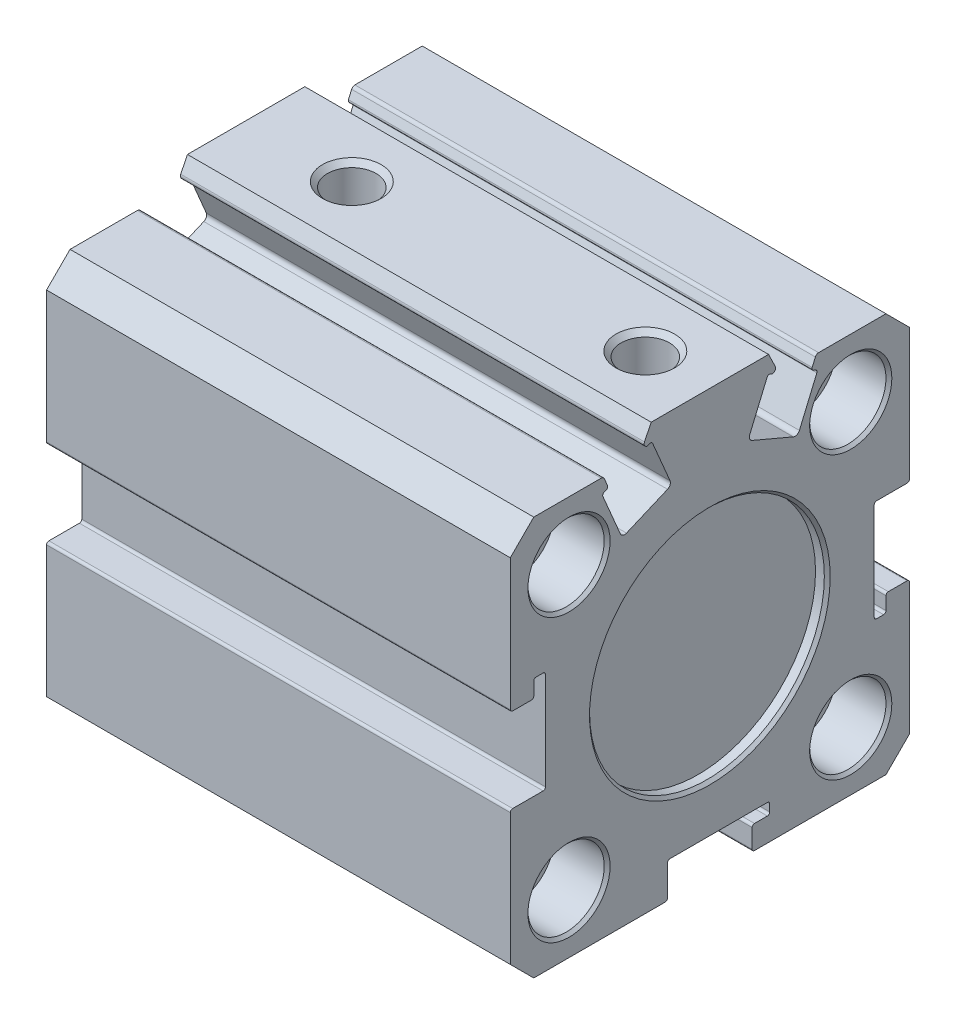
ISO-10303-21;
HEADER;
FILE_DESCRIPTION(('STEP AP214'),'2;1');
FILE_NAME('part.step','',(''),(''),'','','');
FILE_SCHEMA(('AUTOMOTIVE_DESIGN { 1 0 10303 214 1 1 1 1 }'));
ENDSEC;
DATA;
#1=APPLICATION_CONTEXT('core data for automotive mechanical design processes');
#2=APPLICATION_PROTOCOL_DEFINITION('international standard','automotive_design',2000,#1);
#3=PRODUCT_CONTEXT('',#1,'mechanical');
#4=PRODUCT('Part','Part','',(#3));
#5=PRODUCT_RELATED_PRODUCT_CATEGORY('part','',(#4));
#6=PRODUCT_DEFINITION_FORMATION('','',#4);
#7=PRODUCT_DEFINITION_CONTEXT('part definition',#1,'design');
#8=PRODUCT_DEFINITION('design','',#6,#7);
#9=PRODUCT_DEFINITION_SHAPE('','',#8);
#10=(LENGTH_UNIT() NAMED_UNIT(*) SI_UNIT(.MILLI.,.METRE.));
#11=(NAMED_UNIT(*) PLANE_ANGLE_UNIT() SI_UNIT($,.RADIAN.));
#12=(NAMED_UNIT(*) SI_UNIT($,.STERADIAN.) SOLID_ANGLE_UNIT());
#13=UNCERTAINTY_MEASURE_WITH_UNIT(LENGTH_MEASURE(1.E-05),#10,'distance_accuracy_value','');
#14=(GEOMETRIC_REPRESENTATION_CONTEXT(3) GLOBAL_UNCERTAINTY_ASSIGNED_CONTEXT((#13)) GLOBAL_UNIT_ASSIGNED_CONTEXT((#10,
#11,#12)) REPRESENTATION_CONTEXT('',''));
#15=CARTESIAN_POINT('',(0.,0.,0.));
#16=DIRECTION('',(0.,0.,1.));
#17=DIRECTION('',(1.,0.,0.));
#18=AXIS2_PLACEMENT_3D('',#15,#16,#17);
#19=CARTESIAN_POINT('',(25.5,-9.9,12.));
#20=DIRECTION('',(1.,0.,0.));
#21=DIRECTION('',(0.,0.,-1.));
#22=AXIS2_PLACEMENT_3D('',#19,#20,#21);
#23=PLANE('',#22);
#24=CARTESIAN_POINT('',(25.5000000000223,-12.,12.));
#25=DIRECTION('',(-1.,0.,0.));
#26=DIRECTION('',(0.,0.,1.));
#27=AXIS2_PLACEMENT_3D('',#24,#25,#26);
#28=CIRCLE('',#27,2.49999999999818);
#29=CARTESIAN_POINT('',(25.5000000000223,-12.,14.4999999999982));
#30=VERTEX_POINT('',#29);
#31=EDGE_CURVE('E950',#30,#30,#28,.F.);
#32=ORIENTED_EDGE('',*,*,#31,.T.);
#33=EDGE_LOOP('',(#32));
#34=FACE_BOUND('',#33,.T.);
#35=CARTESIAN_POINT('',(25.5,-12.,12.));
#36=DIRECTION('',(-1.,0.,0.));
#37=DIRECTION('',(0.,0.,1.));
#38=AXIS2_PLACEMENT_3D('',#35,#36,#37);
#39=CIRCLE('',#38,2.1);
#40=CARTESIAN_POINT('',(25.5,-12.,14.1));
#41=VERTEX_POINT('',#40);
#42=EDGE_CURVE('E959',#41,#41,#39,.T.);
#43=ORIENTED_EDGE('',*,*,#42,.T.);
#44=EDGE_LOOP('',(#43));
#45=FACE_BOUND('',#44,.T.);
#46=ADVANCED_FACE('F17',(#34,#45),#23,.T.);
#47=CARTESIAN_POINT('',(25.5,-9.9,-12.));
#48=DIRECTION('',(1.,0.,0.));
#49=DIRECTION('',(0.,0.,-1.));
#50=AXIS2_PLACEMENT_3D('',#47,#48,#49);
#51=PLANE('',#50);
#52=CARTESIAN_POINT('',(25.5000000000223,-12.,-12.));
#53=DIRECTION('',(-1.,0.,0.));
#54=DIRECTION('',(0.,-1.,0.));
#55=AXIS2_PLACEMENT_3D('',#52,#53,#54);
#56=CIRCLE('',#55,2.49999999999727);
#57=CARTESIAN_POINT('',(25.5000000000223,-14.4999999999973,-12.));
#58=VERTEX_POINT('',#57);
#59=EDGE_CURVE('E947',#58,#58,#56,.F.);
#60=ORIENTED_EDGE('',*,*,#59,.T.);
#61=EDGE_LOOP('',(#60));
#62=FACE_BOUND('',#61,.T.);
#63=CARTESIAN_POINT('',(25.5,-12.,-12.));
#64=DIRECTION('',(-1.,0.,0.));
#65=DIRECTION('',(0.,0.,1.));
#66=AXIS2_PLACEMENT_3D('',#63,#64,#65);
#67=CIRCLE('',#66,2.1);
#68=CARTESIAN_POINT('',(25.5,-12.,-9.9));
#69=VERTEX_POINT('',#68);
#70=EDGE_CURVE('E962',#69,#69,#67,.T.);
#71=ORIENTED_EDGE('',*,*,#70,.T.);
#72=EDGE_LOOP('',(#71));
#73=FACE_BOUND('',#72,.T.);
#74=ADVANCED_FACE('F3275',(#62,#73),#51,.T.);
#75=CARTESIAN_POINT('',(25.5,14.1,12.));
#76=DIRECTION('',(1.,0.,0.));
#77=DIRECTION('',(0.,0.,-1.));
#78=AXIS2_PLACEMENT_3D('',#75,#76,#77);
#79=PLANE('',#78);
#80=CARTESIAN_POINT('',(25.5000000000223,12.,12.));
#81=DIRECTION('',(-1.,0.,0.));
#82=DIRECTION('',(0.,0.,1.));
#83=AXIS2_PLACEMENT_3D('',#80,#81,#82);
#84=CIRCLE('',#83,2.49999999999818);
#85=CARTESIAN_POINT('',(25.5000000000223,12.,14.4999999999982));
#86=VERTEX_POINT('',#85);
#87=EDGE_CURVE('E953',#86,#86,#84,.F.);
#88=ORIENTED_EDGE('',*,*,#87,.T.);
#89=EDGE_LOOP('',(#88));
#90=FACE_BOUND('',#89,.T.);
#91=CARTESIAN_POINT('',(25.5,12.,12.));
#92=DIRECTION('',(-1.,0.,0.));
#93=DIRECTION('',(0.,0.,1.));
#94=AXIS2_PLACEMENT_3D('',#91,#92,#93);
#95=CIRCLE('',#94,2.1);
#96=CARTESIAN_POINT('',(25.5,12.,14.1));
#97=VERTEX_POINT('',#96);
#98=EDGE_CURVE('E944',#97,#97,#95,.T.);
#99=ORIENTED_EDGE('',*,*,#98,.T.);
#100=EDGE_LOOP('',(#99));
#101=FACE_BOUND('',#100,.T.);
#102=ADVANCED_FACE('F3266',(#90,#101),#79,.T.);
#103=CARTESIAN_POINT('',(25.5,14.1,-12.));
#104=DIRECTION('',(1.,0.,0.));
#105=DIRECTION('',(0.,0.,-1.));
#106=AXIS2_PLACEMENT_3D('',#103,#104,#105);
#107=PLANE('',#106);
#108=CARTESIAN_POINT('',(25.5000000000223,12.,-12.));
#109=DIRECTION('',(-1.,0.,0.));
#110=DIRECTION('',(0.,-1.,0.));
#111=AXIS2_PLACEMENT_3D('',#108,#109,#110);
#112=CIRCLE('',#111,2.49999999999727);
#113=CARTESIAN_POINT('',(25.5000000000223,9.50000000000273,-12.));
#114=VERTEX_POINT('',#113);
#115=EDGE_CURVE('E956',#114,#114,#112,.F.);
#116=ORIENTED_EDGE('',*,*,#115,.T.);
#117=EDGE_LOOP('',(#116));
#118=FACE_BOUND('',#117,.T.);
#119=CARTESIAN_POINT('',(25.5,12.,-12.));
#120=DIRECTION('',(-1.,0.,0.));
#121=DIRECTION('',(0.,0.,1.));
#122=AXIS2_PLACEMENT_3D('',#119,#120,#121);
#123=CIRCLE('',#122,2.1);
#124=CARTESIAN_POINT('',(25.5,12.,-9.9));
#125=VERTEX_POINT('',#124);
#126=EDGE_CURVE('E941',#125,#125,#123,.T.);
#127=ORIENTED_EDGE('',*,*,#126,.T.);
#128=EDGE_LOOP('',(#127));
#129=FACE_BOUND('',#128,.T.);
#130=ADVANCED_FACE('F3257',(#118,#129),#107,.T.);
#131=CARTESIAN_POINT('',(19.75,-12.,-12.));
#132=DIRECTION('',(-1.,0.,0.));
#133=DIRECTION('',(0.,0.,1.));
#134=AXIS2_PLACEMENT_3D('',#131,#132,#133);
#135=CYLINDRICAL_SURFACE('',#134,2.1);
#136=CARTESIAN_POINT('',(14.,-12.,-12.));
#137=DIRECTION('',(-1.,0.,0.));
#138=DIRECTION('',(0.,0.,1.));
#139=AXIS2_PLACEMENT_3D('',#136,#137,#138);
#140=CIRCLE('',#139,2.1);
#141=CARTESIAN_POINT('',(14.,-12.,-9.9));
#142=VERTEX_POINT('',#141);
#143=EDGE_CURVE('E938',#142,#142,#140,.F.);
#144=ORIENTED_EDGE('',*,*,#143,.F.);
#145=EDGE_LOOP('',(#144));
#146=FACE_BOUND('',#145,.T.);
#147=ORIENTED_EDGE('',*,*,#70,.F.);
#148=EDGE_LOOP('',(#147));
#149=FACE_BOUND('',#148,.T.);
#150=ADVANCED_FACE('F3248',(#146,#149),#135,.F.);
#151=CARTESIAN_POINT('',(19.75,-12.,12.));
#152=DIRECTION('',(-1.,0.,0.));
#153=DIRECTION('',(0.,0.,1.));
#154=AXIS2_PLACEMENT_3D('',#151,#152,#153);
#155=CYLINDRICAL_SURFACE('',#154,2.1);
#156=CARTESIAN_POINT('',(14.,-12.,12.));
#157=DIRECTION('',(-1.,0.,0.));
#158=DIRECTION('',(0.,0.,1.));
#159=AXIS2_PLACEMENT_3D('',#156,#157,#158);
#160=CIRCLE('',#159,2.1);
#161=CARTESIAN_POINT('',(14.,-12.,14.1));
#162=VERTEX_POINT('',#161);
#163=EDGE_CURVE('E597',#162,#162,#160,.F.);
#164=ORIENTED_EDGE('',*,*,#163,.F.);
#165=EDGE_LOOP('',(#164));
#166=FACE_BOUND('',#165,.T.);
#167=ORIENTED_EDGE('',*,*,#42,.F.);
#168=EDGE_LOOP('',(#167));
#169=FACE_BOUND('',#168,.T.);
#170=ADVANCED_FACE('F3239',(#166,#169),#155,.F.);
#171=CARTESIAN_POINT('',(25.4999999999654,12.,-12.));
#172=DIRECTION('',(-1.,0.,0.));
#173=DIRECTION('',(0.,-1.,0.));
#174=AXIS2_PLACEMENT_3D('',#171,#172,#173);
#175=CONICAL_SURFACE('',#174,2.50000000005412,0.785398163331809);
#176=CARTESIAN_POINT('',(25.933,12.,-12.));
#177=DIRECTION('',(-1.,0.,0.));
#178=DIRECTION('',(0.,0.,1.));
#179=AXIS2_PLACEMENT_3D('',#176,#177,#178);
#180=CIRCLE('',#179,2.067);
#181=CARTESIAN_POINT('',(25.933,12.,-9.933));
#182=VERTEX_POINT('',#181);
#183=EDGE_CURVE('E595',#182,#182,#180,.F.);
#184=ORIENTED_EDGE('',*,*,#183,.T.);
#185=EDGE_LOOP('',(#184));
#186=FACE_BOUND('',#185,.T.);
#187=ORIENTED_EDGE('',*,*,#115,.F.);
#188=EDGE_LOOP('',(#187));
#189=FACE_BOUND('',#188,.T.);
#190=ADVANCED_FACE('F3230',(#186,#189),#175,.F.);
#191=CARTESIAN_POINT('',(25.5000000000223,12.,12.));
#192=DIRECTION('',(-1.,0.,0.));
#193=DIRECTION('',(0.,0.,1.));
#194=AXIS2_PLACEMENT_3D('',#191,#192,#193);
#195=CONICAL_SURFACE('',#194,2.49999999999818,0.785398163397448);
#196=CARTESIAN_POINT('',(25.933,12.,12.));
#197=DIRECTION('',(-1.,0.,0.));
#198=DIRECTION('',(0.,0.,1.));
#199=AXIS2_PLACEMENT_3D('',#196,#197,#198);
#200=CIRCLE('',#199,2.067);
#201=CARTESIAN_POINT('',(25.933,12.,14.067));
#202=VERTEX_POINT('',#201);
#203=EDGE_CURVE('E592',#202,#202,#200,.F.);
#204=ORIENTED_EDGE('',*,*,#203,.T.);
#205=EDGE_LOOP('',(#204));
#206=FACE_BOUND('',#205,.T.);
#207=ORIENTED_EDGE('',*,*,#87,.F.);
#208=EDGE_LOOP('',(#207));
#209=FACE_BOUND('',#208,.T.);
#210=ADVANCED_FACE('F3221',(#206,#209),#195,.F.);
#211=CARTESIAN_POINT('',(25.5000000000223,-12.,12.));
#212=DIRECTION('',(-1.,0.,0.));
#213=DIRECTION('',(0.,0.,1.));
#214=AXIS2_PLACEMENT_3D('',#211,#212,#213);
#215=CONICAL_SURFACE('',#214,2.49999999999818,0.785398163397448);
#216=CARTESIAN_POINT('',(25.933,-12.,12.));
#217=DIRECTION('',(-1.,0.,0.));
#218=DIRECTION('',(0.,0.,1.));
#219=AXIS2_PLACEMENT_3D('',#216,#217,#218);
#220=CIRCLE('',#219,2.067);
#221=CARTESIAN_POINT('',(25.933,-12.,14.067));
#222=VERTEX_POINT('',#221);
#223=EDGE_CURVE('E589',#222,#222,#220,.F.);
#224=ORIENTED_EDGE('',*,*,#223,.T.);
#225=EDGE_LOOP('',(#224));
#226=FACE_BOUND('',#225,.T.);
#227=ORIENTED_EDGE('',*,*,#31,.F.);
#228=EDGE_LOOP('',(#227));
#229=FACE_BOUND('',#228,.T.);
#230=ADVANCED_FACE('F3212',(#226,#229),#215,.F.);
#231=CARTESIAN_POINT('',(25.4999999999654,-12.,-12.));
#232=DIRECTION('',(-1.,0.,0.));
#233=DIRECTION('',(0.,-1.,0.));
#234=AXIS2_PLACEMENT_3D('',#231,#232,#233);
#235=CONICAL_SURFACE('',#234,2.50000000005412,0.785398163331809);
#236=CARTESIAN_POINT('',(25.933,-12.,-12.));
#237=DIRECTION('',(-1.,0.,0.));
#238=DIRECTION('',(0.,0.,1.));
#239=AXIS2_PLACEMENT_3D('',#236,#237,#238);
#240=CIRCLE('',#239,2.067);
#241=CARTESIAN_POINT('',(25.933,-12.,-9.933));
#242=VERTEX_POINT('',#241);
#243=EDGE_CURVE('E585',#242,#242,#240,.F.);
#244=ORIENTED_EDGE('',*,*,#243,.T.);
#245=EDGE_LOOP('',(#244));
#246=FACE_BOUND('',#245,.T.);
#247=ORIENTED_EDGE('',*,*,#59,.F.);
#248=EDGE_LOOP('',(#247));
#249=FACE_BOUND('',#248,.T.);
#250=ADVANCED_FACE('F3203',(#246,#249),#235,.F.);
#251=CARTESIAN_POINT('',(19.75,12.,12.));
#252=DIRECTION('',(-1.,0.,0.));
#253=DIRECTION('',(0.,0.,1.));
#254=AXIS2_PLACEMENT_3D('',#251,#252,#253);
#255=CYLINDRICAL_SURFACE('',#254,2.1);
#256=CARTESIAN_POINT('',(14.,12.,12.));
#257=DIRECTION('',(-1.,0.,0.));
#258=DIRECTION('',(0.,0.,1.));
#259=AXIS2_PLACEMENT_3D('',#256,#257,#258);
#260=CIRCLE('',#259,2.1);
#261=CARTESIAN_POINT('',(14.,12.,14.1));
#262=VERTEX_POINT('',#261);
#263=EDGE_CURVE('E588',#262,#262,#260,.F.);
#264=ORIENTED_EDGE('',*,*,#263,.F.);
#265=EDGE_LOOP('',(#264));
#266=FACE_BOUND('',#265,.T.);
#267=ORIENTED_EDGE('',*,*,#98,.F.);
#268=EDGE_LOOP('',(#267));
#269=FACE_BOUND('',#268,.T.);
#270=ADVANCED_FACE('F3194',(#266,#269),#255,.F.);
#271=CARTESIAN_POINT('',(19.75,12.,-12.));
#272=DIRECTION('',(-1.,0.,0.));
#273=DIRECTION('',(0.,0.,1.));
#274=AXIS2_PLACEMENT_3D('',#271,#272,#273);
#275=CYLINDRICAL_SURFACE('',#274,2.1);
#276=CARTESIAN_POINT('',(14.,12.,-12.));
#277=DIRECTION('',(-1.,0.,0.));
#278=DIRECTION('',(0.,0.,1.));
#279=AXIS2_PLACEMENT_3D('',#276,#277,#278);
#280=CIRCLE('',#279,2.1);
#281=CARTESIAN_POINT('',(14.,12.,-9.9));
#282=VERTEX_POINT('',#281);
#283=EDGE_CURVE('E931',#282,#282,#280,.F.);
#284=ORIENTED_EDGE('',*,*,#283,.F.);
#285=EDGE_LOOP('',(#284));
#286=FACE_BOUND('',#285,.T.);
#287=ORIENTED_EDGE('',*,*,#126,.F.);
#288=EDGE_LOOP('',(#287));
#289=FACE_BOUND('',#288,.T.);
#290=ADVANCED_FACE('F3185',(#286,#289),#275,.F.);
#291=CARTESIAN_POINT('',(14.,-9.5,-12.));
#292=DIRECTION('',(-1.,0.,0.));
#293=DIRECTION('',(0.,0.,1.));
#294=AXIS2_PLACEMENT_3D('',#291,#292,#293);
#295=PLANE('',#294);
#296=ORIENTED_EDGE('',*,*,#143,.T.);
#297=EDGE_LOOP('',(#296));
#298=FACE_BOUND('',#297,.T.);
#299=CARTESIAN_POINT('',(13.9999999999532,-12.,-12.));
#300=DIRECTION('',(1.,0.,0.));
#301=DIRECTION('',(0.,1.,0.));
#302=AXIS2_PLACEMENT_3D('',#299,#300,#301);
#303=CIRCLE('',#302,2.49999999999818);
#304=CARTESIAN_POINT('',(13.9999999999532,-9.50000000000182,-12.));
#305=VERTEX_POINT('',#304);
#306=EDGE_CURVE('E928',#305,#305,#303,.F.);
#307=ORIENTED_EDGE('',*,*,#306,.T.);
#308=EDGE_LOOP('',(#307));
#309=FACE_BOUND('',#308,.T.);
#310=ADVANCED_FACE('F3176',(#298,#309),#295,.T.);
#311=CARTESIAN_POINT('',(14.,-9.5,12.));
#312=DIRECTION('',(-1.,0.,0.));
#313=DIRECTION('',(0.,0.,1.));
#314=AXIS2_PLACEMENT_3D('',#311,#312,#313);
#315=PLANE('',#314);
#316=ORIENTED_EDGE('',*,*,#163,.T.);
#317=EDGE_LOOP('',(#316));
#318=FACE_BOUND('',#317,.T.);
#319=CARTESIAN_POINT('',(13.9999999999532,-12.,12.));
#320=DIRECTION('',(1.,0.,0.));
#321=DIRECTION('',(0.,1.,0.));
#322=AXIS2_PLACEMENT_3D('',#319,#320,#321);
#323=CIRCLE('',#322,2.49999999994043);
#324=CARTESIAN_POINT('',(13.9999999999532,-9.50000000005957,12.));
#325=VERTEX_POINT('',#324);
#326=EDGE_CURVE('E584',#325,#325,#323,.F.);
#327=ORIENTED_EDGE('',*,*,#326,.T.);
#328=EDGE_LOOP('',(#327));
#329=FACE_BOUND('',#328,.T.);
#330=ADVANCED_FACE('F3166',(#318,#329),#315,.T.);
#331=CARTESIAN_POINT('',(39.5,12.,-12.));
#332=DIRECTION('',(-1.,0.,0.));
#333=DIRECTION('',(0.,0.,1.));
#334=AXIS2_PLACEMENT_3D('',#331,#332,#333);
#335=CYLINDRICAL_SURFACE('',#334,2.067);
#336=CARTESIAN_POINT('',(34.5670000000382,12.,-12.));
#337=DIRECTION('',(1.,0.,0.));
#338=DIRECTION('',(0.,0.,-1.));
#339=AXIS2_PLACEMENT_3D('',#336,#337,#338);
#340=CIRCLE('',#339,2.06700000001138);
#341=CARTESIAN_POINT('',(34.5670000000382,12.,-14.0670000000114));
#342=VERTEX_POINT('',#341);
#343=EDGE_CURVE('E581',#342,#342,#340,.T.);
#344=ORIENTED_EDGE('',*,*,#343,.T.);
#345=EDGE_LOOP('',(#344));
#346=FACE_BOUND('',#345,.T.);
#347=ORIENTED_EDGE('',*,*,#183,.F.);
#348=EDGE_LOOP('',(#347));
#349=FACE_BOUND('',#348,.T.);
#350=ADVANCED_FACE('F3156',(#346,#349),#335,.F.);
#351=CARTESIAN_POINT('',(39.5,12.,12.));
#352=DIRECTION('',(-1.,0.,0.));
#353=DIRECTION('',(0.,0.,1.));
#354=AXIS2_PLACEMENT_3D('',#351,#352,#353);
#355=CYLINDRICAL_SURFACE('',#354,2.067);
#356=CARTESIAN_POINT('',(34.5670000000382,12.,12.));
#357=DIRECTION('',(1.,0.,0.));
#358=DIRECTION('',(0.,0.,-1.));
#359=AXIS2_PLACEMENT_3D('',#356,#357,#358);
#360=CIRCLE('',#359,2.06700000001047);
#361=CARTESIAN_POINT('',(34.5670000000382,12.,9.93299999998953));
#362=VERTEX_POINT('',#361);
#363=EDGE_CURVE('E578',#362,#362,#360,.T.);
#364=ORIENTED_EDGE('',*,*,#363,.T.);
#365=EDGE_LOOP('',(#364));
#366=FACE_BOUND('',#365,.T.);
#367=ORIENTED_EDGE('',*,*,#203,.F.);
#368=EDGE_LOOP('',(#367));
#369=FACE_BOUND('',#368,.T.);
#370=ADVANCED_FACE('F3146',(#366,#369),#355,.F.);
#371=CARTESIAN_POINT('',(39.5,-12.,12.));
#372=DIRECTION('',(-1.,0.,0.));
#373=DIRECTION('',(0.,0.,1.));
#374=AXIS2_PLACEMENT_3D('',#371,#372,#373);
#375=CYLINDRICAL_SURFACE('',#374,2.067);
#376=CARTESIAN_POINT('',(34.5670000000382,-12.,12.));
#377=DIRECTION('',(1.,0.,0.));
#378=DIRECTION('',(0.,0.,-1.));
#379=AXIS2_PLACEMENT_3D('',#376,#377,#378);
#380=CIRCLE('',#379,2.06700000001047);
#381=CARTESIAN_POINT('',(34.5670000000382,-12.,9.93299999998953));
#382=VERTEX_POINT('',#381);
#383=EDGE_CURVE('E575',#382,#382,#380,.T.);
#384=ORIENTED_EDGE('',*,*,#383,.T.);
#385=EDGE_LOOP('',(#384));
#386=FACE_BOUND('',#385,.T.);
#387=ORIENTED_EDGE('',*,*,#223,.F.);
#388=EDGE_LOOP('',(#387));
#389=FACE_BOUND('',#388,.T.);
#390=ADVANCED_FACE('F3137',(#386,#389),#375,.F.);
#391=CARTESIAN_POINT('',(39.5,-12.,-12.));
#392=DIRECTION('',(-1.,0.,0.));
#393=DIRECTION('',(0.,0.,1.));
#394=AXIS2_PLACEMENT_3D('',#391,#392,#393);
#395=CYLINDRICAL_SURFACE('',#394,2.067);
#396=CARTESIAN_POINT('',(34.5670000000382,-12.,-12.));
#397=DIRECTION('',(1.,0.,0.));
#398=DIRECTION('',(0.,0.,-1.));
#399=AXIS2_PLACEMENT_3D('',#396,#397,#398);
#400=CIRCLE('',#399,2.06700000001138);
#401=CARTESIAN_POINT('',(34.5670000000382,-12.,-14.0670000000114));
#402=VERTEX_POINT('',#401);
#403=EDGE_CURVE('E571',#402,#402,#400,.T.);
#404=ORIENTED_EDGE('',*,*,#403,.T.);
#405=EDGE_LOOP('',(#404));
#406=FACE_BOUND('',#405,.T.);
#407=ORIENTED_EDGE('',*,*,#243,.F.);
#408=EDGE_LOOP('',(#407));
#409=FACE_BOUND('',#408,.T.);
#410=ADVANCED_FACE('F3128',(#406,#409),#395,.F.);
#411=CARTESIAN_POINT('',(14.,14.5,12.));
#412=DIRECTION('',(-1.,0.,0.));
#413=DIRECTION('',(0.,0.,1.));
#414=AXIS2_PLACEMENT_3D('',#411,#412,#413);
#415=PLANE('',#414);
#416=ORIENTED_EDGE('',*,*,#263,.T.);
#417=EDGE_LOOP('',(#416));
#418=FACE_BOUND('',#417,.T.);
#419=CARTESIAN_POINT('',(13.9999999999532,12.,12.));
#420=DIRECTION('',(1.,0.,0.));
#421=DIRECTION('',(0.,1.,0.));
#422=AXIS2_PLACEMENT_3D('',#419,#420,#421);
#423=CIRCLE('',#422,2.49999999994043);
#424=CARTESIAN_POINT('',(13.9999999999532,14.4999999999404,12.));
#425=VERTEX_POINT('',#424);
#426=EDGE_CURVE('E574',#425,#425,#423,.F.);
#427=ORIENTED_EDGE('',*,*,#426,.T.);
#428=EDGE_LOOP('',(#427));
#429=FACE_BOUND('',#428,.T.);
#430=ADVANCED_FACE('F3119',(#418,#429),#415,.T.);
#431=CARTESIAN_POINT('',(14.,14.5,-12.));
#432=DIRECTION('',(-1.,0.,0.));
#433=DIRECTION('',(0.,0.,1.));
#434=AXIS2_PLACEMENT_3D('',#431,#432,#433);
#435=PLANE('',#434);
#436=ORIENTED_EDGE('',*,*,#283,.T.);
#437=EDGE_LOOP('',(#436));
#438=FACE_BOUND('',#437,.T.);
#439=CARTESIAN_POINT('',(13.9999999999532,12.,-12.));
#440=DIRECTION('',(1.,0.,0.));
#441=DIRECTION('',(0.,1.,0.));
#442=AXIS2_PLACEMENT_3D('',#439,#440,#441);
#443=CIRCLE('',#442,2.49999999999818);
#444=CARTESIAN_POINT('',(13.9999999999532,14.4999999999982,-12.));
#445=VERTEX_POINT('',#444);
#446=EDGE_CURVE('E570',#445,#445,#443,.F.);
#447=ORIENTED_EDGE('',*,*,#446,.T.);
#448=EDGE_LOOP('',(#447));
#449=FACE_BOUND('',#448,.T.);
#450=ADVANCED_FACE('F3110',(#438,#449),#435,.T.);
#451=CARTESIAN_POINT('',(13.9999999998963,-12.,-12.));
#452=DIRECTION('',(1.,0.,0.));
#453=DIRECTION('',(0.,1.,0.));
#454=AXIS2_PLACEMENT_3D('',#451,#452,#453);
#455=CONICAL_SURFACE('',#454,2.49999999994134,0.785398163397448);
#456=ORIENTED_EDGE('',*,*,#306,.F.);
#457=EDGE_LOOP('',(#456));
#458=FACE_BOUND('',#457,.T.);
#459=CARTESIAN_POINT('',(13.567,-12.,-12.));
#460=DIRECTION('',(-1.,0.,0.));
#461=DIRECTION('',(0.,0.,1.));
#462=AXIS2_PLACEMENT_3D('',#459,#460,#461);
#463=CIRCLE('',#462,2.067);
#464=CARTESIAN_POINT('',(13.567,-12.,-9.933));
#465=VERTEX_POINT('',#464);
#466=EDGE_CURVE('E567',#465,#465,#463,.T.);
#467=ORIENTED_EDGE('',*,*,#466,.T.);
#468=EDGE_LOOP('',(#467));
#469=FACE_BOUND('',#468,.T.);
#470=ADVANCED_FACE('F3101',(#458,#469),#455,.F.);
#471=CARTESIAN_POINT('',(13.9999999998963,-12.,12.));
#472=DIRECTION('',(1.,0.,0.));
#473=DIRECTION('',(0.,1.,0.));
#474=AXIS2_PLACEMENT_3D('',#471,#472,#473);
#475=CONICAL_SURFACE('',#474,2.49999999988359,0.785398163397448);
#476=ORIENTED_EDGE('',*,*,#326,.F.);
#477=EDGE_LOOP('',(#476));
#478=FACE_BOUND('',#477,.T.);
#479=CARTESIAN_POINT('',(13.567,-12.,12.));
#480=DIRECTION('',(-1.,0.,0.));
#481=DIRECTION('',(0.,0.,1.));
#482=AXIS2_PLACEMENT_3D('',#479,#480,#481);
#483=CIRCLE('',#482,2.067);
#484=CARTESIAN_POINT('',(13.567,-12.,14.067));
#485=VERTEX_POINT('',#484);
#486=EDGE_CURVE('E563',#485,#485,#483,.T.);
#487=ORIENTED_EDGE('',*,*,#486,.T.);
#488=EDGE_LOOP('',(#487));
#489=FACE_BOUND('',#488,.T.);
#490=ADVANCED_FACE('F3092',(#478,#489),#475,.F.);
#491=CARTESIAN_POINT('',(35.0000000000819,12.,-12.));
#492=DIRECTION('',(1.,0.,0.));
#493=DIRECTION('',(0.,0.,-1.));
#494=AXIS2_PLACEMENT_3D('',#491,#492,#493);
#495=CONICAL_SURFACE('',#494,2.49999999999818,0.785398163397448);
#496=ORIENTED_EDGE('',*,*,#343,.F.);
#497=EDGE_LOOP('',(#496));
#498=FACE_BOUND('',#497,.T.);
#499=CARTESIAN_POINT('',(35.0000000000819,12.,-12.));
#500=DIRECTION('',(1.,0.,0.));
#501=DIRECTION('',(0.,0.,-1.));
#502=AXIS2_PLACEMENT_3D('',#499,#500,#501);
#503=CIRCLE('',#502,2.49999999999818);
#504=CARTESIAN_POINT('',(35.0000000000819,12.,-14.4999999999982));
#505=VERTEX_POINT('',#504);
#506=EDGE_CURVE('E918',#505,#505,#503,.F.);
#507=ORIENTED_EDGE('',*,*,#506,.F.);
#508=EDGE_LOOP('',(#507));
#509=FACE_BOUND('',#508,.T.);
#510=ADVANCED_FACE('F3083',(#498,#509),#495,.F.);
#511=CARTESIAN_POINT('',(35.0000000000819,12.,12.));
#512=DIRECTION('',(1.,0.,0.));
#513=DIRECTION('',(0.,0.,-1.));
#514=AXIS2_PLACEMENT_3D('',#511,#512,#513);
#515=CONICAL_SURFACE('',#514,2.49999999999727,0.785398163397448);
#516=ORIENTED_EDGE('',*,*,#363,.F.);
#517=EDGE_LOOP('',(#516));
#518=FACE_BOUND('',#517,.T.);
#519=CARTESIAN_POINT('',(35.0000000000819,12.,12.));
#520=DIRECTION('',(1.,0.,0.));
#521=DIRECTION('',(0.,0.,-1.));
#522=AXIS2_PLACEMENT_3D('',#519,#520,#521);
#523=CIRCLE('',#522,2.49999999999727);
#524=CARTESIAN_POINT('',(35.0000000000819,12.,9.50000000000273));
#525=VERTEX_POINT('',#524);
#526=EDGE_CURVE('E915',#525,#525,#523,.F.);
#527=ORIENTED_EDGE('',*,*,#526,.F.);
#528=EDGE_LOOP('',(#527));
#529=FACE_BOUND('',#528,.T.);
#530=ADVANCED_FACE('F3074',(#518,#529),#515,.F.);
#531=CARTESIAN_POINT('',(35.0000000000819,-12.,12.));
#532=DIRECTION('',(1.,0.,0.));
#533=DIRECTION('',(0.,0.,-1.));
#534=AXIS2_PLACEMENT_3D('',#531,#532,#533);
#535=CONICAL_SURFACE('',#534,2.49999999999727,0.785398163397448);
#536=ORIENTED_EDGE('',*,*,#383,.F.);
#537=EDGE_LOOP('',(#536));
#538=FACE_BOUND('',#537,.T.);
#539=CARTESIAN_POINT('',(35.0000000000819,-12.,12.));
#540=DIRECTION('',(1.,0.,0.));
#541=DIRECTION('',(0.,0.,-1.));
#542=AXIS2_PLACEMENT_3D('',#539,#540,#541);
#543=CIRCLE('',#542,2.49999999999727);
#544=CARTESIAN_POINT('',(35.0000000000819,-12.,9.50000000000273));
#545=VERTEX_POINT('',#544);
#546=EDGE_CURVE('E912',#545,#545,#543,.F.);
#547=ORIENTED_EDGE('',*,*,#546,.F.);
#548=EDGE_LOOP('',(#547));
#549=FACE_BOUND('',#548,.T.);
#550=ADVANCED_FACE('F3065',(#538,#549),#535,.F.);
#551=CARTESIAN_POINT('',(35.0000000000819,-12.,-12.));
#552=DIRECTION('',(1.,0.,0.));
#553=DIRECTION('',(0.,0.,-1.));
#554=AXIS2_PLACEMENT_3D('',#551,#552,#553);
#555=CONICAL_SURFACE('',#554,2.49999999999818,0.785398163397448);
#556=ORIENTED_EDGE('',*,*,#403,.F.);
#557=EDGE_LOOP('',(#556));
#558=FACE_BOUND('',#557,.T.);
#559=CARTESIAN_POINT('',(35.0000000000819,-12.,-12.));
#560=DIRECTION('',(1.,0.,0.));
#561=DIRECTION('',(0.,0.,-1.));
#562=AXIS2_PLACEMENT_3D('',#559,#560,#561);
#563=CIRCLE('',#562,2.49999999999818);
#564=CARTESIAN_POINT('',(35.0000000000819,-12.,-14.4999999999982));
#565=VERTEX_POINT('',#564);
#566=EDGE_CURVE('E532',#565,#565,#563,.F.);
#567=ORIENTED_EDGE('',*,*,#566,.F.);
#568=EDGE_LOOP('',(#567));
#569=FACE_BOUND('',#568,.T.);
#570=ADVANCED_FACE('F3056',(#558,#569),#555,.F.);
#571=CARTESIAN_POINT('',(13.9999999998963,12.,12.));
#572=DIRECTION('',(1.,0.,0.));
#573=DIRECTION('',(0.,1.,0.));
#574=AXIS2_PLACEMENT_3D('',#571,#572,#573);
#575=CONICAL_SURFACE('',#574,2.49999999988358,0.785398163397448);
#576=ORIENTED_EDGE('',*,*,#426,.F.);
#577=EDGE_LOOP('',(#576));
#578=FACE_BOUND('',#577,.T.);
#579=CARTESIAN_POINT('',(13.567,12.,12.));
#580=DIRECTION('',(-1.,0.,0.));
#581=DIRECTION('',(0.,0.,1.));
#582=AXIS2_PLACEMENT_3D('',#579,#580,#581);
#583=CIRCLE('',#582,2.067);
#584=CARTESIAN_POINT('',(13.567,12.,14.067));
#585=VERTEX_POINT('',#584);
#586=EDGE_CURVE('E560',#585,#585,#583,.T.);
#587=ORIENTED_EDGE('',*,*,#586,.T.);
#588=EDGE_LOOP('',(#587));
#589=FACE_BOUND('',#588,.T.);
#590=ADVANCED_FACE('F3047',(#578,#589),#575,.F.);
#591=CARTESIAN_POINT('',(13.9999999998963,12.,-12.));
#592=DIRECTION('',(1.,0.,0.));
#593=DIRECTION('',(0.,1.,0.));
#594=AXIS2_PLACEMENT_3D('',#591,#592,#593);
#595=CONICAL_SURFACE('',#594,2.49999999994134,0.785398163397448);
#596=ORIENTED_EDGE('',*,*,#446,.F.);
#597=EDGE_LOOP('',(#596));
#598=FACE_BOUND('',#597,.T.);
#599=CARTESIAN_POINT('',(13.567,12.,-12.));
#600=DIRECTION('',(-1.,0.,0.));
#601=DIRECTION('',(0.,0.,1.));
#602=AXIS2_PLACEMENT_3D('',#599,#600,#601);
#603=CIRCLE('',#602,2.067);
#604=CARTESIAN_POINT('',(13.567,12.,-9.933));
#605=VERTEX_POINT('',#604);
#606=EDGE_CURVE('E557',#605,#605,#603,.T.);
#607=ORIENTED_EDGE('',*,*,#606,.T.);
#608=EDGE_LOOP('',(#607));
#609=FACE_BOUND('',#608,.T.);
#610=ADVANCED_FACE('F3036',(#598,#609),#595,.F.);
#611=CARTESIAN_POINT('',(19.75,-12.,-12.));
#612=DIRECTION('',(-1.,0.,0.));
#613=DIRECTION('',(0.,0.,1.));
#614=AXIS2_PLACEMENT_3D('',#611,#612,#613);
#615=CYLINDRICAL_SURFACE('',#614,2.067);
#616=CARTESIAN_POINT('',(4.93299999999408,-12.,-12.));
#617=DIRECTION('',(-1.,0.,0.));
#618=DIRECTION('',(0.,0.,1.));
#619=AXIS2_PLACEMENT_3D('',#616,#617,#618);
#620=CIRCLE('',#619,2.06700000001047);
#621=CARTESIAN_POINT('',(4.93299999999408,-12.,-9.93299999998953));
#622=VERTEX_POINT('',#621);
#623=EDGE_CURVE('E549',#622,#622,#620,.T.);
#624=ORIENTED_EDGE('',*,*,#623,.T.);
#625=EDGE_LOOP('',(#624));
#626=FACE_BOUND('',#625,.T.);
#627=ORIENTED_EDGE('',*,*,#466,.F.);
#628=EDGE_LOOP('',(#627));
#629=FACE_BOUND('',#628,.T.);
#630=ADVANCED_FACE('F3027',(#626,#629),#615,.F.);
#631=CARTESIAN_POINT('',(19.75,-12.,12.));
#632=DIRECTION('',(-1.,0.,0.));
#633=DIRECTION('',(0.,0.,1.));
#634=AXIS2_PLACEMENT_3D('',#631,#632,#633);
#635=CYLINDRICAL_SURFACE('',#634,2.067);
#636=CARTESIAN_POINT('',(4.93299999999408,-12.,12.));
#637=DIRECTION('',(-1.,0.,0.));
#638=DIRECTION('',(0.,0.,1.));
#639=AXIS2_PLACEMENT_3D('',#636,#637,#638);
#640=CIRCLE('',#639,2.06700000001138);
#641=CARTESIAN_POINT('',(4.93299999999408,-12.,14.0670000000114));
#642=VERTEX_POINT('',#641);
#643=EDGE_CURVE('E546',#642,#642,#640,.T.);
#644=ORIENTED_EDGE('',*,*,#643,.T.);
#645=EDGE_LOOP('',(#644));
#646=FACE_BOUND('',#645,.T.);
#647=ORIENTED_EDGE('',*,*,#486,.F.);
#648=EDGE_LOOP('',(#647));
#649=FACE_BOUND('',#648,.T.);
#650=ADVANCED_FACE('F3019',(#646,#649),#635,.F.);
#651=CARTESIAN_POINT('',(39.5,-15.,-4.9));
#652=DIRECTION('',(0.,-1.,0.));
#653=DIRECTION('',(0.,0.,-1.));
#654=AXIS2_PLACEMENT_3D('',#651,#652,#653);
#655=PLANE('',#654);
#656=DIRECTION('',(-1.,0.,0.));
#657=VECTOR('',#656,1.);
#658=CARTESIAN_POINT('',(39.5,-15.,-3.8));
#659=LINE('',#658,#657);
#660=CARTESIAN_POINT('',(39.5,-15.,-3.8));
#661=VERTEX_POINT('',#660);
#662=CARTESIAN_POINT('',(0.,-15.,-3.8));
#663=VERTEX_POINT('',#662);
#664=EDGE_CURVE('E899',#661,#663,#659,.T.);
#665=ORIENTED_EDGE('',*,*,#664,.F.);
#666=DIRECTION('',(0.,0.,-1.));
#667=VECTOR('',#666,1.);
#668=CARTESIAN_POINT('',(39.5,-15.,-4.9));
#669=LINE('',#668,#667);
#670=CARTESIAN_POINT('',(39.5,-15.,-4.9));
#671=VERTEX_POINT('',#670);
#672=EDGE_CURVE('E566',#671,#661,#669,.F.);
#673=ORIENTED_EDGE('',*,*,#672,.F.);
#674=DIRECTION('',(-1.,0.,0.));
#675=VECTOR('',#674,1.);
#676=CARTESIAN_POINT('',(39.5,-15.,-4.9));
#677=LINE('',#676,#675);
#678=CARTESIAN_POINT('',(0.,-15.,-4.9));
#679=VERTEX_POINT('',#678);
#680=EDGE_CURVE('E552',#671,#679,#677,.T.);
#681=ORIENTED_EDGE('',*,*,#680,.T.);
#682=DIRECTION('',(0.,0.,-1.));
#683=VECTOR('',#682,1.);
#684=CARTESIAN_POINT('',(0.,-15.,-4.9));
#685=LINE('',#684,#683);
#686=EDGE_CURVE('E1502',#663,#679,#685,.T.);
#687=ORIENTED_EDGE('',*,*,#686,.F.);
#688=EDGE_LOOP('',(#665,#673,#681,#687));
#689=FACE_BOUND('',#688,.T.);
#690=ADVANCED_FACE('F1522',(#689),#655,.F.);
#691=CARTESIAN_POINT('',(39.5,-3.8,-15.));
#692=DIRECTION('',(0.,0.,-1.));
#693=DIRECTION('',(-1.,0.,0.));
#694=AXIS2_PLACEMENT_3D('',#691,#692,#693);
#695=PLANE('',#694);
#696=DIRECTION('',(-1.,0.,0.));
#697=VECTOR('',#696,1.);
#698=CARTESIAN_POINT('',(39.5,-4.9,-15.));
#699=LINE('',#698,#697);
#700=CARTESIAN_POINT('',(0.,-4.9,-15.));
#701=VERTEX_POINT('',#700);
#702=CARTESIAN_POINT('',(39.5,-4.9,-15.));
#703=VERTEX_POINT('',#702);
#704=EDGE_CURVE('E893',#701,#703,#699,.F.);
#705=ORIENTED_EDGE('',*,*,#704,.T.);
#706=DIRECTION('',(0.,1.,0.));
#707=VECTOR('',#706,1.);
#708=CARTESIAN_POINT('',(39.5,-3.8,-15.));
#709=LINE('',#708,#707);
#710=CARTESIAN_POINT('',(39.5,-3.80000000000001,-15.));
#711=VERTEX_POINT('',#710);
#712=EDGE_CURVE('E1500',#711,#703,#709,.F.);
#713=ORIENTED_EDGE('',*,*,#712,.F.);
#714=DIRECTION('',(-1.,0.,0.));
#715=VECTOR('',#714,1.);
#716=CARTESIAN_POINT('',(39.5,-3.80000000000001,-15.));
#717=LINE('',#716,#715);
#718=CARTESIAN_POINT('',(0.,-3.80000000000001,-15.));
#719=VERTEX_POINT('',#718);
#720=EDGE_CURVE('E896',#719,#711,#717,.F.);
#721=ORIENTED_EDGE('',*,*,#720,.F.);
#722=DIRECTION('',(0.,1.,0.));
#723=VECTOR('',#722,1.);
#724=CARTESIAN_POINT('',(0.,-3.8,-15.));
#725=LINE('',#724,#723);
#726=EDGE_CURVE('E921',#701,#719,#725,.T.);
#727=ORIENTED_EDGE('',*,*,#726,.F.);
#728=EDGE_LOOP('',(#705,#713,#721,#727));
#729=FACE_BOUND('',#728,.T.);
#730=ADVANCED_FACE('F1761',(#729),#695,.F.);
#731=CARTESIAN_POINT('',(35.,14.5,-12.));
#732=DIRECTION('',(1.,0.,0.));
#733=DIRECTION('',(0.,0.,-1.));
#734=AXIS2_PLACEMENT_3D('',#731,#732,#733);
#735=PLANE('',#734);
#736=CARTESIAN_POINT('',(35.,12.,-12.));
#737=DIRECTION('',(-1.,0.,0.));
#738=DIRECTION('',(0.,0.,1.));
#739=AXIS2_PLACEMENT_3D('',#736,#737,#738);
#740=CIRCLE('',#739,3.25);
#741=CARTESIAN_POINT('',(35.,12.,-8.75));
#742=VERTEX_POINT('',#741);
#743=EDGE_CURVE('E874',#742,#742,#740,.F.);
#744=ORIENTED_EDGE('',*,*,#743,.T.);
#745=EDGE_LOOP('',(#744));
#746=FACE_BOUND('',#745,.T.);
#747=ORIENTED_EDGE('',*,*,#506,.T.);
#748=EDGE_LOOP('',(#747));
#749=FACE_BOUND('',#748,.T.);
#750=ADVANCED_FACE('F2995',(#746,#749),#735,.T.);
#751=CARTESIAN_POINT('',(35.,14.5,12.));
#752=DIRECTION('',(1.,0.,0.));
#753=DIRECTION('',(0.,0.,-1.));
#754=AXIS2_PLACEMENT_3D('',#751,#752,#753);
#755=PLANE('',#754);
#756=CARTESIAN_POINT('',(35.,12.,12.));
#757=DIRECTION('',(-1.,0.,0.));
#758=DIRECTION('',(0.,0.,1.));
#759=AXIS2_PLACEMENT_3D('',#756,#757,#758);
#760=CIRCLE('',#759,3.25);
#761=CARTESIAN_POINT('',(35.,12.,15.25));
#762=VERTEX_POINT('',#761);
#763=EDGE_CURVE('E871',#762,#762,#760,.F.);
#764=ORIENTED_EDGE('',*,*,#763,.T.);
#765=EDGE_LOOP('',(#764));
#766=FACE_BOUND('',#765,.T.);
#767=ORIENTED_EDGE('',*,*,#526,.T.);
#768=EDGE_LOOP('',(#767));
#769=FACE_BOUND('',#768,.T.);
#770=ADVANCED_FACE('F2986',(#766,#769),#755,.T.);
#771=CARTESIAN_POINT('',(35.,-9.5,12.));
#772=DIRECTION('',(1.,0.,0.));
#773=DIRECTION('',(0.,0.,-1.));
#774=AXIS2_PLACEMENT_3D('',#771,#772,#773);
#775=PLANE('',#774);
#776=CARTESIAN_POINT('',(35.,-12.,12.));
#777=DIRECTION('',(-1.,0.,0.));
#778=DIRECTION('',(0.,0.,1.));
#779=AXIS2_PLACEMENT_3D('',#776,#777,#778);
#780=CIRCLE('',#779,3.25);
#781=CARTESIAN_POINT('',(35.,-12.,15.25));
#782=VERTEX_POINT('',#781);
#783=EDGE_CURVE('E868',#782,#782,#780,.F.);
#784=ORIENTED_EDGE('',*,*,#783,.T.);
#785=EDGE_LOOP('',(#784));
#786=FACE_BOUND('',#785,.T.);
#787=ORIENTED_EDGE('',*,*,#546,.T.);
#788=EDGE_LOOP('',(#787));
#789=FACE_BOUND('',#788,.T.);
#790=ADVANCED_FACE('F2977',(#786,#789),#775,.T.);
#791=CARTESIAN_POINT('',(35.,-9.5,-12.));
#792=DIRECTION('',(1.,0.,0.));
#793=DIRECTION('',(0.,0.,-1.));
#794=AXIS2_PLACEMENT_3D('',#791,#792,#793);
#795=PLANE('',#794);
#796=CARTESIAN_POINT('',(35.,-12.,-12.));
#797=DIRECTION('',(-1.,0.,0.));
#798=DIRECTION('',(0.,0.,1.));
#799=AXIS2_PLACEMENT_3D('',#796,#797,#798);
#800=CIRCLE('',#799,3.25);
#801=CARTESIAN_POINT('',(35.,-12.,-8.75));
#802=VERTEX_POINT('',#801);
#803=EDGE_CURVE('E865',#802,#802,#800,.F.);
#804=ORIENTED_EDGE('',*,*,#803,.T.);
#805=EDGE_LOOP('',(#804));
#806=FACE_BOUND('',#805,.T.);
#807=ORIENTED_EDGE('',*,*,#566,.T.);
#808=EDGE_LOOP('',(#807));
#809=FACE_BOUND('',#808,.T.);
#810=ADVANCED_FACE('F2968',(#806,#809),#795,.T.);
#811=CARTESIAN_POINT('',(38.5,0.,0.));
#812=DIRECTION('',(1.,0.,0.));
#813=DIRECTION('',(0.,0.,-1.));
#814=AXIS2_PLACEMENT_3D('',#811,#812,#813);
#815=PLANE('',#814);
#816=CARTESIAN_POINT('',(38.5,0.,0.));
#817=DIRECTION('',(-1.,0.,0.));
#818=DIRECTION('',(0.,0.,1.));
#819=AXIS2_PLACEMENT_3D('',#816,#817,#818);
#820=CIRCLE('',#819,10.);
#821=CARTESIAN_POINT('',(38.5,0.,10.));
#822=VERTEX_POINT('',#821);
#823=EDGE_CURVE('E862',#822,#822,#820,.F.);
#824=ORIENTED_EDGE('',*,*,#823,.T.);
#825=EDGE_LOOP('',(#824));
#826=FACE_BOUND('',#825,.T.);
#827=ADVANCED_FACE('F2960',(#826),#815,.T.);
#828=CARTESIAN_POINT('',(39.5,3.79999999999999,15.));
#829=DIRECTION('',(0.,0.,1.));
#830=DIRECTION('',(1.,0.,0.));
#831=AXIS2_PLACEMENT_3D('',#828,#829,#830);
#832=PLANE('',#831);
#833=DIRECTION('',(-1.,0.,0.));
#834=VECTOR('',#833,1.);
#835=CARTESIAN_POINT('',(39.5,4.9,15.));
#836=LINE('',#835,#834);
#837=CARTESIAN_POINT('',(0.,4.9,15.));
#838=VERTEX_POINT('',#837);
#839=CARTESIAN_POINT('',(39.5,4.9,15.));
#840=VERTEX_POINT('',#839);
#841=EDGE_CURVE('E538',#838,#840,#836,.F.);
#842=ORIENTED_EDGE('',*,*,#841,.T.);
#843=DIRECTION('',(0.,1.,0.));
#844=VECTOR('',#843,1.);
#845=CARTESIAN_POINT('',(39.5,3.79999999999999,15.));
#846=LINE('',#845,#844);
#847=CARTESIAN_POINT('',(39.5,3.79999999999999,15.));
#848=VERTEX_POINT('',#847);
#849=EDGE_CURVE('E519',#848,#840,#846,.T.);
#850=ORIENTED_EDGE('',*,*,#849,.F.);
#851=DIRECTION('',(-1.,0.,0.));
#852=VECTOR('',#851,1.);
#853=CARTESIAN_POINT('',(39.5,3.79999999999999,15.));
#854=LINE('',#853,#852);
#855=CARTESIAN_POINT('',(0.,3.79999999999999,15.));
#856=VERTEX_POINT('',#855);
#857=EDGE_CURVE('E859',#856,#848,#854,.F.);
#858=ORIENTED_EDGE('',*,*,#857,.F.);
#859=DIRECTION('',(0.,1.,0.));
#860=VECTOR('',#859,1.);
#861=CARTESIAN_POINT('',(0.,3.79999999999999,15.));
#862=LINE('',#861,#860);
#863=EDGE_CURVE('E531',#838,#856,#862,.F.);
#864=ORIENTED_EDGE('',*,*,#863,.F.);
#865=EDGE_LOOP('',(#842,#850,#858,#864));
#866=FACE_BOUND('',#865,.T.);
#867=ADVANCED_FACE('F544',(#866),#832,.F.);
#868=CARTESIAN_POINT('',(19.75,12.,12.));
#869=DIRECTION('',(-1.,0.,0.));
#870=DIRECTION('',(0.,0.,1.));
#871=AXIS2_PLACEMENT_3D('',#868,#869,#870);
#872=CYLINDRICAL_SURFACE('',#871,2.067);
#873=CARTESIAN_POINT('',(4.93299999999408,12.,12.));
#874=DIRECTION('',(-1.,0.,0.));
#875=DIRECTION('',(0.,0.,1.));
#876=AXIS2_PLACEMENT_3D('',#873,#874,#875);
#877=CIRCLE('',#876,2.06700000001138);
#878=CARTESIAN_POINT('',(4.93299999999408,12.,14.0670000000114));
#879=VERTEX_POINT('',#878);
#880=EDGE_CURVE('E858',#879,#879,#877,.T.);
#881=ORIENTED_EDGE('',*,*,#880,.T.);
#882=EDGE_LOOP('',(#881));
#883=FACE_BOUND('',#882,.T.);
#884=ORIENTED_EDGE('',*,*,#586,.F.);
#885=EDGE_LOOP('',(#884));
#886=FACE_BOUND('',#885,.T.);
#887=ADVANCED_FACE('F2941',(#883,#886),#872,.F.);
#888=CARTESIAN_POINT('',(19.75,12.,-12.));
#889=DIRECTION('',(-1.,0.,0.));
#890=DIRECTION('',(0.,0.,1.));
#891=AXIS2_PLACEMENT_3D('',#888,#889,#890);
#892=CYLINDRICAL_SURFACE('',#891,2.067);
#893=CARTESIAN_POINT('',(4.93299999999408,12.,-12.));
#894=DIRECTION('',(-1.,0.,0.));
#895=DIRECTION('',(0.,0.,1.));
#896=AXIS2_PLACEMENT_3D('',#893,#894,#895);
#897=CIRCLE('',#896,2.06700000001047);
#898=CARTESIAN_POINT('',(4.93299999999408,12.,-9.93299999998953));
#899=VERTEX_POINT('',#898);
#900=EDGE_CURVE('E856',#899,#899,#897,.T.);
#901=ORIENTED_EDGE('',*,*,#900,.T.);
#902=EDGE_LOOP('',(#901));
#903=FACE_BOUND('',#902,.T.);
#904=ORIENTED_EDGE('',*,*,#606,.F.);
#905=EDGE_LOOP('',(#904));
#906=FACE_BOUND('',#905,.T.);
#907=ADVANCED_FACE('F2932',(#903,#906),#892,.F.);
#908=CARTESIAN_POINT('',(4.49999999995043,-12.,-12.));
#909=DIRECTION('',(-1.,0.,0.));
#910=DIRECTION('',(0.,0.,1.));
#911=AXIS2_PLACEMENT_3D('',#908,#909,#910);
#912=CONICAL_SURFACE('',#911,2.50000000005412,0.785398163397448);
#913=CARTESIAN_POINT('',(4.50000000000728,-12.,-12.));
#914=DIRECTION('',(-1.,0.,0.));
#915=DIRECTION('',(0.,0.,1.));
#916=AXIS2_PLACEMENT_3D('',#913,#914,#915);
#917=CIRCLE('',#916,2.49999999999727);
#918=CARTESIAN_POINT('',(4.50000000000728,-12.,-9.50000000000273));
#919=VERTEX_POINT('',#918);
#920=EDGE_CURVE('E853',#919,#919,#917,.F.);
#921=ORIENTED_EDGE('',*,*,#920,.F.);
#922=EDGE_LOOP('',(#921));
#923=FACE_BOUND('',#922,.T.);
#924=ORIENTED_EDGE('',*,*,#623,.F.);
#925=EDGE_LOOP('',(#924));
#926=FACE_BOUND('',#925,.T.);
#927=ADVANCED_FACE('F2923',(#923,#926),#912,.F.);
#928=CARTESIAN_POINT('',(4.49999999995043,-12.,12.));
#929=DIRECTION('',(-1.,0.,0.));
#930=DIRECTION('',(0.,0.,1.));
#931=AXIS2_PLACEMENT_3D('',#928,#929,#930);
#932=CONICAL_SURFACE('',#931,2.49999999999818,0.785398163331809);
#933=CARTESIAN_POINT('',(4.49999999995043,-12.,12.));
#934=DIRECTION('',(-1.,0.,0.));
#935=DIRECTION('',(0.,0.,1.));
#936=AXIS2_PLACEMENT_3D('',#933,#934,#935);
#937=CIRCLE('',#936,2.49999999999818);
#938=CARTESIAN_POINT('',(4.49999999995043,-12.,14.4999999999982));
#939=VERTEX_POINT('',#938);
#940=EDGE_CURVE('E850',#939,#939,#937,.F.);
#941=ORIENTED_EDGE('',*,*,#940,.F.);
#942=EDGE_LOOP('',(#941));
#943=FACE_BOUND('',#942,.T.);
#944=ORIENTED_EDGE('',*,*,#643,.F.);
#945=EDGE_LOOP('',(#944));
#946=FACE_BOUND('',#945,.T.);
#947=ADVANCED_FACE('F2915',(#943,#946),#932,.F.);
#948=CARTESIAN_POINT('',(39.5,4.9,14.8));
#949=DIRECTION('',(-1.,0.,0.));
#950=DIRECTION('',(0.,0.,1.));
#951=AXIS2_PLACEMENT_3D('',#948,#949,#950);
#952=CYLINDRICAL_SURFACE('',#951,0.200000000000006);
#953=DIRECTION('',(1.,0.,0.));
#954=VECTOR('',#953,1.);
#955=CARTESIAN_POINT('',(39.5,5.1,14.8));
#956=LINE('',#955,#954);
#957=CARTESIAN_POINT('',(0.,5.1,14.8));
#958=VERTEX_POINT('',#957);
#959=CARTESIAN_POINT('',(39.5,5.1,14.8));
#960=VERTEX_POINT('',#959);
#961=EDGE_CURVE('E541',#958,#960,#956,.T.);
#962=ORIENTED_EDGE('',*,*,#961,.T.);
#963=CARTESIAN_POINT('',(39.5,4.9,14.8));
#964=DIRECTION('',(-1.,0.,0.));
#965=DIRECTION('',(0.,0.,1.));
#966=AXIS2_PLACEMENT_3D('',#963,#964,#965);
#967=CIRCLE('',#966,0.200000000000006);
#968=EDGE_CURVE('E523',#840,#960,#967,.T.);
#969=ORIENTED_EDGE('',*,*,#968,.F.);
#970=ORIENTED_EDGE('',*,*,#841,.F.);
#971=CARTESIAN_POINT('',(0.,4.9,14.8));
#972=DIRECTION('',(-1.,0.,0.));
#973=DIRECTION('',(0.,0.,1.));
#974=AXIS2_PLACEMENT_3D('',#971,#972,#973);
#975=CIRCLE('',#974,0.200000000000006);
#976=EDGE_CURVE('E542',#958,#838,#975,.F.);
#977=ORIENTED_EDGE('',*,*,#976,.F.);
#978=EDGE_LOOP('',(#962,#969,#970,#977));
#979=FACE_BOUND('',#978,.T.);
#980=ADVANCED_FACE('F537',(#979),#952,.F.);
#981=CARTESIAN_POINT('',(39.5,-14.8,-4.9));
#982=DIRECTION('',(-1.,0.,0.));
#983=DIRECTION('',(0.,0.,1.));
#984=AXIS2_PLACEMENT_3D('',#981,#982,#983);
#985=CYLINDRICAL_SURFACE('',#984,0.199999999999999);
#986=ORIENTED_EDGE('',*,*,#680,.F.);
#987=CARTESIAN_POINT('',(39.5,-14.8,-4.9));
#988=DIRECTION('',(-1.,0.,0.));
#989=DIRECTION('',(0.,0.,1.));
#990=AXIS2_PLACEMENT_3D('',#987,#988,#989);
#991=CIRCLE('',#990,0.199999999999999);
#992=CARTESIAN_POINT('',(39.5,-14.8,-5.1));
#993=VERTEX_POINT('',#992);
#994=EDGE_CURVE('E906',#993,#671,#991,.T.);
#995=ORIENTED_EDGE('',*,*,#994,.F.);
#996=DIRECTION('',(-1.,0.,0.));
#997=VECTOR('',#996,1.);
#998=CARTESIAN_POINT('',(39.5,-14.8,-5.1));
#999=LINE('',#998,#997);
#1000=CARTESIAN_POINT('',(0.,-14.8,-5.1));
#1001=VERTEX_POINT('',#1000);
#1002=EDGE_CURVE('E1442',#993,#1001,#999,.T.);
#1003=ORIENTED_EDGE('',*,*,#1002,.T.);
#1004=CARTESIAN_POINT('',(0.,-14.8,-4.9));
#1005=DIRECTION('',(-1.,0.,0.));
#1006=DIRECTION('',(0.,0.,1.));
#1007=AXIS2_PLACEMENT_3D('',#1004,#1005,#1006);
#1008=CIRCLE('',#1007,0.199999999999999);
#1009=EDGE_CURVE('E904',#679,#1001,#1008,.F.);
#1010=ORIENTED_EDGE('',*,*,#1009,.F.);
#1011=EDGE_LOOP('',(#986,#995,#1003,#1010));
#1012=FACE_BOUND('',#1011,.T.);
#1013=ADVANCED_FACE('F1520',(#1012),#985,.F.);
#1014=CARTESIAN_POINT('',(39.5,-15.2,-3.8));
#1015=DIRECTION('',(-1.,0.,0.));
#1016=DIRECTION('',(0.,0.,1.));
#1017=AXIS2_PLACEMENT_3D('',#1014,#1015,#1016);
#1018=CYLINDRICAL_SURFACE('',#1017,0.200000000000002);
#1019=CARTESIAN_POINT('',(39.5,-15.2,-3.8));
#1020=DIRECTION('',(-1.,0.,0.));
#1021=DIRECTION('',(0.,0.,1.));
#1022=AXIS2_PLACEMENT_3D('',#1019,#1020,#1021);
#1023=CIRCLE('',#1022,0.200000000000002);
#1024=CARTESIAN_POINT('',(39.5,-15.2,-3.6));
#1025=VERTEX_POINT('',#1024);
#1026=EDGE_CURVE('E900',#1025,#661,#1023,.T.);
#1027=ORIENTED_EDGE('',*,*,#1026,.T.);
#1028=ORIENTED_EDGE('',*,*,#664,.T.);
#1029=CARTESIAN_POINT('',(0.,-15.2,-3.8));
#1030=DIRECTION('',(-1.,0.,0.));
#1031=DIRECTION('',(0.,0.,1.));
#1032=AXIS2_PLACEMENT_3D('',#1029,#1030,#1031);
#1033=CIRCLE('',#1032,0.200000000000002);
#1034=CARTESIAN_POINT('',(0.,-15.2,-3.6));
#1035=VERTEX_POINT('',#1034);
#1036=EDGE_CURVE('E902',#663,#1035,#1033,.F.);
#1037=ORIENTED_EDGE('',*,*,#1036,.T.);
#1038=DIRECTION('',(-1.,0.,0.));
#1039=VECTOR('',#1038,1.);
#1040=CARTESIAN_POINT('',(39.5,-15.2,-3.6));
#1041=LINE('',#1040,#1039);
#1042=EDGE_CURVE('E1436',#1035,#1025,#1041,.F.);
#1043=ORIENTED_EDGE('',*,*,#1042,.T.);
#1044=EDGE_LOOP('',(#1027,#1028,#1037,#1043));
#1045=FACE_BOUND('',#1044,.T.);
#1046=ADVANCED_FACE('F1793',(#1045),#1018,.T.);
#1047=CARTESIAN_POINT('',(39.5,-3.80000000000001,-15.2));
#1048=DIRECTION('',(-1.,0.,0.));
#1049=DIRECTION('',(0.,0.,1.));
#1050=AXIS2_PLACEMENT_3D('',#1047,#1048,#1049);
#1051=CYLINDRICAL_SURFACE('',#1050,0.200000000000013);
#1052=CARTESIAN_POINT('',(39.5,-3.80000000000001,-15.2));
#1053=DIRECTION('',(-1.,0.,0.));
#1054=DIRECTION('',(0.,0.,1.));
#1055=AXIS2_PLACEMENT_3D('',#1052,#1053,#1054);
#1056=CIRCLE('',#1055,0.200000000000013);
#1057=CARTESIAN_POINT('',(39.5,-3.6,-15.2));
#1058=VERTEX_POINT('',#1057);
#1059=EDGE_CURVE('E894',#711,#1058,#1056,.T.);
#1060=ORIENTED_EDGE('',*,*,#1059,.T.);
#1061=DIRECTION('',(1.,0.,0.));
#1062=VECTOR('',#1061,1.);
#1063=CARTESIAN_POINT('',(39.5,-3.6,-15.2));
#1064=LINE('',#1063,#1062);
#1065=CARTESIAN_POINT('',(0.,-3.6,-15.2));
#1066=VERTEX_POINT('',#1065);
#1067=EDGE_CURVE('E1429',#1058,#1066,#1064,.F.);
#1068=ORIENTED_EDGE('',*,*,#1067,.T.);
#1069=CARTESIAN_POINT('',(0.,-3.80000000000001,-15.2));
#1070=DIRECTION('',(-1.,0.,0.));
#1071=DIRECTION('',(0.,0.,1.));
#1072=AXIS2_PLACEMENT_3D('',#1069,#1070,#1071);
#1073=CIRCLE('',#1072,0.200000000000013);
#1074=EDGE_CURVE('E897',#1066,#719,#1073,.F.);
#1075=ORIENTED_EDGE('',*,*,#1074,.T.);
#1076=ORIENTED_EDGE('',*,*,#720,.T.);
#1077=EDGE_LOOP('',(#1060,#1068,#1075,#1076));
#1078=FACE_BOUND('',#1077,.T.);
#1079=ADVANCED_FACE('F1764',(#1078),#1051,.T.);
#1080=CARTESIAN_POINT('',(39.5,-4.89999999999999,-14.8));
#1081=DIRECTION('',(-1.,0.,0.));
#1082=DIRECTION('',(0.,0.,1.));
#1083=AXIS2_PLACEMENT_3D('',#1080,#1081,#1082);
#1084=CYLINDRICAL_SURFACE('',#1083,0.200000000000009);
#1085=DIRECTION('',(1.,0.,0.));
#1086=VECTOR('',#1085,1.);
#1087=CARTESIAN_POINT('',(39.5,-5.1,-14.8));
#1088=LINE('',#1087,#1086);
#1089=CARTESIAN_POINT('',(0.,-5.1,-14.8));
#1090=VERTEX_POINT('',#1089);
#1091=CARTESIAN_POINT('',(39.5,-5.1,-14.8));
#1092=VERTEX_POINT('',#1091);
#1093=EDGE_CURVE('E1425',#1090,#1092,#1088,.T.);
#1094=ORIENTED_EDGE('',*,*,#1093,.T.);
#1095=CARTESIAN_POINT('',(39.5,-4.89999999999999,-14.8));
#1096=DIRECTION('',(-1.,0.,0.));
#1097=DIRECTION('',(0.,0.,1.));
#1098=AXIS2_PLACEMENT_3D('',#1095,#1096,#1097);
#1099=CIRCLE('',#1098,0.200000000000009);
#1100=EDGE_CURVE('E891',#703,#1092,#1099,.T.);
#1101=ORIENTED_EDGE('',*,*,#1100,.F.);
#1102=ORIENTED_EDGE('',*,*,#704,.F.);
#1103=CARTESIAN_POINT('',(0.,-4.89999999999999,-14.8));
#1104=DIRECTION('',(-1.,0.,0.));
#1105=DIRECTION('',(0.,0.,1.));
#1106=AXIS2_PLACEMENT_3D('',#1103,#1104,#1105);
#1107=CIRCLE('',#1106,0.200000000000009);
#1108=EDGE_CURVE('E888',#1090,#701,#1107,.F.);
#1109=ORIENTED_EDGE('',*,*,#1108,.F.);
#1110=EDGE_LOOP('',(#1094,#1101,#1102,#1109));
#1111=FACE_BOUND('',#1110,.T.);
#1112=ADVANCED_FACE('F1758',(#1111),#1084,.F.);
#1113=CARTESIAN_POINT('',(39.5,16.10284967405,-8.89933887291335));
#1114=DIRECTION('',(-1.,0.,0.));
#1115=DIRECTION('',(0.,0.,1.));
#1116=AXIS2_PLACEMENT_3D('',#1113,#1114,#1115);
#1117=CYLINDRICAL_SURFACE('',#1116,0.200000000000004);
#1118=CARTESIAN_POINT('',(0.,16.10284967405,-8.89933887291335));
#1119=DIRECTION('',(-1.,0.,0.));
#1120=DIRECTION('',(0.,0.,1.));
#1121=AXIS2_PLACEMENT_3D('',#1118,#1119,#1120);
#1122=CIRCLE('',#1121,0.200000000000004);
#1123=CARTESIAN_POINT('',(0.,16.1809958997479,-8.71523790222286));
#1124=VERTEX_POINT('',#1123);
#1125=CARTESIAN_POINT('',(0.,15.9187487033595,-8.8211926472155));
#1126=VERTEX_POINT('',#1125);
#1127=EDGE_CURVE('E883',#1124,#1126,#1122,.F.);
#1128=ORIENTED_EDGE('',*,*,#1127,.T.);
#1129=DIRECTION('',(1.,0.,0.));
#1130=VECTOR('',#1129,1.);
#1131=CARTESIAN_POINT('',(39.5,15.9187487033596,-8.82119264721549));
#1132=LINE('',#1131,#1130);
#1133=CARTESIAN_POINT('',(39.5,15.9187487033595,-8.8211926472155));
#1134=VERTEX_POINT('',#1133);
#1135=EDGE_CURVE('E1412',#1126,#1134,#1132,.T.);
#1136=ORIENTED_EDGE('',*,*,#1135,.T.);
#1137=CARTESIAN_POINT('',(39.5,16.10284967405,-8.89933887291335));
#1138=DIRECTION('',(-1.,0.,0.));
#1139=DIRECTION('',(0.,0.,1.));
#1140=AXIS2_PLACEMENT_3D('',#1137,#1138,#1139);
#1141=CIRCLE('',#1140,0.200000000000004);
#1142=CARTESIAN_POINT('',(39.5,16.1809958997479,-8.71523790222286));
#1143=VERTEX_POINT('',#1142);
#1144=EDGE_CURVE('E886',#1134,#1143,#1141,.T.);
#1145=ORIENTED_EDGE('',*,*,#1144,.T.);
#1146=DIRECTION('',(1.,0.,0.));
#1147=VECTOR('',#1146,1.);
#1148=CARTESIAN_POINT('',(39.5,16.1809958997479,-8.71523790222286));
#1149=LINE('',#1148,#1147);
#1150=EDGE_CURVE('E1416',#1143,#1124,#1149,.F.);
#1151=ORIENTED_EDGE('',*,*,#1150,.T.);
#1152=EDGE_LOOP('',(#1128,#1136,#1145,#1151));
#1153=FACE_BOUND('',#1152,.T.);
#1154=ADVANCED_FACE('F1716',(#1153),#1117,.T.);
#1155=CARTESIAN_POINT('',(11.067,14.,0.));
#1156=DIRECTION('',(0.,1.,0.));
#1157=DIRECTION('',(0.,0.,1.));
#1158=AXIS2_PLACEMENT_3D('',#1155,#1156,#1157);
#1159=PLANE('',#1158);
#1160=CARTESIAN_POINT('',(9.,14.,0.));
#1161=DIRECTION('',(0.,1.,0.));
#1162=DIRECTION('',(0.,0.,1.));
#1163=AXIS2_PLACEMENT_3D('',#1160,#1161,#1162);
#1164=CIRCLE('',#1163,2.067);
#1165=CARTESIAN_POINT('',(9.,14.,2.067));
#1166=VERTEX_POINT('',#1165);
#1167=EDGE_CURVE('E846',#1166,#1166,#1164,.T.);
#1168=ORIENTED_EDGE('',*,*,#1167,.T.);
#1169=EDGE_LOOP('',(#1168));
#1170=FACE_BOUND('',#1169,.T.);
#1171=ADVANCED_FACE('F2161',(#1170),#1159,.T.);
#1172=CARTESIAN_POINT('',(36.067,14.,0.));
#1173=DIRECTION('',(0.,1.,0.));
#1174=DIRECTION('',(0.,0.,1.));
#1175=AXIS2_PLACEMENT_3D('',#1172,#1173,#1174);
#1176=PLANE('',#1175);
#1177=CARTESIAN_POINT('',(34.,14.,0.));
#1178=DIRECTION('',(0.,1.,0.));
#1179=DIRECTION('',(0.,0.,1.));
#1180=AXIS2_PLACEMENT_3D('',#1177,#1178,#1179);
#1181=CIRCLE('',#1180,2.067);
#1182=CARTESIAN_POINT('',(34.,14.,2.067));
#1183=VERTEX_POINT('',#1182);
#1184=EDGE_CURVE('E833',#1183,#1183,#1181,.T.);
#1185=ORIENTED_EDGE('',*,*,#1184,.T.);
#1186=EDGE_LOOP('',(#1185));
#1187=FACE_BOUND('',#1186,.T.);
#1188=ADVANCED_FACE('F2158',(#1187),#1176,.T.);
#1189=CARTESIAN_POINT('',(39.5,15.8406024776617,9.00529361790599));
#1190=DIRECTION('',(0.,0.920504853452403,0.390731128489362));
#1191=DIRECTION('',(0.,-0.390731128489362,0.920504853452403));
#1192=AXIS2_PLACEMENT_3D('',#1189,#1190,#1191);
#1193=PLANE('',#1192);
#1194=DIRECTION('',(-1.,0.,0.));
#1195=VECTOR('',#1194,1.);
#1196=CARTESIAN_POINT('',(39.5,15.9187487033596,8.82119264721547));
#1197=LINE('',#1196,#1195);
#1198=CARTESIAN_POINT('',(39.5,15.9187487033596,8.82119264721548));
#1199=VERTEX_POINT('',#1198);
#1200=CARTESIAN_POINT('',(0.,15.9187487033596,8.82119264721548));
#1201=VERTEX_POINT('',#1200);
#1202=EDGE_CURVE('E877',#1199,#1201,#1197,.T.);
#1203=ORIENTED_EDGE('',*,*,#1202,.F.);
#1204=DIRECTION('',(0.,-0.390731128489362,0.920504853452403));
#1205=VECTOR('',#1204,1.);
#1206=CARTESIAN_POINT('',(39.5,15.8406024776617,9.00529361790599));
#1207=LINE('',#1206,#1205);
#1208=CARTESIAN_POINT('',(39.5,15.8406024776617,9.005293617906));
#1209=VERTEX_POINT('',#1208);
#1210=EDGE_CURVE('E885',#1209,#1199,#1207,.F.);
#1211=ORIENTED_EDGE('',*,*,#1210,.F.);
#1212=DIRECTION('',(-1.,0.,0.));
#1213=VECTOR('',#1212,1.);
#1214=CARTESIAN_POINT('',(39.5,15.8406024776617,9.00529361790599));
#1215=LINE('',#1214,#1213);
#1216=CARTESIAN_POINT('',(0.,15.8406024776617,9.005293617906));
#1217=VERTEX_POINT('',#1216);
#1218=EDGE_CURVE('E1385',#1209,#1217,#1215,.T.);
#1219=ORIENTED_EDGE('',*,*,#1218,.T.);
#1220=DIRECTION('',(0.,-0.390731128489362,0.920504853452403));
#1221=VECTOR('',#1220,1.);
#1222=CARTESIAN_POINT('',(0.,15.8406024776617,9.00529361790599));
#1223=LINE('',#1222,#1221);
#1224=EDGE_CURVE('E882',#1201,#1217,#1223,.T.);
#1225=ORIENTED_EDGE('',*,*,#1224,.F.);
#1226=EDGE_LOOP('',(#1203,#1211,#1219,#1225));
#1227=FACE_BOUND('',#1226,.T.);
#1228=ADVANCED_FACE('F1621',(#1227),#1193,.F.);
#1229=CARTESIAN_POINT('',(39.5,16.1028496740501,8.89933887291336));
#1230=DIRECTION('',(-1.,0.,0.));
#1231=DIRECTION('',(0.,0.,1.));
#1232=AXIS2_PLACEMENT_3D('',#1229,#1230,#1231);
#1233=CYLINDRICAL_SURFACE('',#1232,0.200000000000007);
#1234=CARTESIAN_POINT('',(39.5,16.1028496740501,8.89933887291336));
#1235=DIRECTION('',(-1.,0.,0.));
#1236=DIRECTION('',(0.,0.,1.));
#1237=AXIS2_PLACEMENT_3D('',#1234,#1235,#1236);
#1238=CIRCLE('',#1237,0.200000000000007);
#1239=CARTESIAN_POINT('',(39.5,16.1809958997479,8.71523790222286));
#1240=VERTEX_POINT('',#1239);
#1241=EDGE_CURVE('E878',#1240,#1199,#1238,.T.);
#1242=ORIENTED_EDGE('',*,*,#1241,.T.);
#1243=ORIENTED_EDGE('',*,*,#1202,.T.);
#1244=CARTESIAN_POINT('',(0.,16.1028496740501,8.89933887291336));
#1245=DIRECTION('',(-1.,0.,0.));
#1246=DIRECTION('',(0.,0.,1.));
#1247=AXIS2_PLACEMENT_3D('',#1244,#1245,#1246);
#1248=CIRCLE('',#1247,0.200000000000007);
#1249=CARTESIAN_POINT('',(0.,16.1809958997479,8.71523790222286));
#1250=VERTEX_POINT('',#1249);
#1251=EDGE_CURVE('E880',#1201,#1250,#1248,.F.);
#1252=ORIENTED_EDGE('',*,*,#1251,.T.);
#1253=DIRECTION('',(1.,0.,0.));
#1254=VECTOR('',#1253,1.);
#1255=CARTESIAN_POINT('',(39.5,16.1809958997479,8.71523790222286));
#1256=LINE('',#1255,#1254);
#1257=EDGE_CURVE('E1378',#1250,#1240,#1256,.T.);
#1258=ORIENTED_EDGE('',*,*,#1257,.T.);
#1259=EDGE_LOOP('',(#1242,#1243,#1252,#1258));
#1260=FACE_BOUND('',#1259,.T.);
#1261=ADVANCED_FACE('F1615',(#1260),#1233,.T.);
#1262=CARTESIAN_POINT('',(39.5,12.,-12.));
#1263=DIRECTION('',(-1.,0.,0.));
#1264=DIRECTION('',(0.,0.,1.));
#1265=AXIS2_PLACEMENT_3D('',#1262,#1263,#1264);
#1266=CYLINDRICAL_SURFACE('',#1265,3.25);
#1267=CARTESIAN_POINT('',(39.2500000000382,12.,-12.));
#1268=DIRECTION('',(1.,0.,0.));
#1269=DIRECTION('',(0.,0.,-1.));
#1270=AXIS2_PLACEMENT_3D('',#1267,#1268,#1269);
#1271=CIRCLE('',#1270,3.25000000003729);
#1272=CARTESIAN_POINT('',(39.2500000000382,12.,-15.2500000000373));
#1273=VERTEX_POINT('',#1272);
#1274=EDGE_CURVE('E1381',#1273,#1273,#1271,.T.);
#1275=ORIENTED_EDGE('',*,*,#1274,.T.);
#1276=EDGE_LOOP('',(#1275));
#1277=FACE_BOUND('',#1276,.T.);
#1278=ORIENTED_EDGE('',*,*,#743,.F.);
#1279=EDGE_LOOP('',(#1278));
#1280=FACE_BOUND('',#1279,.T.);
#1281=ADVANCED_FACE('F2149',(#1277,#1280),#1266,.F.);
#1282=CARTESIAN_POINT('',(39.5,12.,12.));
#1283=DIRECTION('',(-1.,0.,0.));
#1284=DIRECTION('',(0.,0.,1.));
#1285=AXIS2_PLACEMENT_3D('',#1282,#1283,#1284);
#1286=CYLINDRICAL_SURFACE('',#1285,3.25);
#1287=CARTESIAN_POINT('',(39.2500000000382,12.,12.));
#1288=DIRECTION('',(1.,0.,0.));
#1289=DIRECTION('',(0.,0.,-1.));
#1290=AXIS2_PLACEMENT_3D('',#1287,#1288,#1289);
#1291=CIRCLE('',#1290,3.25000000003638);
#1292=CARTESIAN_POINT('',(39.2500000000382,12.,8.74999999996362));
#1293=VERTEX_POINT('',#1292);
#1294=EDGE_CURVE('E1458',#1293,#1293,#1291,.T.);
#1295=ORIENTED_EDGE('',*,*,#1294,.T.);
#1296=EDGE_LOOP('',(#1295));
#1297=FACE_BOUND('',#1296,.T.);
#1298=ORIENTED_EDGE('',*,*,#763,.F.);
#1299=EDGE_LOOP('',(#1298));
#1300=FACE_BOUND('',#1299,.T.);
#1301=ADVANCED_FACE('F2145',(#1297,#1300),#1286,.F.);
#1302=CARTESIAN_POINT('',(39.5,-12.,12.));
#1303=DIRECTION('',(-1.,0.,0.));
#1304=DIRECTION('',(0.,0.,1.));
#1305=AXIS2_PLACEMENT_3D('',#1302,#1303,#1304);
#1306=CYLINDRICAL_SURFACE('',#1305,3.25);
#1307=CARTESIAN_POINT('',(39.2500000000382,-12.,12.));
#1308=DIRECTION('',(1.,0.,0.));
#1309=DIRECTION('',(0.,0.,-1.));
#1310=AXIS2_PLACEMENT_3D('',#1307,#1308,#1309);
#1311=CIRCLE('',#1310,3.25000000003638);
#1312=CARTESIAN_POINT('',(39.2500000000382,-12.,8.74999999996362));
#1313=VERTEX_POINT('',#1312);
#1314=EDGE_CURVE('E1455',#1313,#1313,#1311,.T.);
#1315=ORIENTED_EDGE('',*,*,#1314,.T.);
#1316=EDGE_LOOP('',(#1315));
#1317=FACE_BOUND('',#1316,.T.);
#1318=ORIENTED_EDGE('',*,*,#783,.F.);
#1319=EDGE_LOOP('',(#1318));
#1320=FACE_BOUND('',#1319,.T.);
#1321=ADVANCED_FACE('F2141',(#1317,#1320),#1306,.F.);
#1322=CARTESIAN_POINT('',(39.5,-12.,-12.));
#1323=DIRECTION('',(-1.,0.,0.));
#1324=DIRECTION('',(0.,0.,1.));
#1325=AXIS2_PLACEMENT_3D('',#1322,#1323,#1324);
#1326=CYLINDRICAL_SURFACE('',#1325,3.25);
#1327=CARTESIAN_POINT('',(39.2500000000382,-12.,-12.));
#1328=DIRECTION('',(1.,0.,0.));
#1329=DIRECTION('',(0.,0.,-1.));
#1330=AXIS2_PLACEMENT_3D('',#1327,#1328,#1329);
#1331=CIRCLE('',#1330,3.25000000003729);
#1332=CARTESIAN_POINT('',(39.2500000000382,-12.,-15.2500000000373));
#1333=VERTEX_POINT('',#1332);
#1334=EDGE_CURVE('E1452',#1333,#1333,#1331,.T.);
#1335=ORIENTED_EDGE('',*,*,#1334,.T.);
#1336=EDGE_LOOP('',(#1335));
#1337=FACE_BOUND('',#1336,.T.);
#1338=ORIENTED_EDGE('',*,*,#803,.F.);
#1339=EDGE_LOOP('',(#1338));
#1340=FACE_BOUND('',#1339,.T.);
#1341=ADVANCED_FACE('F2137',(#1337,#1340),#1326,.F.);
#1342=CARTESIAN_POINT('',(39.5,0.,0.));
#1343=DIRECTION('',(-1.,0.,0.));
#1344=DIRECTION('',(0.,0.,1.));
#1345=AXIS2_PLACEMENT_3D('',#1342,#1343,#1344);
#1346=CYLINDRICAL_SURFACE('',#1345,10.);
#1347=CARTESIAN_POINT('',(39.25,0.,0.));
#1348=DIRECTION('',(1.,0.,0.));
#1349=DIRECTION('',(0.,0.,-1.));
#1350=AXIS2_PLACEMENT_3D('',#1347,#1348,#1349);
#1351=CIRCLE('',#1350,10.);
#1352=CARTESIAN_POINT('',(39.25,0.,-10.));
#1353=VERTEX_POINT('',#1352);
#1354=EDGE_CURVE('E1374',#1353,#1353,#1351,.T.);
#1355=ORIENTED_EDGE('',*,*,#1354,.T.);
#1356=EDGE_LOOP('',(#1355));
#1357=FACE_BOUND('',#1356,.T.);
#1358=ORIENTED_EDGE('',*,*,#823,.F.);
#1359=EDGE_LOOP('',(#1358));
#1360=FACE_BOUND('',#1359,.T.);
#1361=ADVANCED_FACE('F2134',(#1357,#1360),#1346,.F.);
#1362=CARTESIAN_POINT('',(39.5,3.79999999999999,15.2));
#1363=DIRECTION('',(-1.,0.,0.));
#1364=DIRECTION('',(0.,0.,1.));
#1365=AXIS2_PLACEMENT_3D('',#1362,#1363,#1364);
#1366=CYLINDRICAL_SURFACE('',#1365,0.199999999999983);
#1367=CARTESIAN_POINT('',(39.5,3.79999999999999,15.2));
#1368=DIRECTION('',(-1.,0.,0.));
#1369=DIRECTION('',(0.,0.,1.));
#1370=AXIS2_PLACEMENT_3D('',#1367,#1368,#1369);
#1371=CIRCLE('',#1370,0.199999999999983);
#1372=CARTESIAN_POINT('',(39.5,3.6,15.2));
#1373=VERTEX_POINT('',#1372);
#1374=EDGE_CURVE('E526',#848,#1373,#1371,.T.);
#1375=ORIENTED_EDGE('',*,*,#1374,.T.);
#1376=DIRECTION('',(1.,0.,0.));
#1377=VECTOR('',#1376,1.);
#1378=CARTESIAN_POINT('',(39.5,3.6,15.2));
#1379=LINE('',#1378,#1377);
#1380=CARTESIAN_POINT('',(0.,3.6,15.2));
#1381=VERTEX_POINT('',#1380);
#1382=EDGE_CURVE('E1329',#1373,#1381,#1379,.F.);
#1383=ORIENTED_EDGE('',*,*,#1382,.T.);
#1384=CARTESIAN_POINT('',(0.,3.79999999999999,15.2));
#1385=DIRECTION('',(-1.,0.,0.));
#1386=DIRECTION('',(0.,0.,1.));
#1387=AXIS2_PLACEMENT_3D('',#1384,#1385,#1386);
#1388=CIRCLE('',#1387,0.199999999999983);
#1389=EDGE_CURVE('E860',#1381,#856,#1388,.F.);
#1390=ORIENTED_EDGE('',*,*,#1389,.T.);
#1391=ORIENTED_EDGE('',*,*,#857,.T.);
#1392=EDGE_LOOP('',(#1375,#1383,#1390,#1391));
#1393=FACE_BOUND('',#1392,.T.);
#1394=ADVANCED_FACE('F1582',(#1393),#1366,.T.);
#1395=CARTESIAN_POINT('',(4.49999999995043,12.,12.));
#1396=DIRECTION('',(-1.,0.,0.));
#1397=DIRECTION('',(0.,0.,1.));
#1398=AXIS2_PLACEMENT_3D('',#1395,#1396,#1397);
#1399=CONICAL_SURFACE('',#1398,2.49999999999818,0.785398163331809);
#1400=CARTESIAN_POINT('',(4.49999999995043,12.,12.));
#1401=DIRECTION('',(-1.,0.,0.));
#1402=DIRECTION('',(0.,0.,1.));
#1403=AXIS2_PLACEMENT_3D('',#1400,#1401,#1402);
#1404=CIRCLE('',#1403,2.49999999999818);
#1405=CARTESIAN_POINT('',(4.49999999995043,12.,14.4999999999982));
#1406=VERTEX_POINT('',#1405);
#1407=EDGE_CURVE('E829',#1406,#1406,#1404,.F.);
#1408=ORIENTED_EDGE('',*,*,#1407,.F.);
#1409=EDGE_LOOP('',(#1408));
#1410=FACE_BOUND('',#1409,.T.);
#1411=ORIENTED_EDGE('',*,*,#880,.F.);
#1412=EDGE_LOOP('',(#1411));
#1413=FACE_BOUND('',#1412,.T.);
#1414=ADVANCED_FACE('F2127',(#1410,#1413),#1399,.F.);
#1415=CARTESIAN_POINT('',(4.49999999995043,12.,-12.));
#1416=DIRECTION('',(-1.,0.,0.));
#1417=DIRECTION('',(0.,0.,1.));
#1418=AXIS2_PLACEMENT_3D('',#1415,#1416,#1417);
#1419=CONICAL_SURFACE('',#1418,2.50000000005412,0.785398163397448);
#1420=CARTESIAN_POINT('',(4.50000000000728,12.,-12.));
#1421=DIRECTION('',(-1.,0.,0.));
#1422=DIRECTION('',(0.,0.,1.));
#1423=AXIS2_PLACEMENT_3D('',#1420,#1421,#1422);
#1424=CIRCLE('',#1423,2.49999999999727);
#1425=CARTESIAN_POINT('',(4.50000000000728,12.,-9.50000000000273));
#1426=VERTEX_POINT('',#1425);
#1427=EDGE_CURVE('E826',#1426,#1426,#1424,.F.);
#1428=ORIENTED_EDGE('',*,*,#1427,.F.);
#1429=EDGE_LOOP('',(#1428));
#1430=FACE_BOUND('',#1429,.T.);
#1431=ORIENTED_EDGE('',*,*,#900,.F.);
#1432=EDGE_LOOP('',(#1431));
#1433=FACE_BOUND('',#1432,.T.);
#1434=ADVANCED_FACE('F2123',(#1430,#1433),#1419,.F.);
#1435=CARTESIAN_POINT('',(4.5,-8.75,-12.));
#1436=DIRECTION('',(-1.,0.,0.));
#1437=DIRECTION('',(0.,0.,1.));
#1438=AXIS2_PLACEMENT_3D('',#1435,#1436,#1437);
#1439=PLANE('',#1438);
#1440=ORIENTED_EDGE('',*,*,#920,.T.);
#1441=EDGE_LOOP('',(#1440));
#1442=FACE_BOUND('',#1441,.T.);
#1443=CARTESIAN_POINT('',(4.5,-12.,-12.));
#1444=DIRECTION('',(-1.,0.,0.));
#1445=DIRECTION('',(0.,0.,1.));
#1446=AXIS2_PLACEMENT_3D('',#1443,#1444,#1445);
#1447=CIRCLE('',#1446,3.25);
#1448=CARTESIAN_POINT('',(4.5,-12.,-8.75));
#1449=VERTEX_POINT('',#1448);
#1450=EDGE_CURVE('E823',#1449,#1449,#1447,.T.);
#1451=ORIENTED_EDGE('',*,*,#1450,.T.);
#1452=EDGE_LOOP('',(#1451));
#1453=FACE_BOUND('',#1452,.T.);
#1454=ADVANCED_FACE('F2119',(#1442,#1453),#1439,.T.);
#1455=CARTESIAN_POINT('',(4.5,-8.75,12.));
#1456=DIRECTION('',(-1.,0.,0.));
#1457=DIRECTION('',(0.,0.,1.));
#1458=AXIS2_PLACEMENT_3D('',#1455,#1456,#1457);
#1459=PLANE('',#1458);
#1460=ORIENTED_EDGE('',*,*,#940,.T.);
#1461=EDGE_LOOP('',(#1460));
#1462=FACE_BOUND('',#1461,.T.);
#1463=CARTESIAN_POINT('',(4.5,-12.,12.));
#1464=DIRECTION('',(-1.,0.,0.));
#1465=DIRECTION('',(0.,0.,1.));
#1466=AXIS2_PLACEMENT_3D('',#1463,#1464,#1465);
#1467=CIRCLE('',#1466,3.25);
#1468=CARTESIAN_POINT('',(4.5,-12.,15.25));
#1469=VERTEX_POINT('',#1468);
#1470=EDGE_CURVE('E820',#1469,#1469,#1467,.T.);
#1471=ORIENTED_EDGE('',*,*,#1470,.T.);
#1472=EDGE_LOOP('',(#1471));
#1473=FACE_BOUND('',#1472,.T.);
#1474=ADVANCED_FACE('F2116',(#1462,#1473),#1459,.T.);
#1475=CARTESIAN_POINT('',(39.5,5.1,14.8));
#1476=DIRECTION('',(0.,1.,0.));
#1477=DIRECTION('',(0.,0.,1.));
#1478=AXIS2_PLACEMENT_3D('',#1475,#1476,#1477);
#1479=PLANE('',#1478);
#1480=DIRECTION('',(-1.,0.,0.));
#1481=VECTOR('',#1480,1.);
#1482=CARTESIAN_POINT('',(39.5,5.1,14.2));
#1483=LINE('',#1482,#1481);
#1484=CARTESIAN_POINT('',(0.,5.1,14.2));
#1485=VERTEX_POINT('',#1484);
#1486=CARTESIAN_POINT('',(39.5,5.1,14.2));
#1487=VERTEX_POINT('',#1486);
#1488=EDGE_CURVE('E819',#1485,#1487,#1483,.F.);
#1489=ORIENTED_EDGE('',*,*,#1488,.T.);
#1490=DIRECTION('',(0.,0.,1.));
#1491=VECTOR('',#1490,1.);
#1492=CARTESIAN_POINT('',(39.5,5.1,14.8));
#1493=LINE('',#1492,#1491);
#1494=EDGE_CURVE('E1448',#960,#1487,#1493,.F.);
#1495=ORIENTED_EDGE('',*,*,#1494,.F.);
#1496=ORIENTED_EDGE('',*,*,#961,.F.);
#1497=DIRECTION('',(0.,0.,1.));
#1498=VECTOR('',#1497,1.);
#1499=CARTESIAN_POINT('',(0.,5.1,14.8));
#1500=LINE('',#1499,#1498);
#1501=EDGE_CURVE('E1443',#1485,#958,#1500,.T.);
#1502=ORIENTED_EDGE('',*,*,#1501,.F.);
#1503=EDGE_LOOP('',(#1489,#1495,#1496,#1502));
#1504=FACE_BOUND('',#1503,.T.);
#1505=ADVANCED_FACE('F1579',(#1504),#1479,.F.);
#1506=CARTESIAN_POINT('',(39.5,-14.2,-5.1));
#1507=DIRECTION('',(0.,0.,-1.));
#1508=DIRECTION('',(-1.,0.,0.));
#1509=AXIS2_PLACEMENT_3D('',#1506,#1507,#1508);
#1510=PLANE('',#1509);
#1511=ORIENTED_EDGE('',*,*,#1002,.F.);
#1512=DIRECTION('',(0.,1.,0.));
#1513=VECTOR('',#1512,1.);
#1514=CARTESIAN_POINT('',(39.5,-14.2,-5.1));
#1515=LINE('',#1514,#1513);
#1516=CARTESIAN_POINT('',(39.5,-14.2,-5.1));
#1517=VERTEX_POINT('',#1516);
#1518=EDGE_CURVE('E1439',#1517,#993,#1515,.F.);
#1519=ORIENTED_EDGE('',*,*,#1518,.F.);
#1520=DIRECTION('',(-1.,0.,0.));
#1521=VECTOR('',#1520,1.);
#1522=CARTESIAN_POINT('',(39.5,-14.2,-5.1));
#1523=LINE('',#1522,#1521);
#1524=CARTESIAN_POINT('',(0.,-14.2,-5.1));
#1525=VERTEX_POINT('',#1524);
#1526=EDGE_CURVE('E807',#1517,#1525,#1523,.T.);
#1527=ORIENTED_EDGE('',*,*,#1526,.T.);
#1528=DIRECTION('',(0.,1.,0.));
#1529=VECTOR('',#1528,1.);
#1530=CARTESIAN_POINT('',(0.,-14.2,-5.1));
#1531=LINE('',#1530,#1529);
#1532=EDGE_CURVE('E1444',#1001,#1525,#1531,.T.);
#1533=ORIENTED_EDGE('',*,*,#1532,.F.);
#1534=EDGE_LOOP('',(#1511,#1519,#1527,#1533));
#1535=FACE_BOUND('',#1534,.T.);
#1536=ADVANCED_FACE('F1525',(#1535),#1510,.F.);
#1537=CARTESIAN_POINT('',(39.5,-15.2,-3.6));
#1538=DIRECTION('',(0.,0.,-1.));
#1539=DIRECTION('',(-1.,0.,0.));
#1540=AXIS2_PLACEMENT_3D('',#1537,#1538,#1539);
#1541=PLANE('',#1540);
#1542=DIRECTION('',(-1.,0.,0.));
#1543=VECTOR('',#1542,1.);
#1544=CARTESIAN_POINT('',(39.5,-16.8,-3.6));
#1545=LINE('',#1544,#1543);
#1546=CARTESIAN_POINT('',(39.5,-16.8,-3.6));
#1547=VERTEX_POINT('',#1546);
#1548=CARTESIAN_POINT('',(0.,-16.8,-3.6));
#1549=VERTEX_POINT('',#1548);
#1550=EDGE_CURVE('E802',#1547,#1549,#1545,.T.);
#1551=ORIENTED_EDGE('',*,*,#1550,.F.);
#1552=DIRECTION('',(0.,1.,0.));
#1553=VECTOR('',#1552,1.);
#1554=CARTESIAN_POINT('',(39.5,-15.2,-3.6));
#1555=LINE('',#1554,#1553);
#1556=EDGE_CURVE('E1434',#1025,#1547,#1555,.F.);
#1557=ORIENTED_EDGE('',*,*,#1556,.F.);
#1558=ORIENTED_EDGE('',*,*,#1042,.F.);
#1559=DIRECTION('',(0.,1.,0.));
#1560=VECTOR('',#1559,1.);
#1561=CARTESIAN_POINT('',(0.,-15.2,-3.6));
#1562=LINE('',#1561,#1560);
#1563=EDGE_CURVE('E1430',#1549,#1035,#1562,.T.);
#1564=ORIENTED_EDGE('',*,*,#1563,.F.);
#1565=EDGE_LOOP('',(#1551,#1557,#1558,#1564));
#1566=FACE_BOUND('',#1565,.T.);
#1567=ADVANCED_FACE('F1790',(#1566),#1541,.F.);
#1568=CARTESIAN_POINT('',(39.5,-3.6,-16.8));
#1569=DIRECTION('',(0.,-1.,0.));
#1570=DIRECTION('',(0.,0.,-1.));
#1571=AXIS2_PLACEMENT_3D('',#1568,#1569,#1570);
#1572=PLANE('',#1571);
#1573=ORIENTED_EDGE('',*,*,#1067,.F.);
#1574=DIRECTION('',(0.,0.,-1.));
#1575=VECTOR('',#1574,1.);
#1576=CARTESIAN_POINT('',(39.5,-3.6,-16.8));
#1577=LINE('',#1576,#1575);
#1578=CARTESIAN_POINT('',(39.5,-3.6,-16.8));
#1579=VERTEX_POINT('',#1578);
#1580=EDGE_CURVE('E1426',#1579,#1058,#1577,.F.);
#1581=ORIENTED_EDGE('',*,*,#1580,.F.);
#1582=DIRECTION('',(-1.,0.,0.));
#1583=VECTOR('',#1582,1.);
#1584=CARTESIAN_POINT('',(39.5,-3.6,-16.8));
#1585=LINE('',#1584,#1583);
#1586=CARTESIAN_POINT('',(0.,-3.6,-16.8));
#1587=VERTEX_POINT('',#1586);
#1588=EDGE_CURVE('E801',#1587,#1579,#1585,.F.);
#1589=ORIENTED_EDGE('',*,*,#1588,.F.);
#1590=DIRECTION('',(0.,0.,-1.));
#1591=VECTOR('',#1590,1.);
#1592=CARTESIAN_POINT('',(0.,-3.6,-16.8));
#1593=LINE('',#1592,#1591);
#1594=EDGE_CURVE('E1431',#1066,#1587,#1593,.T.);
#1595=ORIENTED_EDGE('',*,*,#1594,.F.);
#1596=EDGE_LOOP('',(#1573,#1581,#1589,#1595));
#1597=FACE_BOUND('',#1596,.T.);
#1598=ADVANCED_FACE('F1768',(#1597),#1572,.F.);
#1599=CARTESIAN_POINT('',(39.5,-5.1,-14.8));
#1600=DIRECTION('',(0.,-1.,0.));
#1601=DIRECTION('',(0.,0.,-1.));
#1602=AXIS2_PLACEMENT_3D('',#1599,#1600,#1601);
#1603=PLANE('',#1602);
#1604=DIRECTION('',(-1.,0.,0.));
#1605=VECTOR('',#1604,1.);
#1606=CARTESIAN_POINT('',(39.5,-5.1,-14.2));
#1607=LINE('',#1606,#1605);
#1608=CARTESIAN_POINT('',(0.,-5.1,-14.2));
#1609=VERTEX_POINT('',#1608);
#1610=CARTESIAN_POINT('',(39.5,-5.1,-14.2));
#1611=VERTEX_POINT('',#1610);
#1612=EDGE_CURVE('E798',#1609,#1611,#1607,.F.);
#1613=ORIENTED_EDGE('',*,*,#1612,.T.);
#1614=DIRECTION('',(0.,0.,-1.));
#1615=VECTOR('',#1614,1.);
#1616=CARTESIAN_POINT('',(39.5,-5.1,-14.8));
#1617=LINE('',#1616,#1615);
#1618=EDGE_CURVE('E1423',#1092,#1611,#1617,.F.);
#1619=ORIENTED_EDGE('',*,*,#1618,.F.);
#1620=ORIENTED_EDGE('',*,*,#1093,.F.);
#1621=DIRECTION('',(0.,0.,-1.));
#1622=VECTOR('',#1621,1.);
#1623=CARTESIAN_POINT('',(0.,-5.1,-14.8));
#1624=LINE('',#1623,#1622);
#1625=EDGE_CURVE('E1417',#1609,#1090,#1624,.T.);
#1626=ORIENTED_EDGE('',*,*,#1625,.F.);
#1627=EDGE_LOOP('',(#1613,#1619,#1620,#1626));
#1628=FACE_BOUND('',#1627,.T.);
#1629=ADVANCED_FACE('F1753',(#1628),#1603,.F.);
#1630=CARTESIAN_POINT('',(39.5,16.8172193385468,-8.98529872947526));
#1631=DIRECTION('',(0.,-0.390731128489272,-0.920504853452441));
#1632=DIRECTION('',(0.,0.920504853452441,-0.390731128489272));
#1633=AXIS2_PLACEMENT_3D('',#1630,#1631,#1632);
#1634=PLANE('',#1633);
#1635=ORIENTED_EDGE('',*,*,#1150,.F.);
#1636=DIRECTION('',(0.,0.920504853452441,-0.390731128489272));
#1637=VECTOR('',#1636,1.);
#1638=CARTESIAN_POINT('',(39.5,16.8172193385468,-8.98529872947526));
#1639=LINE('',#1638,#1637);
#1640=CARTESIAN_POINT('',(39.5,16.8172193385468,-8.98529872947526));
#1641=VERTEX_POINT('',#1640);
#1642=EDGE_CURVE('E1413',#1641,#1143,#1639,.F.);
#1643=ORIENTED_EDGE('',*,*,#1642,.F.);
#1644=DIRECTION('',(-1.,0.,0.));
#1645=VECTOR('',#1644,1.);
#1646=CARTESIAN_POINT('',(39.5,16.8172193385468,-8.98529872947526));
#1647=LINE('',#1646,#1645);
#1648=CARTESIAN_POINT('',(0.,16.8172193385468,-8.98529872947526));
#1649=VERTEX_POINT('',#1648);
#1650=EDGE_CURVE('E790',#1649,#1641,#1647,.F.);
#1651=ORIENTED_EDGE('',*,*,#1650,.F.);
#1652=DIRECTION('',(0.,0.920504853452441,-0.390731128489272));
#1653=VECTOR('',#1652,1.);
#1654=CARTESIAN_POINT('',(0.,16.8172193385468,-8.98529872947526));
#1655=LINE('',#1654,#1653);
#1656=EDGE_CURVE('E1418',#1124,#1649,#1655,.T.);
#1657=ORIENTED_EDGE('',*,*,#1656,.F.);
#1658=EDGE_LOOP('',(#1635,#1643,#1651,#1657));
#1659=FACE_BOUND('',#1658,.T.);
#1660=ADVANCED_FACE('F1715',(#1659),#1634,.F.);
#1661=CARTESIAN_POINT('',(39.5,15.9187487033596,-8.82119264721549));
#1662=DIRECTION('',(0.,0.92050485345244,-0.390731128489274));
#1663=DIRECTION('',(0.,0.390731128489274,0.92050485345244));
#1664=AXIS2_PLACEMENT_3D('',#1661,#1662,#1663);
#1665=PLANE('',#1664);
#1666=DIRECTION('',(-1.,0.,0.));
#1667=VECTOR('',#1666,1.);
#1668=CARTESIAN_POINT('',(39.5,15.8406024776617,-9.00529361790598));
#1669=LINE('',#1668,#1667);
#1670=CARTESIAN_POINT('',(0.,15.8406024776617,-9.00529361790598));
#1671=VERTEX_POINT('',#1670);
#1672=CARTESIAN_POINT('',(39.5,15.8406024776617,-9.00529361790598));
#1673=VERTEX_POINT('',#1672);
#1674=EDGE_CURVE('E787',#1671,#1673,#1669,.F.);
#1675=ORIENTED_EDGE('',*,*,#1674,.T.);
#1676=DIRECTION('',(0.,0.390731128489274,0.92050485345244));
#1677=VECTOR('',#1676,1.);
#1678=CARTESIAN_POINT('',(39.5,15.9187487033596,-8.82119264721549));
#1679=LINE('',#1678,#1677);
#1680=EDGE_CURVE('E1410',#1134,#1673,#1679,.F.);
#1681=ORIENTED_EDGE('',*,*,#1680,.F.);
#1682=ORIENTED_EDGE('',*,*,#1135,.F.);
#1683=DIRECTION('',(0.,0.390731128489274,0.92050485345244));
#1684=VECTOR('',#1683,1.);
#1685=CARTESIAN_POINT('',(0.,15.9187487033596,-8.82119264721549));
#1686=LINE('',#1685,#1684);
#1687=EDGE_CURVE('E1406',#1671,#1126,#1686,.T.);
#1688=ORIENTED_EDGE('',*,*,#1687,.F.);
#1689=EDGE_LOOP('',(#1675,#1681,#1682,#1688));
#1690=FACE_BOUND('',#1689,.T.);
#1691=ADVANCED_FACE('F1708',(#1690),#1665,.F.);
#1692=CARTESIAN_POINT('',(39.5,17.4816732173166,-5.13917323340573));
#1693=DIRECTION('',(0.,0.920504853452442,-0.390731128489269));
#1694=DIRECTION('',(0.,0.390731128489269,0.920504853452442));
#1695=AXIS2_PLACEMENT_3D('',#1692,#1693,#1694);
#1696=PLANE('',#1695);
#1697=DIRECTION('',(-1.,0.,0.));
#1698=VECTOR('',#1697,1.);
#1699=CARTESIAN_POINT('',(39.5,17.401348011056,-5.32840756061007));
#1700=LINE('',#1699,#1698);
#1701=CARTESIAN_POINT('',(39.5,17.401348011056,-5.32840756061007));
#1702=VERTEX_POINT('',#1701);
#1703=CARTESIAN_POINT('',(0.,17.401348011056,-5.32840756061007));
#1704=VERTEX_POINT('',#1703);
#1705=EDGE_CURVE('E841',#1702,#1704,#1700,.T.);
#1706=ORIENTED_EDGE('',*,*,#1705,.F.);
#1707=DIRECTION('',(0.,0.390731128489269,0.920504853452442));
#1708=VECTOR('',#1707,1.);
#1709=CARTESIAN_POINT('',(39.5,17.4816732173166,-5.13917323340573));
#1710=LINE('',#1709,#1708);
#1711=CARTESIAN_POINT('',(39.5,17.4816732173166,-5.13917323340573));
#1712=VERTEX_POINT('',#1711);
#1713=EDGE_CURVE('E1403',#1712,#1702,#1710,.F.);
#1714=ORIENTED_EDGE('',*,*,#1713,.F.);
#1715=DIRECTION('',(-1.,0.,0.));
#1716=VECTOR('',#1715,1.);
#1717=CARTESIAN_POINT('',(39.5,17.4816732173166,-5.13917323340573));
#1718=LINE('',#1717,#1716);
#1719=CARTESIAN_POINT('',(0.,17.4816732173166,-5.13917323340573));
#1720=VERTEX_POINT('',#1719);
#1721=EDGE_CURVE('E779',#1712,#1720,#1718,.T.);
#1722=ORIENTED_EDGE('',*,*,#1721,.T.);
#1723=DIRECTION('',(0.,0.390731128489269,0.920504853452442));
#1724=VECTOR('',#1723,1.);
#1725=CARTESIAN_POINT('',(0.,17.4816732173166,-5.13917323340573));
#1726=LINE('',#1725,#1724);
#1727=EDGE_CURVE('E849',#1704,#1720,#1726,.T.);
#1728=ORIENTED_EDGE('',*,*,#1727,.F.);
#1729=EDGE_LOOP('',(#1706,#1714,#1722,#1728));
#1730=FACE_BOUND('',#1729,.T.);
#1731=ADVANCED_FACE('F1675',(#1730),#1696,.F.);
#1732=CARTESIAN_POINT('',(9.,14.,0.));
#1733=DIRECTION('',(0.,1.,0.));
#1734=DIRECTION('',(0.,0.,1.));
#1735=AXIS2_PLACEMENT_3D('',#1732,#1733,#1734);
#1736=CYLINDRICAL_SURFACE('',#1735,2.067);
#1737=ORIENTED_EDGE('',*,*,#1167,.F.);
#1738=EDGE_LOOP('',(#1737));
#1739=FACE_BOUND('',#1738,.T.);
#1740=CARTESIAN_POINT('',(9.,18.5670000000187,0.));
#1741=DIRECTION('',(0.,1.,0.));
#1742=DIRECTION('',(0.,0.,1.));
#1743=AXIS2_PLACEMENT_3D('',#1740,#1741,#1742);
#1744=CIRCLE('',#1743,2.06700000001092);
#1745=CARTESIAN_POINT('',(9.,18.5670000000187,2.06700000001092));
#1746=VERTEX_POINT('',#1745);
#1747=EDGE_CURVE('E778',#1746,#1746,#1744,.T.);
#1748=ORIENTED_EDGE('',*,*,#1747,.T.);
#1749=EDGE_LOOP('',(#1748));
#1750=FACE_BOUND('',#1749,.T.);
#1751=ADVANCED_FACE('F2096',(#1739,#1750),#1736,.F.);
#1752=CARTESIAN_POINT('',(39.5,17.7,-5.3));
#1753=DIRECTION('',(-1.,0.,0.));
#1754=DIRECTION('',(0.,0.,1.));
#1755=AXIS2_PLACEMENT_3D('',#1752,#1753,#1754);
#1756=CYLINDRICAL_SURFACE('',#1755,0.299999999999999);
#1757=CARTESIAN_POINT('',(39.5,17.7,-5.3));
#1758=DIRECTION('',(-1.,0.,0.));
#1759=DIRECTION('',(0.,0.,1.));
#1760=AXIS2_PLACEMENT_3D('',#1757,#1758,#1759);
#1761=CIRCLE('',#1760,0.299999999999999);
#1762=CARTESIAN_POINT('',(39.5,17.8314606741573,-5.56966292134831));
#1763=VERTEX_POINT('',#1762);
#1764=EDGE_CURVE('E842',#1763,#1702,#1761,.T.);
#1765=ORIENTED_EDGE('',*,*,#1764,.T.);
#1766=ORIENTED_EDGE('',*,*,#1705,.T.);
#1767=CARTESIAN_POINT('',(0.,17.7,-5.3));
#1768=DIRECTION('',(-1.,0.,0.));
#1769=DIRECTION('',(0.,0.,1.));
#1770=AXIS2_PLACEMENT_3D('',#1767,#1768,#1769);
#1771=CIRCLE('',#1770,0.299999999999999);
#1772=CARTESIAN_POINT('',(0.,17.8314606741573,-5.56966292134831));
#1773=VERTEX_POINT('',#1772);
#1774=EDGE_CURVE('E844',#1704,#1773,#1771,.F.);
#1775=ORIENTED_EDGE('',*,*,#1774,.T.);
#1776=DIRECTION('',(1.,0.,0.));
#1777=VECTOR('',#1776,1.);
#1778=CARTESIAN_POINT('',(39.5,17.8314606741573,-5.56966292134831));
#1779=LINE('',#1778,#1777);
#1780=EDGE_CURVE('E1349',#1773,#1763,#1779,.T.);
#1781=ORIENTED_EDGE('',*,*,#1780,.T.);
#1782=EDGE_LOOP('',(#1765,#1766,#1775,#1781));
#1783=FACE_BOUND('',#1782,.T.);
#1784=ADVANCED_FACE('F1672',(#1783),#1756,.T.);
#1785=CARTESIAN_POINT('',(39.5,17.7,5.30000000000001));
#1786=DIRECTION('',(-1.,0.,0.));
#1787=DIRECTION('',(0.,0.,1.));
#1788=AXIS2_PLACEMENT_3D('',#1785,#1786,#1787);
#1789=CYLINDRICAL_SURFACE('',#1788,0.29999999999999);
#1790=DIRECTION('',(1.,0.,0.));
#1791=VECTOR('',#1790,1.);
#1792=CARTESIAN_POINT('',(39.5,17.8314606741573,5.56966292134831));
#1793=LINE('',#1792,#1791);
#1794=CARTESIAN_POINT('',(39.5,17.8314606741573,5.56966292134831));
#1795=VERTEX_POINT('',#1794);
#1796=CARTESIAN_POINT('',(0.,17.8314606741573,5.56966292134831));
#1797=VERTEX_POINT('',#1796);
#1798=EDGE_CURVE('E1335',#1795,#1797,#1793,.F.);
#1799=ORIENTED_EDGE('',*,*,#1798,.T.);
#1800=CARTESIAN_POINT('',(0.,17.7,5.30000000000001));
#1801=DIRECTION('',(-1.,0.,0.));
#1802=DIRECTION('',(0.,0.,1.));
#1803=AXIS2_PLACEMENT_3D('',#1800,#1801,#1802);
#1804=CIRCLE('',#1803,0.29999999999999);
#1805=CARTESIAN_POINT('',(0.,17.401348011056,5.32840756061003));
#1806=VERTEX_POINT('',#1805);
#1807=EDGE_CURVE('E837',#1797,#1806,#1804,.F.);
#1808=ORIENTED_EDGE('',*,*,#1807,.T.);
#1809=DIRECTION('',(1.,0.,0.));
#1810=VECTOR('',#1809,1.);
#1811=CARTESIAN_POINT('',(39.5,17.401348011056,5.32840756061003));
#1812=LINE('',#1811,#1810);
#1813=CARTESIAN_POINT('',(39.5,17.401348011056,5.32840756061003));
#1814=VERTEX_POINT('',#1813);
#1815=EDGE_CURVE('E836',#1806,#1814,#1812,.T.);
#1816=ORIENTED_EDGE('',*,*,#1815,.T.);
#1817=CARTESIAN_POINT('',(39.5,17.7,5.30000000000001));
#1818=DIRECTION('',(-1.,0.,0.));
#1819=DIRECTION('',(0.,0.,1.));
#1820=AXIS2_PLACEMENT_3D('',#1817,#1818,#1819);
#1821=CIRCLE('',#1820,0.29999999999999);
#1822=EDGE_CURVE('E839',#1814,#1795,#1821,.T.);
#1823=ORIENTED_EDGE('',*,*,#1822,.T.);
#1824=EDGE_LOOP('',(#1799,#1808,#1816,#1823));
#1825=FACE_BOUND('',#1824,.T.);
#1826=ADVANCED_FACE('F1660',(#1825),#1789,.T.);
#1827=CARTESIAN_POINT('',(34.,14.,0.));
#1828=DIRECTION('',(0.,1.,0.));
#1829=DIRECTION('',(0.,0.,1.));
#1830=AXIS2_PLACEMENT_3D('',#1827,#1828,#1829);
#1831=CYLINDRICAL_SURFACE('',#1830,2.067);
#1832=ORIENTED_EDGE('',*,*,#1184,.F.);
#1833=EDGE_LOOP('',(#1832));
#1834=FACE_BOUND('',#1833,.T.);
#1835=CARTESIAN_POINT('',(34.,18.5669999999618,0.));
#1836=DIRECTION('',(0.,1.,0.));
#1837=DIRECTION('',(0.,0.,1.));
#1838=AXIS2_PLACEMENT_3D('',#1835,#1836,#1837);
#1839=CIRCLE('',#1838,2.06700000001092);
#1840=CARTESIAN_POINT('',(34.,18.5669999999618,2.06700000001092));
#1841=VERTEX_POINT('',#1840);
#1842=EDGE_CURVE('E1334',#1841,#1841,#1839,.T.);
#1843=ORIENTED_EDGE('',*,*,#1842,.T.);
#1844=EDGE_LOOP('',(#1843));
#1845=FACE_BOUND('',#1844,.T.);
#1846=ADVANCED_FACE('F2088',(#1834,#1845),#1831,.F.);
#1847=CARTESIAN_POINT('',(39.5,17.401348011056,5.32840756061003));
#1848=DIRECTION('',(0.,0.920504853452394,0.390731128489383));
#1849=DIRECTION('',(0.,-0.390731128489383,0.920504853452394));
#1850=AXIS2_PLACEMENT_3D('',#1847,#1848,#1849);
#1851=PLANE('',#1850);
#1852=DIRECTION('',(-1.,0.,0.));
#1853=VECTOR('',#1852,1.);
#1854=CARTESIAN_POINT('',(39.5,17.4816732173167,5.13917323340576));
#1855=LINE('',#1854,#1853);
#1856=CARTESIAN_POINT('',(0.,17.4816732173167,5.13917323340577));
#1857=VERTEX_POINT('',#1856);
#1858=CARTESIAN_POINT('',(39.5,17.4816732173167,5.13917323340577));
#1859=VERTEX_POINT('',#1858);
#1860=EDGE_CURVE('E775',#1857,#1859,#1855,.F.);
#1861=ORIENTED_EDGE('',*,*,#1860,.T.);
#1862=DIRECTION('',(0.,-0.390731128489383,0.920504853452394));
#1863=VECTOR('',#1862,1.);
#1864=CARTESIAN_POINT('',(39.5,17.401348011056,5.32840756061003));
#1865=LINE('',#1864,#1863);
#1866=EDGE_CURVE('E1386',#1814,#1859,#1865,.F.);
#1867=ORIENTED_EDGE('',*,*,#1866,.F.);
#1868=ORIENTED_EDGE('',*,*,#1815,.F.);
#1869=DIRECTION('',(0.,-0.390731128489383,0.920504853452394));
#1870=VECTOR('',#1869,1.);
#1871=CARTESIAN_POINT('',(0.,17.401348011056,5.32840756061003));
#1872=LINE('',#1871,#1870);
#1873=EDGE_CURVE('E1382',#1857,#1806,#1872,.T.);
#1874=ORIENTED_EDGE('',*,*,#1873,.F.);
#1875=EDGE_LOOP('',(#1861,#1867,#1868,#1874));
#1876=FACE_BOUND('',#1875,.T.);
#1877=ADVANCED_FACE('F1651',(#1876),#1851,.F.);
#1878=CARTESIAN_POINT('',(39.5,16.1809958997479,8.71523790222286));
#1879=DIRECTION('',(0.,-0.390731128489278,0.920504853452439));
#1880=DIRECTION('',(0.,-0.920504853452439,-0.390731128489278));
#1881=AXIS2_PLACEMENT_3D('',#1878,#1879,#1880);
#1882=PLANE('',#1881);
#1883=DIRECTION('',(-1.,0.,0.));
#1884=VECTOR('',#1883,1.);
#1885=CARTESIAN_POINT('',(39.5,16.8172193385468,8.98529872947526));
#1886=LINE('',#1885,#1884);
#1887=CARTESIAN_POINT('',(39.5,16.8172193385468,8.98529872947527));
#1888=VERTEX_POINT('',#1887);
#1889=CARTESIAN_POINT('',(0.,16.8172193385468,8.98529872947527));
#1890=VERTEX_POINT('',#1889);
#1891=EDGE_CURVE('E763',#1888,#1890,#1886,.T.);
#1892=ORIENTED_EDGE('',*,*,#1891,.F.);
#1893=DIRECTION('',(0.,-0.920504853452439,-0.390731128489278));
#1894=VECTOR('',#1893,1.);
#1895=CARTESIAN_POINT('',(39.5,16.1809958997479,8.71523790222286));
#1896=LINE('',#1895,#1894);
#1897=EDGE_CURVE('E1375',#1240,#1888,#1896,.F.);
#1898=ORIENTED_EDGE('',*,*,#1897,.F.);
#1899=ORIENTED_EDGE('',*,*,#1257,.F.);
#1900=DIRECTION('',(0.,-0.920504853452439,-0.390731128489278));
#1901=VECTOR('',#1900,1.);
#1902=CARTESIAN_POINT('',(0.,16.1809958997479,8.71523790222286));
#1903=LINE('',#1902,#1901);
#1904=EDGE_CURVE('E1377',#1890,#1250,#1903,.T.);
#1905=ORIENTED_EDGE('',*,*,#1904,.F.);
#1906=EDGE_LOOP('',(#1892,#1898,#1899,#1905));
#1907=FACE_BOUND('',#1906,.T.);
#1908=ADVANCED_FACE('F1612',(#1907),#1882,.F.);
#1909=CARTESIAN_POINT('',(39.4999999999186,12.,-12.));
#1910=DIRECTION('',(1.,0.,0.));
#1911=DIRECTION('',(0.,0.,-1.));
#1912=AXIS2_PLACEMENT_3D('',#1909,#1910,#1911);
#1913=CONICAL_SURFACE('',#1912,3.49999999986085,0.785398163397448);
#1914=ORIENTED_EDGE('',*,*,#1274,.F.);
#1915=EDGE_LOOP('',(#1914));
#1916=FACE_BOUND('',#1915,.T.);
#1917=CARTESIAN_POINT('',(39.4999999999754,12.,-12.));
#1918=DIRECTION('',(1.,0.,0.));
#1919=DIRECTION('',(0.,0.,-1.));
#1920=AXIS2_PLACEMENT_3D('',#1917,#1918,#1919);
#1921=CIRCLE('',#1920,3.49999999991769);
#1922=CARTESIAN_POINT('',(39.4999999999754,12.,-15.4999999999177));
#1923=VERTEX_POINT('',#1922);
#1924=EDGE_CURVE('E760',#1923,#1923,#1921,.F.);
#1925=ORIENTED_EDGE('',*,*,#1924,.F.);
#1926=EDGE_LOOP('',(#1925));
#1927=FACE_BOUND('',#1926,.T.);
#1928=ADVANCED_FACE('F2079',(#1916,#1927),#1913,.F.);
#1929=CARTESIAN_POINT('',(39.4999999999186,12.,12.));
#1930=DIRECTION('',(1.,0.,0.));
#1931=DIRECTION('',(0.,0.,-1.));
#1932=AXIS2_PLACEMENT_3D('',#1929,#1930,#1931);
#1933=CONICAL_SURFACE('',#1932,3.49999999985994,0.785398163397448);
#1934=ORIENTED_EDGE('',*,*,#1294,.F.);
#1935=EDGE_LOOP('',(#1934));
#1936=FACE_BOUND('',#1935,.T.);
#1937=CARTESIAN_POINT('',(39.4999999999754,12.,12.));
#1938=DIRECTION('',(1.,0.,0.));
#1939=DIRECTION('',(0.,0.,-1.));
#1940=AXIS2_PLACEMENT_3D('',#1937,#1938,#1939);
#1941=CIRCLE('',#1940,3.49999999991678);
#1942=CARTESIAN_POINT('',(39.4999999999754,12.,8.50000000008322));
#1943=VERTEX_POINT('',#1942);
#1944=EDGE_CURVE('E757',#1943,#1943,#1941,.F.);
#1945=ORIENTED_EDGE('',*,*,#1944,.F.);
#1946=EDGE_LOOP('',(#1945));
#1947=FACE_BOUND('',#1946,.T.);
#1948=ADVANCED_FACE('F2075',(#1936,#1947),#1933,.F.);
#1949=CARTESIAN_POINT('',(39.4999999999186,-12.,12.));
#1950=DIRECTION('',(1.,0.,0.));
#1951=DIRECTION('',(0.,0.,-1.));
#1952=AXIS2_PLACEMENT_3D('',#1949,#1950,#1951);
#1953=CONICAL_SURFACE('',#1952,3.49999999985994,0.785398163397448);
#1954=ORIENTED_EDGE('',*,*,#1314,.F.);
#1955=EDGE_LOOP('',(#1954));
#1956=FACE_BOUND('',#1955,.T.);
#1957=CARTESIAN_POINT('',(39.4999999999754,-12.,12.));
#1958=DIRECTION('',(1.,0.,0.));
#1959=DIRECTION('',(0.,0.,-1.));
#1960=AXIS2_PLACEMENT_3D('',#1957,#1958,#1959);
#1961=CIRCLE('',#1960,3.49999999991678);
#1962=CARTESIAN_POINT('',(39.4999999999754,-12.,8.50000000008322));
#1963=VERTEX_POINT('',#1962);
#1964=EDGE_CURVE('E705',#1963,#1963,#1961,.F.);
#1965=ORIENTED_EDGE('',*,*,#1964,.F.);
#1966=EDGE_LOOP('',(#1965));
#1967=FACE_BOUND('',#1966,.T.);
#1968=ADVANCED_FACE('F2071',(#1956,#1967),#1953,.F.);
#1969=CARTESIAN_POINT('',(39.4999999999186,-12.,-12.));
#1970=DIRECTION('',(1.,0.,0.));
#1971=DIRECTION('',(0.,0.,-1.));
#1972=AXIS2_PLACEMENT_3D('',#1969,#1970,#1971);
#1973=CONICAL_SURFACE('',#1972,3.49999999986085,0.785398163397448);
#1974=ORIENTED_EDGE('',*,*,#1334,.F.);
#1975=EDGE_LOOP('',(#1974));
#1976=FACE_BOUND('',#1975,.T.);
#1977=CARTESIAN_POINT('',(39.4999999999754,-12.,-12.));
#1978=DIRECTION('',(1.,0.,0.));
#1979=DIRECTION('',(0.,0.,-1.));
#1980=AXIS2_PLACEMENT_3D('',#1977,#1978,#1979);
#1981=CIRCLE('',#1980,3.49999999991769);
#1982=CARTESIAN_POINT('',(39.4999999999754,-12.,-15.4999999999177));
#1983=VERTEX_POINT('',#1982);
#1984=EDGE_CURVE('E702',#1983,#1983,#1981,.F.);
#1985=ORIENTED_EDGE('',*,*,#1984,.F.);
#1986=EDGE_LOOP('',(#1985));
#1987=FACE_BOUND('',#1986,.T.);
#1988=ADVANCED_FACE('F2067',(#1976,#1987),#1973,.F.);
#1989=CARTESIAN_POINT('',(39.5,0.,0.));
#1990=DIRECTION('',(1.,0.,0.));
#1991=DIRECTION('',(0.,0.,-1.));
#1992=AXIS2_PLACEMENT_3D('',#1989,#1990,#1991);
#1993=CONICAL_SURFACE('',#1992,10.25,0.785398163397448);
#1994=ORIENTED_EDGE('',*,*,#1354,.F.);
#1995=EDGE_LOOP('',(#1994));
#1996=FACE_BOUND('',#1995,.T.);
#1997=CARTESIAN_POINT('',(39.5,0.,0.));
#1998=DIRECTION('',(1.,0.,0.));
#1999=DIRECTION('',(0.,0.,-1.));
#2000=AXIS2_PLACEMENT_3D('',#1997,#1998,#1999);
#2001=CIRCLE('',#2000,10.25);
#2002=CARTESIAN_POINT('',(39.5,0.,-10.25));
#2003=VERTEX_POINT('',#2002);
#2004=EDGE_CURVE('E699',#2003,#2003,#2001,.F.);
#2005=ORIENTED_EDGE('',*,*,#2004,.F.);
#2006=EDGE_LOOP('',(#2005));
#2007=FACE_BOUND('',#2006,.T.);
#2008=ADVANCED_FACE('F2064',(#1996,#2007),#1993,.F.);
#2009=CARTESIAN_POINT('',(39.5,3.6,16.8));
#2010=DIRECTION('',(0.,1.,0.));
#2011=DIRECTION('',(0.,0.,1.));
#2012=AXIS2_PLACEMENT_3D('',#2009,#2010,#2011);
#2013=PLANE('',#2012);
#2014=ORIENTED_EDGE('',*,*,#1382,.F.);
#2015=DIRECTION('',(0.,0.,-1.));
#2016=VECTOR('',#2015,1.);
#2017=CARTESIAN_POINT('',(39.5,3.6,16.8));
#2018=LINE('',#2017,#2016);
#2019=CARTESIAN_POINT('',(39.5,3.6,16.8));
#2020=VERTEX_POINT('',#2019);
#2021=EDGE_CURVE('E756',#2020,#1373,#2018,.T.);
#2022=ORIENTED_EDGE('',*,*,#2021,.F.);
#2023=DIRECTION('',(-1.,0.,0.));
#2024=VECTOR('',#2023,1.);
#2025=CARTESIAN_POINT('',(39.5,3.6,16.8));
#2026=LINE('',#2025,#2024);
#2027=CARTESIAN_POINT('',(0.,3.6,16.8));
#2028=VERTEX_POINT('',#2027);
#2029=EDGE_CURVE('E696',#2028,#2020,#2026,.F.);
#2030=ORIENTED_EDGE('',*,*,#2029,.F.);
#2031=DIRECTION('',(0.,0.,1.));
#2032=VECTOR('',#2031,1.);
#2033=CARTESIAN_POINT('',(0.,3.6,16.8));
#2034=LINE('',#2033,#2032);
#2035=EDGE_CURVE('E832',#1381,#2028,#2034,.T.);
#2036=ORIENTED_EDGE('',*,*,#2035,.F.);
#2037=EDGE_LOOP('',(#2014,#2022,#2030,#2036));
#2038=FACE_BOUND('',#2037,.T.);
#2039=ADVANCED_FACE('F1586',(#2038),#2013,.F.);
#2040=CARTESIAN_POINT('',(4.5,15.25,12.));
#2041=DIRECTION('',(-1.,0.,0.));
#2042=DIRECTION('',(0.,0.,1.));
#2043=AXIS2_PLACEMENT_3D('',#2040,#2041,#2042);
#2044=PLANE('',#2043);
#2045=ORIENTED_EDGE('',*,*,#1407,.T.);
#2046=EDGE_LOOP('',(#2045));
#2047=FACE_BOUND('',#2046,.T.);
#2048=CARTESIAN_POINT('',(4.5,12.,12.));
#2049=DIRECTION('',(-1.,0.,0.));
#2050=DIRECTION('',(0.,0.,1.));
#2051=AXIS2_PLACEMENT_3D('',#2048,#2049,#2050);
#2052=CIRCLE('',#2051,3.25);
#2053=CARTESIAN_POINT('',(4.5,12.,15.25));
#2054=VERTEX_POINT('',#2053);
#2055=EDGE_CURVE('E691',#2054,#2054,#2052,.T.);
#2056=ORIENTED_EDGE('',*,*,#2055,.T.);
#2057=EDGE_LOOP('',(#2056));
#2058=FACE_BOUND('',#2057,.T.);
#2059=ADVANCED_FACE('F2057',(#2047,#2058),#2044,.T.);
#2060=CARTESIAN_POINT('',(4.5,15.25,-12.));
#2061=DIRECTION('',(-1.,0.,0.));
#2062=DIRECTION('',(0.,0.,1.));
#2063=AXIS2_PLACEMENT_3D('',#2060,#2061,#2062);
#2064=PLANE('',#2063);
#2065=ORIENTED_EDGE('',*,*,#1427,.T.);
#2066=EDGE_LOOP('',(#2065));
#2067=FACE_BOUND('',#2066,.T.);
#2068=CARTESIAN_POINT('',(4.5,12.,-12.));
#2069=DIRECTION('',(-1.,0.,0.));
#2070=DIRECTION('',(0.,0.,1.));
#2071=AXIS2_PLACEMENT_3D('',#2068,#2069,#2070);
#2072=CIRCLE('',#2071,3.25);
#2073=CARTESIAN_POINT('',(4.5,12.,-8.75));
#2074=VERTEX_POINT('',#2073);
#2075=EDGE_CURVE('E687',#2074,#2074,#2072,.T.);
#2076=ORIENTED_EDGE('',*,*,#2075,.T.);
#2077=EDGE_LOOP('',(#2076));
#2078=FACE_BOUND('',#2077,.T.);
#2079=ADVANCED_FACE('F2053',(#2067,#2078),#2064,.T.);
#2080=CARTESIAN_POINT('',(19.75,-12.,-12.));
#2081=DIRECTION('',(-1.,0.,0.));
#2082=DIRECTION('',(0.,0.,1.));
#2083=AXIS2_PLACEMENT_3D('',#2080,#2081,#2082);
#2084=CYLINDRICAL_SURFACE('',#2083,3.25);
#2085=ORIENTED_EDGE('',*,*,#1450,.F.);
#2086=EDGE_LOOP('',(#2085));
#2087=FACE_BOUND('',#2086,.T.);
#2088=CARTESIAN_POINT('',(0.249999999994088,-12.,-12.));
#2089=DIRECTION('',(-1.,0.,0.));
#2090=DIRECTION('',(0.,0.,1.));
#2091=AXIS2_PLACEMENT_3D('',#2088,#2089,#2090);
#2092=CIRCLE('',#2091,3.25000000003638);
#2093=CARTESIAN_POINT('',(0.249999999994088,-12.,-8.74999999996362));
#2094=VERTEX_POINT('',#2093);
#2095=EDGE_CURVE('E690',#2094,#2094,#2092,.T.);
#2096=ORIENTED_EDGE('',*,*,#2095,.T.);
#2097=EDGE_LOOP('',(#2096));
#2098=FACE_BOUND('',#2097,.T.);
#2099=ADVANCED_FACE('F2049',(#2087,#2098),#2084,.F.);
#2100=CARTESIAN_POINT('',(19.75,-12.,12.));
#2101=DIRECTION('',(-1.,0.,0.));
#2102=DIRECTION('',(0.,0.,1.));
#2103=AXIS2_PLACEMENT_3D('',#2100,#2101,#2102);
#2104=CYLINDRICAL_SURFACE('',#2103,3.25);
#2105=ORIENTED_EDGE('',*,*,#1470,.F.);
#2106=EDGE_LOOP('',(#2105));
#2107=FACE_BOUND('',#2106,.T.);
#2108=CARTESIAN_POINT('',(0.250000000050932,-12.,12.));
#2109=DIRECTION('',(-1.,0.,0.));
#2110=DIRECTION('',(0.,0.,1.));
#2111=AXIS2_PLACEMENT_3D('',#2108,#2109,#2110);
#2112=CIRCLE('',#2111,3.24999999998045);
#2113=CARTESIAN_POINT('',(0.250000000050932,-12.,15.2499999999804));
#2114=VERTEX_POINT('',#2113);
#2115=EDGE_CURVE('E1243',#2114,#2114,#2112,.T.);
#2116=ORIENTED_EDGE('',*,*,#2115,.T.);
#2117=EDGE_LOOP('',(#2116));
#2118=FACE_BOUND('',#2117,.T.);
#2119=ADVANCED_FACE('F2046',(#2107,#2118),#2104,.F.);
#2120=CARTESIAN_POINT('',(39.5,4.89999999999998,14.2));
#2121=DIRECTION('',(-1.,0.,0.));
#2122=DIRECTION('',(0.,0.,1.));
#2123=AXIS2_PLACEMENT_3D('',#2120,#2121,#2122);
#2124=CYLINDRICAL_SURFACE('',#2123,0.200000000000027);
#2125=DIRECTION('',(-1.,0.,0.));
#2126=VECTOR('',#2125,1.);
#2127=CARTESIAN_POINT('',(39.5,4.89999999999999,14.));
#2128=LINE('',#2127,#2126);
#2129=CARTESIAN_POINT('',(0.,4.89999999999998,14.));
#2130=VERTEX_POINT('',#2129);
#2131=CARTESIAN_POINT('',(39.5,4.89999999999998,14.));
#2132=VERTEX_POINT('',#2131);
#2133=EDGE_CURVE('E1239',#2130,#2132,#2128,.F.);
#2134=ORIENTED_EDGE('',*,*,#2133,.T.);
#2135=CARTESIAN_POINT('',(39.5,4.89999999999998,14.2));
#2136=DIRECTION('',(-1.,0.,0.));
#2137=DIRECTION('',(0.,0.,1.));
#2138=AXIS2_PLACEMENT_3D('',#2135,#2136,#2137);
#2139=CIRCLE('',#2138,0.200000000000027);
#2140=EDGE_CURVE('E754',#1487,#2132,#2139,.T.);
#2141=ORIENTED_EDGE('',*,*,#2140,.F.);
#2142=ORIENTED_EDGE('',*,*,#1488,.F.);
#2143=CARTESIAN_POINT('',(0.,4.89999999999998,14.2));
#2144=DIRECTION('',(-1.,0.,0.));
#2145=DIRECTION('',(0.,0.,1.));
#2146=AXIS2_PLACEMENT_3D('',#2143,#2144,#2145);
#2147=CIRCLE('',#2146,0.200000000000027);
#2148=EDGE_CURVE('E816',#2130,#1485,#2147,.F.);
#2149=ORIENTED_EDGE('',*,*,#2148,.F.);
#2150=EDGE_LOOP('',(#2134,#2141,#2142,#2149));
#2151=FACE_BOUND('',#2150,.T.);
#2152=ADVANCED_FACE('F1576',(#2151),#2124,.F.);
#2153=CARTESIAN_POINT('',(39.5,-3.39999999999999,14.2));
#2154=DIRECTION('',(-1.,0.,0.));
#2155=DIRECTION('',(0.,0.,1.));
#2156=AXIS2_PLACEMENT_3D('',#2153,#2154,#2155);
#2157=CYLINDRICAL_SURFACE('',#2156,0.200000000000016);
#2158=DIRECTION('',(1.,0.,0.));
#2159=VECTOR('',#2158,1.);
#2160=CARTESIAN_POINT('',(39.5,-3.6,14.2));
#2161=LINE('',#2160,#2159);
#2162=CARTESIAN_POINT('',(0.,-3.6,14.2));
#2163=VERTEX_POINT('',#2162);
#2164=CARTESIAN_POINT('',(39.5,-3.6,14.2));
#2165=VERTEX_POINT('',#2164);
#2166=EDGE_CURVE('E1232',#2163,#2165,#2161,.T.);
#2167=ORIENTED_EDGE('',*,*,#2166,.T.);
#2168=CARTESIAN_POINT('',(39.5,-3.39999999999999,14.2));
#2169=DIRECTION('',(-1.,0.,0.));
#2170=DIRECTION('',(0.,0.,1.));
#2171=AXIS2_PLACEMENT_3D('',#2168,#2169,#2170);
#2172=CIRCLE('',#2171,0.200000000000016);
#2173=CARTESIAN_POINT('',(39.5,-3.39999999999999,14.));
#2174=VERTEX_POINT('',#2173);
#2175=EDGE_CURVE('E752',#2174,#2165,#2172,.T.);
#2176=ORIENTED_EDGE('',*,*,#2175,.F.);
#2177=DIRECTION('',(-1.,0.,0.));
#2178=VECTOR('',#2177,1.);
#2179=CARTESIAN_POINT('',(39.5,-3.4,14.));
#2180=LINE('',#2179,#2178);
#2181=CARTESIAN_POINT('',(0.,-3.39999999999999,14.));
#2182=VERTEX_POINT('',#2181);
#2183=EDGE_CURVE('E1236',#2174,#2182,#2180,.T.);
#2184=ORIENTED_EDGE('',*,*,#2183,.T.);
#2185=CARTESIAN_POINT('',(0.,-3.39999999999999,14.2));
#2186=DIRECTION('',(-1.,0.,0.));
#2187=DIRECTION('',(0.,0.,1.));
#2188=AXIS2_PLACEMENT_3D('',#2185,#2186,#2187);
#2189=CIRCLE('',#2188,0.200000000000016);
#2190=EDGE_CURVE('E814',#2163,#2182,#2189,.F.);
#2191=ORIENTED_EDGE('',*,*,#2190,.F.);
#2192=EDGE_LOOP('',(#2167,#2176,#2184,#2191));
#2193=FACE_BOUND('',#2192,.T.);
#2194=ADVANCED_FACE('F1567',(#2193),#2157,.F.);
#2195=CARTESIAN_POINT('',(39.5,-3.79999999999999,16.8));
#2196=DIRECTION('',(-1.,0.,0.));
#2197=DIRECTION('',(0.,0.,1.));
#2198=AXIS2_PLACEMENT_3D('',#2195,#2196,#2197);
#2199=CYLINDRICAL_SURFACE('',#2198,0.199999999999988);
#2200=CARTESIAN_POINT('',(39.5,-3.79999999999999,16.8));
#2201=DIRECTION('',(-1.,0.,0.));
#2202=DIRECTION('',(0.,0.,1.));
#2203=AXIS2_PLACEMENT_3D('',#2200,#2201,#2202);
#2204=CIRCLE('',#2203,0.199999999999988);
#2205=CARTESIAN_POINT('',(39.5,-3.6,16.8));
#2206=VERTEX_POINT('',#2205);
#2207=CARTESIAN_POINT('',(39.5,-3.79999999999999,17.));
#2208=VERTEX_POINT('',#2207);
#2209=EDGE_CURVE('E750',#2206,#2208,#2204,.F.);
#2210=ORIENTED_EDGE('',*,*,#2209,.F.);
#2211=DIRECTION('',(1.,0.,0.));
#2212=VECTOR('',#2211,1.);
#2213=CARTESIAN_POINT('',(39.5,-3.6,16.8));
#2214=LINE('',#2213,#2212);
#2215=CARTESIAN_POINT('',(0.,-3.6,16.8));
#2216=VERTEX_POINT('',#2215);
#2217=EDGE_CURVE('E1231',#2206,#2216,#2214,.F.);
#2218=ORIENTED_EDGE('',*,*,#2217,.T.);
#2219=CARTESIAN_POINT('',(0.,-3.79999999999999,16.8));
#2220=DIRECTION('',(-1.,0.,0.));
#2221=DIRECTION('',(0.,0.,1.));
#2222=AXIS2_PLACEMENT_3D('',#2219,#2220,#2221);
#2223=CIRCLE('',#2222,0.199999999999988);
#2224=CARTESIAN_POINT('',(0.,-3.79999999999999,17.));
#2225=VERTEX_POINT('',#2224);
#2226=EDGE_CURVE('E812',#2216,#2225,#2223,.F.);
#2227=ORIENTED_EDGE('',*,*,#2226,.T.);
#2228=DIRECTION('',(-1.,0.,0.));
#2229=VECTOR('',#2228,1.);
#2230=CARTESIAN_POINT('',(39.5,-3.79999999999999,17.));
#2231=LINE('',#2230,#2229);
#2232=EDGE_CURVE('E1228',#2225,#2208,#2231,.F.);
#2233=ORIENTED_EDGE('',*,*,#2232,.T.);
#2234=EDGE_LOOP('',(#2210,#2218,#2227,#2233));
#2235=FACE_BOUND('',#2234,.T.);
#2236=ADVANCED_FACE('F1561',(#2235),#2199,.T.);
#2237=CARTESIAN_POINT('',(39.5,-16.8,3.8));
#2238=DIRECTION('',(-1.,0.,0.));
#2239=DIRECTION('',(0.,0.,1.));
#2240=AXIS2_PLACEMENT_3D('',#2237,#2238,#2239);
#2241=CYLINDRICAL_SURFACE('',#2240,0.200000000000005);
#2242=CARTESIAN_POINT('',(39.5,-16.8,3.8));
#2243=DIRECTION('',(-1.,0.,0.));
#2244=DIRECTION('',(0.,0.,1.));
#2245=AXIS2_PLACEMENT_3D('',#2242,#2243,#2244);
#2246=CIRCLE('',#2245,0.200000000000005);
#2247=CARTESIAN_POINT('',(39.5,-17.,3.8));
#2248=VERTEX_POINT('',#2247);
#2249=CARTESIAN_POINT('',(39.5,-16.8,3.6));
#2250=VERTEX_POINT('',#2249);
#2251=EDGE_CURVE('E748',#2248,#2250,#2246,.F.);
#2252=ORIENTED_EDGE('',*,*,#2251,.F.);
#2253=DIRECTION('',(1.,0.,0.));
#2254=VECTOR('',#2253,1.);
#2255=CARTESIAN_POINT('',(39.5,-17.,3.8));
#2256=LINE('',#2255,#2254);
#2257=CARTESIAN_POINT('',(0.,-17.,3.8));
#2258=VERTEX_POINT('',#2257);
#2259=EDGE_CURVE('E1206',#2248,#2258,#2256,.F.);
#2260=ORIENTED_EDGE('',*,*,#2259,.T.);
#2261=CARTESIAN_POINT('',(0.,-16.8,3.8));
#2262=DIRECTION('',(-1.,0.,0.));
#2263=DIRECTION('',(0.,0.,1.));
#2264=AXIS2_PLACEMENT_3D('',#2261,#2262,#2263);
#2265=CIRCLE('',#2264,0.200000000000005);
#2266=CARTESIAN_POINT('',(0.,-16.8,3.6));
#2267=VERTEX_POINT('',#2266);
#2268=EDGE_CURVE('E810',#2258,#2267,#2265,.F.);
#2269=ORIENTED_EDGE('',*,*,#2268,.T.);
#2270=DIRECTION('',(1.,0.,0.));
#2271=VECTOR('',#2270,1.);
#2272=CARTESIAN_POINT('',(39.5,-16.8,3.6));
#2273=LINE('',#2272,#2271);
#2274=EDGE_CURVE('E1202',#2267,#2250,#2273,.T.);
#2275=ORIENTED_EDGE('',*,*,#2274,.T.);
#2276=EDGE_LOOP('',(#2252,#2260,#2269,#2275));
#2277=FACE_BOUND('',#2276,.T.);
#2278=ADVANCED_FACE('F1545',(#2277),#2241,.T.);
#2279=CARTESIAN_POINT('',(39.5,-14.2,3.39999999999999));
#2280=DIRECTION('',(-1.,0.,0.));
#2281=DIRECTION('',(0.,0.,1.));
#2282=AXIS2_PLACEMENT_3D('',#2279,#2280,#2281);
#2283=CYLINDRICAL_SURFACE('',#2282,0.200000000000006);
#2284=DIRECTION('',(1.,0.,0.));
#2285=VECTOR('',#2284,1.);
#2286=CARTESIAN_POINT('',(39.5,-14.,3.4));
#2287=LINE('',#2286,#2285);
#2288=CARTESIAN_POINT('',(0.,-14.,3.4));
#2289=VERTEX_POINT('',#2288);
#2290=CARTESIAN_POINT('',(39.5,-14.,3.4));
#2291=VERTEX_POINT('',#2290);
#2292=EDGE_CURVE('E1195',#2289,#2291,#2287,.T.);
#2293=ORIENTED_EDGE('',*,*,#2292,.T.);
#2294=CARTESIAN_POINT('',(39.5,-14.2,3.39999999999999));
#2295=DIRECTION('',(-1.,0.,0.));
#2296=DIRECTION('',(0.,0.,1.));
#2297=AXIS2_PLACEMENT_3D('',#2294,#2295,#2296);
#2298=CIRCLE('',#2297,0.200000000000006);
#2299=CARTESIAN_POINT('',(39.5,-14.2,3.6));
#2300=VERTEX_POINT('',#2299);
#2301=EDGE_CURVE('E746',#2300,#2291,#2298,.T.);
#2302=ORIENTED_EDGE('',*,*,#2301,.F.);
#2303=DIRECTION('',(1.,0.,0.));
#2304=VECTOR('',#2303,1.);
#2305=CARTESIAN_POINT('',(39.5,-14.2,3.6));
#2306=LINE('',#2305,#2304);
#2307=CARTESIAN_POINT('',(0.,-14.2,3.6));
#2308=VERTEX_POINT('',#2307);
#2309=EDGE_CURVE('E1199',#2300,#2308,#2306,.F.);
#2310=ORIENTED_EDGE('',*,*,#2309,.T.);
#2311=CARTESIAN_POINT('',(0.,-14.2,3.39999999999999));
#2312=DIRECTION('',(-1.,0.,0.));
#2313=DIRECTION('',(0.,0.,1.));
#2314=AXIS2_PLACEMENT_3D('',#2311,#2312,#2313);
#2315=CIRCLE('',#2314,0.200000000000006);
#2316=EDGE_CURVE('E808',#2289,#2308,#2315,.F.);
#2317=ORIENTED_EDGE('',*,*,#2316,.F.);
#2318=EDGE_LOOP('',(#2293,#2302,#2310,#2317));
#2319=FACE_BOUND('',#2318,.T.);
#2320=ADVANCED_FACE('F1539',(#2319),#2283,.F.);
#2321=CARTESIAN_POINT('',(39.5,-14.2,-4.89999999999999));
#2322=DIRECTION('',(-1.,0.,0.));
#2323=DIRECTION('',(0.,0.,1.));
#2324=AXIS2_PLACEMENT_3D('',#2321,#2322,#2323);
#2325=CYLINDRICAL_SURFACE('',#2324,0.200000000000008);
#2326=ORIENTED_EDGE('',*,*,#1526,.F.);
#2327=CARTESIAN_POINT('',(39.5,-14.2,-4.89999999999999));
#2328=DIRECTION('',(-1.,0.,0.));
#2329=DIRECTION('',(0.,0.,1.));
#2330=AXIS2_PLACEMENT_3D('',#2327,#2328,#2329);
#2331=CIRCLE('',#2330,0.200000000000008);
#2332=CARTESIAN_POINT('',(39.5,-14.,-4.9));
#2333=VERTEX_POINT('',#2332);
#2334=EDGE_CURVE('E743',#2333,#1517,#2331,.T.);
#2335=ORIENTED_EDGE('',*,*,#2334,.F.);
#2336=DIRECTION('',(1.,0.,0.));
#2337=VECTOR('',#2336,1.);
#2338=CARTESIAN_POINT('',(39.5,-14.,-4.9));
#2339=LINE('',#2338,#2337);
#2340=CARTESIAN_POINT('',(0.,-14.,-4.9));
#2341=VERTEX_POINT('',#2340);
#2342=EDGE_CURVE('E1194',#2333,#2341,#2339,.F.);
#2343=ORIENTED_EDGE('',*,*,#2342,.T.);
#2344=CARTESIAN_POINT('',(0.,-14.2,-4.89999999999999));
#2345=DIRECTION('',(-1.,0.,0.));
#2346=DIRECTION('',(0.,0.,1.));
#2347=AXIS2_PLACEMENT_3D('',#2344,#2345,#2346);
#2348=CIRCLE('',#2347,0.200000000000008);
#2349=EDGE_CURVE('E805',#1525,#2341,#2348,.F.);
#2350=ORIENTED_EDGE('',*,*,#2349,.F.);
#2351=EDGE_LOOP('',(#2326,#2335,#2343,#2350));
#2352=FACE_BOUND('',#2351,.T.);
#2353=ADVANCED_FACE('F1530',(#2352),#2325,.F.);
#2354=CARTESIAN_POINT('',(39.5,-16.8,-3.80000000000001));
#2355=DIRECTION('',(-1.,0.,0.));
#2356=DIRECTION('',(0.,0.,1.));
#2357=AXIS2_PLACEMENT_3D('',#2354,#2355,#2356);
#2358=CYLINDRICAL_SURFACE('',#2357,0.200000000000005);
#2359=CARTESIAN_POINT('',(39.5,-16.8,-3.80000000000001));
#2360=DIRECTION('',(-1.,0.,0.));
#2361=DIRECTION('',(0.,0.,1.));
#2362=AXIS2_PLACEMENT_3D('',#2359,#2360,#2361);
#2363=CIRCLE('',#2362,0.200000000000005);
#2364=CARTESIAN_POINT('',(39.5,-17.,-3.8));
#2365=VERTEX_POINT('',#2364);
#2366=EDGE_CURVE('E741',#1547,#2365,#2363,.F.);
#2367=ORIENTED_EDGE('',*,*,#2366,.F.);
#2368=ORIENTED_EDGE('',*,*,#1550,.T.);
#2369=CARTESIAN_POINT('',(0.,-16.8,-3.80000000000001));
#2370=DIRECTION('',(-1.,0.,0.));
#2371=DIRECTION('',(0.,0.,1.));
#2372=AXIS2_PLACEMENT_3D('',#2369,#2370,#2371);
#2373=CIRCLE('',#2372,0.200000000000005);
#2374=CARTESIAN_POINT('',(0.,-17.,-3.8));
#2375=VERTEX_POINT('',#2374);
#2376=EDGE_CURVE('E803',#1549,#2375,#2373,.F.);
#2377=ORIENTED_EDGE('',*,*,#2376,.T.);
#2378=DIRECTION('',(1.,0.,0.));
#2379=VECTOR('',#2378,1.);
#2380=CARTESIAN_POINT('',(39.5,-17.,-3.8));
#2381=LINE('',#2380,#2379);
#2382=EDGE_CURVE('E1191',#2375,#2365,#2381,.T.);
#2383=ORIENTED_EDGE('',*,*,#2382,.T.);
#2384=EDGE_LOOP('',(#2367,#2368,#2377,#2383));
#2385=FACE_BOUND('',#2384,.T.);
#2386=ADVANCED_FACE('F1787',(#2385),#2358,.T.);
#2387=CARTESIAN_POINT('',(39.5,-3.80000000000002,-16.8));
#2388=DIRECTION('',(-1.,0.,0.));
#2389=DIRECTION('',(0.,0.,1.));
#2390=AXIS2_PLACEMENT_3D('',#2387,#2388,#2389);
#2391=CYLINDRICAL_SURFACE('',#2390,0.200000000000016);
#2392=CARTESIAN_POINT('',(39.5,-3.80000000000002,-16.8));
#2393=DIRECTION('',(-1.,0.,0.));
#2394=DIRECTION('',(0.,0.,1.));
#2395=AXIS2_PLACEMENT_3D('',#2392,#2393,#2394);
#2396=CIRCLE('',#2395,0.200000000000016);
#2397=CARTESIAN_POINT('',(39.5,-3.80000000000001,-17.));
#2398=VERTEX_POINT('',#2397);
#2399=EDGE_CURVE('E738',#2398,#1579,#2396,.F.);
#2400=ORIENTED_EDGE('',*,*,#2399,.F.);
#2401=DIRECTION('',(1.,0.,0.));
#2402=VECTOR('',#2401,1.);
#2403=CARTESIAN_POINT('',(39.5,-3.8,-17.));
#2404=LINE('',#2403,#2402);
#2405=CARTESIAN_POINT('',(0.,-3.80000000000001,-17.));
#2406=VERTEX_POINT('',#2405);
#2407=EDGE_CURVE('E1169',#2398,#2406,#2404,.F.);
#2408=ORIENTED_EDGE('',*,*,#2407,.T.);
#2409=CARTESIAN_POINT('',(0.,-3.80000000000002,-16.8));
#2410=DIRECTION('',(-1.,0.,0.));
#2411=DIRECTION('',(0.,0.,1.));
#2412=AXIS2_PLACEMENT_3D('',#2409,#2410,#2411);
#2413=CIRCLE('',#2412,0.200000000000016);
#2414=EDGE_CURVE('E799',#2406,#1587,#2413,.F.);
#2415=ORIENTED_EDGE('',*,*,#2414,.T.);
#2416=ORIENTED_EDGE('',*,*,#1588,.T.);
#2417=EDGE_LOOP('',(#2400,#2408,#2415,#2416));
#2418=FACE_BOUND('',#2417,.T.);
#2419=ADVANCED_FACE('F1771',(#2418),#2391,.T.);
#2420=CARTESIAN_POINT('',(39.5,-4.89999999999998,-14.2));
#2421=DIRECTION('',(-1.,0.,0.));
#2422=DIRECTION('',(0.,0.,1.));
#2423=AXIS2_PLACEMENT_3D('',#2420,#2421,#2422);
#2424=CYLINDRICAL_SURFACE('',#2423,0.20000000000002);
#2425=DIRECTION('',(1.,0.,0.));
#2426=VECTOR('',#2425,1.);
#2427=CARTESIAN_POINT('',(39.5,-4.9,-14.));
#2428=LINE('',#2427,#2426);
#2429=CARTESIAN_POINT('',(0.,-4.89999999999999,-14.));
#2430=VERTEX_POINT('',#2429);
#2431=CARTESIAN_POINT('',(39.5,-4.89999999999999,-14.));
#2432=VERTEX_POINT('',#2431);
#2433=EDGE_CURVE('E1165',#2430,#2432,#2428,.T.);
#2434=ORIENTED_EDGE('',*,*,#2433,.T.);
#2435=CARTESIAN_POINT('',(39.5,-4.89999999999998,-14.2));
#2436=DIRECTION('',(-1.,0.,0.));
#2437=DIRECTION('',(0.,0.,1.));
#2438=AXIS2_PLACEMENT_3D('',#2435,#2436,#2437);
#2439=CIRCLE('',#2438,0.20000000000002);
#2440=EDGE_CURVE('E736',#1611,#2432,#2439,.T.);
#2441=ORIENTED_EDGE('',*,*,#2440,.F.);
#2442=ORIENTED_EDGE('',*,*,#1612,.F.);
#2443=CARTESIAN_POINT('',(0.,-4.89999999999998,-14.2));
#2444=DIRECTION('',(-1.,0.,0.));
#2445=DIRECTION('',(0.,0.,1.));
#2446=AXIS2_PLACEMENT_3D('',#2443,#2444,#2445);
#2447=CIRCLE('',#2446,0.20000000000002);
#2448=EDGE_CURVE('E795',#2430,#1609,#2447,.F.);
#2449=ORIENTED_EDGE('',*,*,#2448,.F.);
#2450=EDGE_LOOP('',(#2434,#2441,#2442,#2449));
#2451=FACE_BOUND('',#2450,.T.);
#2452=ADVANCED_FACE('F1749',(#2451),#2424,.F.);
#2453=CARTESIAN_POINT('',(39.5,3.39999999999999,-14.2));
#2454=DIRECTION('',(-1.,0.,0.));
#2455=DIRECTION('',(0.,0.,1.));
#2456=AXIS2_PLACEMENT_3D('',#2453,#2454,#2455);
#2457=CYLINDRICAL_SURFACE('',#2456,0.200000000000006);
#2458=DIRECTION('',(1.,0.,0.));
#2459=VECTOR('',#2458,1.);
#2460=CARTESIAN_POINT('',(39.5,3.6,-14.2));
#2461=LINE('',#2460,#2459);
#2462=CARTESIAN_POINT('',(0.,3.6,-14.2));
#2463=VERTEX_POINT('',#2462);
#2464=CARTESIAN_POINT('',(39.5,3.6,-14.2));
#2465=VERTEX_POINT('',#2464);
#2466=EDGE_CURVE('E1158',#2463,#2465,#2461,.T.);
#2467=ORIENTED_EDGE('',*,*,#2466,.T.);
#2468=CARTESIAN_POINT('',(39.5,3.39999999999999,-14.2));
#2469=DIRECTION('',(-1.,0.,0.));
#2470=DIRECTION('',(0.,0.,1.));
#2471=AXIS2_PLACEMENT_3D('',#2468,#2469,#2470);
#2472=CIRCLE('',#2471,0.200000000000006);
#2473=CARTESIAN_POINT('',(39.5,3.4,-14.));
#2474=VERTEX_POINT('',#2473);
#2475=EDGE_CURVE('E734',#2474,#2465,#2472,.T.);
#2476=ORIENTED_EDGE('',*,*,#2475,.F.);
#2477=DIRECTION('',(1.,0.,0.));
#2478=VECTOR('',#2477,1.);
#2479=CARTESIAN_POINT('',(39.5,3.4,-14.));
#2480=LINE('',#2479,#2478);
#2481=CARTESIAN_POINT('',(0.,3.4,-14.));
#2482=VERTEX_POINT('',#2481);
#2483=EDGE_CURVE('E1162',#2474,#2482,#2480,.F.);
#2484=ORIENTED_EDGE('',*,*,#2483,.T.);
#2485=CARTESIAN_POINT('',(0.,3.39999999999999,-14.2));
#2486=DIRECTION('',(-1.,0.,0.));
#2487=DIRECTION('',(0.,0.,1.));
#2488=AXIS2_PLACEMENT_3D('',#2485,#2486,#2487);
#2489=CIRCLE('',#2488,0.200000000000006);
#2490=EDGE_CURVE('E793',#2463,#2482,#2489,.F.);
#2491=ORIENTED_EDGE('',*,*,#2490,.F.);
#2492=EDGE_LOOP('',(#2467,#2476,#2484,#2491));
#2493=FACE_BOUND('',#2492,.T.);
#2494=ADVANCED_FACE('F1740',(#2493),#2457,.F.);
#2495=CARTESIAN_POINT('',(39.5,3.80000000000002,-16.8));
#2496=DIRECTION('',(-1.,0.,0.));
#2497=DIRECTION('',(0.,0.,1.));
#2498=AXIS2_PLACEMENT_3D('',#2495,#2496,#2497);
#2499=CYLINDRICAL_SURFACE('',#2498,0.200000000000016);
#2500=CARTESIAN_POINT('',(39.5,3.80000000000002,-16.8));
#2501=DIRECTION('',(-1.,0.,0.));
#2502=DIRECTION('',(0.,0.,1.));
#2503=AXIS2_PLACEMENT_3D('',#2500,#2501,#2502);
#2504=CIRCLE('',#2503,0.200000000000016);
#2505=CARTESIAN_POINT('',(39.5,3.6,-16.8));
#2506=VERTEX_POINT('',#2505);
#2507=CARTESIAN_POINT('',(39.5,3.80000000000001,-17.));
#2508=VERTEX_POINT('',#2507);
#2509=EDGE_CURVE('E732',#2506,#2508,#2504,.F.);
#2510=ORIENTED_EDGE('',*,*,#2509,.F.);
#2511=DIRECTION('',(1.,0.,0.));
#2512=VECTOR('',#2511,1.);
#2513=CARTESIAN_POINT('',(39.5,3.6,-16.8));
#2514=LINE('',#2513,#2512);
#2515=CARTESIAN_POINT('',(0.,3.6,-16.8));
#2516=VERTEX_POINT('',#2515);
#2517=EDGE_CURVE('E1157',#2506,#2516,#2514,.F.);
#2518=ORIENTED_EDGE('',*,*,#2517,.T.);
#2519=CARTESIAN_POINT('',(0.,3.80000000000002,-16.8));
#2520=DIRECTION('',(-1.,0.,0.));
#2521=DIRECTION('',(0.,0.,1.));
#2522=AXIS2_PLACEMENT_3D('',#2519,#2520,#2521);
#2523=CIRCLE('',#2522,0.200000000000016);
#2524=CARTESIAN_POINT('',(0.,3.80000000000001,-17.));
#2525=VERTEX_POINT('',#2524);
#2526=EDGE_CURVE('E791',#2516,#2525,#2523,.F.);
#2527=ORIENTED_EDGE('',*,*,#2526,.T.);
#2528=DIRECTION('',(1.,0.,0.));
#2529=VECTOR('',#2528,1.);
#2530=CARTESIAN_POINT('',(39.5,3.8,-17.));
#2531=LINE('',#2530,#2529);
#2532=EDGE_CURVE('E1154',#2525,#2508,#2531,.T.);
#2533=ORIENTED_EDGE('',*,*,#2532,.T.);
#2534=EDGE_LOOP('',(#2510,#2518,#2527,#2533));
#2535=FACE_BOUND('',#2534,.T.);
#2536=ADVANCED_FACE('F1734',(#2535),#2499,.T.);
#2537=CARTESIAN_POINT('',(39.5,16.7,-9.26145018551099));
#2538=DIRECTION('',(-1.,0.,0.));
#2539=DIRECTION('',(0.,0.,1.));
#2540=AXIS2_PLACEMENT_3D('',#2537,#2538,#2539);
#2541=CYLINDRICAL_SURFACE('',#2540,0.300000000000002);
#2542=CARTESIAN_POINT('',(39.5,16.7,-9.26145018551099));
#2543=DIRECTION('',(-1.,0.,0.));
#2544=DIRECTION('',(0.,0.,1.));
#2545=AXIS2_PLACEMENT_3D('',#2542,#2543,#2544);
#2546=CIRCLE('',#2545,0.300000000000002);
#2547=CARTESIAN_POINT('',(39.5,17.,-9.26145018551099));
#2548=VERTEX_POINT('',#2547);
#2549=EDGE_CURVE('E729',#2548,#1641,#2546,.F.);
#2550=ORIENTED_EDGE('',*,*,#2549,.F.);
#2551=DIRECTION('',(1.,0.,0.));
#2552=VECTOR('',#2551,1.);
#2553=CARTESIAN_POINT('',(39.5,17.,-9.26145018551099));
#2554=LINE('',#2553,#2552);
#2555=CARTESIAN_POINT('',(0.,17.,-9.26145018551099));
#2556=VERTEX_POINT('',#2555);
#2557=EDGE_CURVE('E1132',#2548,#2556,#2554,.F.);
#2558=ORIENTED_EDGE('',*,*,#2557,.T.);
#2559=CARTESIAN_POINT('',(0.,16.7,-9.26145018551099));
#2560=DIRECTION('',(-1.,0.,0.));
#2561=DIRECTION('',(0.,0.,1.));
#2562=AXIS2_PLACEMENT_3D('',#2559,#2560,#2561);
#2563=CIRCLE('',#2562,0.300000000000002);
#2564=EDGE_CURVE('E788',#2556,#1649,#2563,.F.);
#2565=ORIENTED_EDGE('',*,*,#2564,.T.);
#2566=ORIENTED_EDGE('',*,*,#1650,.T.);
#2567=EDGE_LOOP('',(#2550,#2558,#2565,#2566));
#2568=FACE_BOUND('',#2567,.T.);
#2569=ADVANCED_FACE('F1718',(#2568),#2541,.T.);
#2570=CARTESIAN_POINT('',(39.5,15.6565015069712,-8.92714739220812));
#2571=DIRECTION('',(-1.,0.,0.));
#2572=DIRECTION('',(0.,0.,1.));
#2573=AXIS2_PLACEMENT_3D('',#2570,#2571,#2572);
#2574=CYLINDRICAL_SURFACE('',#2573,0.200000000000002);
#2575=DIRECTION('',(1.,0.,0.));
#2576=VECTOR('',#2575,1.);
#2577=CARTESIAN_POINT('',(39.5,15.5783552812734,-9.11124836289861));
#2578=LINE('',#2577,#2576);
#2579=CARTESIAN_POINT('',(0.,15.5783552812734,-9.11124836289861));
#2580=VERTEX_POINT('',#2579);
#2581=CARTESIAN_POINT('',(39.5,15.5783552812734,-9.11124836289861));
#2582=VERTEX_POINT('',#2581);
#2583=EDGE_CURVE('E1128',#2580,#2582,#2578,.T.);
#2584=ORIENTED_EDGE('',*,*,#2583,.T.);
#2585=CARTESIAN_POINT('',(39.5,15.6565015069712,-8.92714739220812));
#2586=DIRECTION('',(-1.,0.,0.));
#2587=DIRECTION('',(0.,0.,1.));
#2588=AXIS2_PLACEMENT_3D('',#2585,#2586,#2587);
#2589=CIRCLE('',#2588,0.200000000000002);
#2590=EDGE_CURVE('E727',#1673,#2582,#2589,.T.);
#2591=ORIENTED_EDGE('',*,*,#2590,.F.);
#2592=ORIENTED_EDGE('',*,*,#1674,.F.);
#2593=CARTESIAN_POINT('',(0.,15.6565015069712,-8.92714739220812));
#2594=DIRECTION('',(-1.,0.,0.));
#2595=DIRECTION('',(0.,0.,1.));
#2596=AXIS2_PLACEMENT_3D('',#2593,#2594,#2595);
#2597=CIRCLE('',#2596,0.200000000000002);
#2598=EDGE_CURVE('E784',#2580,#1671,#2597,.F.);
#2599=ORIENTED_EDGE('',*,*,#2598,.F.);
#2600=EDGE_LOOP('',(#2584,#2591,#2592,#2599));
#2601=FACE_BOUND('',#2600,.T.);
#2602=ADVANCED_FACE('F1704',(#2601),#2574,.F.);
#2603=CARTESIAN_POINT('',(39.5,12.2367292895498,-7.2582681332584));
#2604=DIRECTION('',(-1.,0.,0.));
#2605=DIRECTION('',(0.,0.,1.));
#2606=AXIS2_PLACEMENT_3D('',#2603,#2604,#2605);
#2607=CYLINDRICAL_SURFACE('',#2606,0.4);
#2608=DIRECTION('',(1.,0.,0.));
#2609=VECTOR('',#2608,1.);
#2610=CARTESIAN_POINT('',(39.5,11.8685273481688,-7.10197568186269));
#2611=LINE('',#2610,#2609);
#2612=CARTESIAN_POINT('',(0.,11.8685273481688,-7.10197568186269));
#2613=VERTEX_POINT('',#2612);
#2614=CARTESIAN_POINT('',(39.5,11.8685273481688,-7.10197568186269));
#2615=VERTEX_POINT('',#2614);
#2616=EDGE_CURVE('E1121',#2613,#2615,#2611,.T.);
#2617=ORIENTED_EDGE('',*,*,#2616,.T.);
#2618=CARTESIAN_POINT('',(39.5,12.2367292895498,-7.2582681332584));
#2619=DIRECTION('',(-1.,0.,0.));
#2620=DIRECTION('',(0.,0.,1.));
#2621=AXIS2_PLACEMENT_3D('',#2618,#2619,#2620);
#2622=CIRCLE('',#2621,0.4);
#2623=CARTESIAN_POINT('',(39.5,12.0804368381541,-7.62647007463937));
#2624=VERTEX_POINT('',#2623);
#2625=EDGE_CURVE('E725',#2624,#2615,#2622,.T.);
#2626=ORIENTED_EDGE('',*,*,#2625,.F.);
#2627=DIRECTION('',(1.,0.,0.));
#2628=VECTOR('',#2627,1.);
#2629=CARTESIAN_POINT('',(39.5,12.0804368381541,-7.62647007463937));
#2630=LINE('',#2629,#2628);
#2631=CARTESIAN_POINT('',(0.,12.0804368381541,-7.62647007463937));
#2632=VERTEX_POINT('',#2631);
#2633=EDGE_CURVE('E1125',#2624,#2632,#2630,.F.);
#2634=ORIENTED_EDGE('',*,*,#2633,.T.);
#2635=CARTESIAN_POINT('',(0.,12.2367292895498,-7.2582681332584));
#2636=DIRECTION('',(-1.,0.,0.));
#2637=DIRECTION('',(0.,0.,1.));
#2638=AXIS2_PLACEMENT_3D('',#2635,#2636,#2637);
#2639=CIRCLE('',#2638,0.4);
#2640=EDGE_CURVE('E782',#2613,#2632,#2639,.F.);
#2641=ORIENTED_EDGE('',*,*,#2640,.F.);
#2642=EDGE_LOOP('',(#2617,#2626,#2634,#2641));
#2643=FACE_BOUND('',#2642,.T.);
#2644=ADVANCED_FACE('F1695',(#2643),#2607,.F.);
#2645=CARTESIAN_POINT('',(39.5,13.721507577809,-3.76034969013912));
#2646=DIRECTION('',(-1.,0.,0.));
#2647=DIRECTION('',(0.,0.,1.));
#2648=AXIS2_PLACEMENT_3D('',#2645,#2646,#2647);
#2649=CYLINDRICAL_SURFACE('',#2648,0.399999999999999);
#2650=CARTESIAN_POINT('',(39.5,13.721507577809,-3.76034969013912));
#2651=DIRECTION('',(-1.,0.,0.));
#2652=DIRECTION('',(0.,0.,1.));
#2653=AXIS2_PLACEMENT_3D('',#2650,#2651,#2652);
#2654=CIRCLE('',#2653,0.399999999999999);
#2655=CARTESIAN_POINT('',(39.5,13.3533056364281,-3.60405723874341));
#2656=VERTEX_POINT('',#2655);
#2657=CARTESIAN_POINT('',(39.5,13.8778000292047,-3.39214774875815));
#2658=VERTEX_POINT('',#2657);
#2659=EDGE_CURVE('E723',#2656,#2658,#2654,.T.);
#2660=ORIENTED_EDGE('',*,*,#2659,.F.);
#2661=DIRECTION('',(1.,0.,0.));
#2662=VECTOR('',#2661,1.);
#2663=CARTESIAN_POINT('',(39.5,13.3533056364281,-3.60405723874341));
#2664=LINE('',#2663,#2662);
#2665=CARTESIAN_POINT('',(0.,13.3533056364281,-3.60405723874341));
#2666=VERTEX_POINT('',#2665);
#2667=EDGE_CURVE('E1118',#2656,#2666,#2664,.F.);
#2668=ORIENTED_EDGE('',*,*,#2667,.T.);
#2669=CARTESIAN_POINT('',(0.,13.721507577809,-3.76034969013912));
#2670=DIRECTION('',(-1.,0.,0.));
#2671=DIRECTION('',(0.,0.,1.));
#2672=AXIS2_PLACEMENT_3D('',#2669,#2670,#2671);
#2673=CIRCLE('',#2672,0.399999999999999);
#2674=CARTESIAN_POINT('',(0.,13.8778000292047,-3.39214774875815));
#2675=VERTEX_POINT('',#2674);
#2676=EDGE_CURVE('E780',#2675,#2666,#2673,.F.);
#2677=ORIENTED_EDGE('',*,*,#2676,.F.);
#2678=DIRECTION('',(1.,0.,0.));
#2679=VECTOR('',#2678,1.);
#2680=CARTESIAN_POINT('',(39.5,13.8778000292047,-3.39214774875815));
#2681=LINE('',#2680,#2679);
#2682=EDGE_CURVE('E1114',#2675,#2658,#2681,.T.);
#2683=ORIENTED_EDGE('',*,*,#2682,.T.);
#2684=EDGE_LOOP('',(#2660,#2668,#2677,#2683));
#2685=FACE_BOUND('',#2684,.T.);
#2686=ADVANCED_FACE('F1689',(#2685),#2649,.F.);
#2687=CARTESIAN_POINT('',(39.5,17.2975722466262,-5.06102700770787));
#2688=DIRECTION('',(-1.,0.,0.));
#2689=DIRECTION('',(0.,0.,1.));
#2690=AXIS2_PLACEMENT_3D('',#2687,#2688,#2689);
#2691=CYLINDRICAL_SURFACE('',#2690,0.199999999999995);
#2692=ORIENTED_EDGE('',*,*,#1721,.F.);
#2693=CARTESIAN_POINT('',(39.5,17.2975722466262,-5.06102700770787));
#2694=DIRECTION('',(-1.,0.,0.));
#2695=DIRECTION('',(0.,0.,1.));
#2696=AXIS2_PLACEMENT_3D('',#2693,#2694,#2695);
#2697=CIRCLE('',#2696,0.199999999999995);
#2698=CARTESIAN_POINT('',(39.5,17.375718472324,-4.87692603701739));
#2699=VERTEX_POINT('',#2698);
#2700=EDGE_CURVE('E719',#2699,#1712,#2697,.T.);
#2701=ORIENTED_EDGE('',*,*,#2700,.F.);
#2702=DIRECTION('',(1.,0.,0.));
#2703=VECTOR('',#2702,1.);
#2704=CARTESIAN_POINT('',(39.5,17.375718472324,-4.87692603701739));
#2705=LINE('',#2704,#2703);
#2706=CARTESIAN_POINT('',(0.,17.375718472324,-4.87692603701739));
#2707=VERTEX_POINT('',#2706);
#2708=EDGE_CURVE('E686',#2699,#2707,#2705,.F.);
#2709=ORIENTED_EDGE('',*,*,#2708,.T.);
#2710=CARTESIAN_POINT('',(0.,17.2975722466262,-5.06102700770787));
#2711=DIRECTION('',(-1.,0.,0.));
#2712=DIRECTION('',(0.,0.,1.));
#2713=AXIS2_PLACEMENT_3D('',#2710,#2711,#2712);
#2714=CIRCLE('',#2713,0.199999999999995);
#2715=EDGE_CURVE('E776',#1720,#2707,#2714,.F.);
#2716=ORIENTED_EDGE('',*,*,#2715,.F.);
#2717=EDGE_LOOP('',(#2692,#2701,#2709,#2716));
#2718=FACE_BOUND('',#2717,.T.);
#2719=ADVANCED_FACE('F1680',(#2718),#2691,.F.);
#2720=CARTESIAN_POINT('',(9.,18.9999999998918,0.));
#2721=DIRECTION('',(0.,1.,0.));
#2722=DIRECTION('',(0.,0.,1.));
#2723=AXIS2_PLACEMENT_3D('',#2720,#2721,#2722);
#2724=CONICAL_SURFACE('',#2723,2.49999999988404,0.785398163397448);
#2725=ORIENTED_EDGE('',*,*,#1747,.F.);
#2726=EDGE_LOOP('',(#2725));
#2727=FACE_BOUND('',#2726,.T.);
#2728=CARTESIAN_POINT('',(9.,18.9999999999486,0.));
#2729=DIRECTION('',(0.,1.,0.));
#2730=DIRECTION('',(0.,0.,1.));
#2731=AXIS2_PLACEMENT_3D('',#2728,#2729,#2730);
#2732=CIRCLE('',#2731,2.49999999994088);
#2733=CARTESIAN_POINT('',(9.,18.9999999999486,2.49999999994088));
#2734=VERTEX_POINT('',#2733);
#2735=EDGE_CURVE('E682',#2734,#2734,#2732,.T.);
#2736=ORIENTED_EDGE('',*,*,#2735,.T.);
#2737=EDGE_LOOP('',(#2736));
#2738=FACE_BOUND('',#2737,.T.);
#2739=ADVANCED_FACE('F2010',(#2727,#2738),#2724,.F.);
#2740=CARTESIAN_POINT('',(39.5,17.8314606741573,-5.56966292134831));
#2741=DIRECTION('',(0.,-0.438202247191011,0.898876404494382));
#2742=DIRECTION('',(0.,-0.898876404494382,-0.438202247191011));
#2743=AXIS2_PLACEMENT_3D('',#2740,#2741,#2742);
#2744=PLANE('',#2743);
#2745=DIRECTION('',(1.,0.,0.));
#2746=VECTOR('',#2745,1.);
#2747=CARTESIAN_POINT('',(39.5,19.,-5.));
#2748=LINE('',#2747,#2746);
#2749=CARTESIAN_POINT('',(0.,19.,-5.));
#2750=VERTEX_POINT('',#2749);
#2751=CARTESIAN_POINT('',(39.5,19.,-5.));
#2752=VERTEX_POINT('',#2751);
#2753=EDGE_CURVE('E685',#2750,#2752,#2748,.T.);
#2754=ORIENTED_EDGE('',*,*,#2753,.T.);
#2755=DIRECTION('',(0.,0.898876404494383,0.43820224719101));
#2756=VECTOR('',#2755,1.);
#2757=CARTESIAN_POINT('',(39.5,17.8314606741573,-5.56966292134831));
#2758=LINE('',#2757,#2756);
#2759=EDGE_CURVE('E722',#1763,#2752,#2758,.T.);
#2760=ORIENTED_EDGE('',*,*,#2759,.F.);
#2761=ORIENTED_EDGE('',*,*,#1780,.F.);
#2762=DIRECTION('',(0.,-0.898876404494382,-0.438202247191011));
#2763=VECTOR('',#2762,1.);
#2764=CARTESIAN_POINT('',(0.,17.8314606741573,-5.56966292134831));
#2765=LINE('',#2764,#2763);
#2766=EDGE_CURVE('E1339',#2750,#1773,#2765,.T.);
#2767=ORIENTED_EDGE('',*,*,#2766,.F.);
#2768=EDGE_LOOP('',(#2754,#2760,#2761,#2767));
#2769=FACE_BOUND('',#2768,.T.);
#2770=ADVANCED_FACE('F1669',(#2769),#2744,.F.);
#2771=CARTESIAN_POINT('',(39.5,19.,5.));
#2772=DIRECTION('',(0.,-0.438202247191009,-0.898876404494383));
#2773=DIRECTION('',(0.,0.898876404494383,-0.438202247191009));
#2774=AXIS2_PLACEMENT_3D('',#2771,#2772,#2773);
#2775=PLANE('',#2774);
#2776=ORIENTED_EDGE('',*,*,#1798,.F.);
#2777=DIRECTION('',(0.,-0.898876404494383,0.438202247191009));
#2778=VECTOR('',#2777,1.);
#2779=CARTESIAN_POINT('',(39.5,19.,5.));
#2780=LINE('',#2779,#2778);
#2781=CARTESIAN_POINT('',(39.5,19.,5.));
#2782=VERTEX_POINT('',#2781);
#2783=EDGE_CURVE('E718',#2782,#1795,#2780,.T.);
#2784=ORIENTED_EDGE('',*,*,#2783,.F.);
#2785=DIRECTION('',(1.,0.,0.));
#2786=VECTOR('',#2785,1.);
#2787=CARTESIAN_POINT('',(39.5,19.,5.));
#2788=LINE('',#2787,#2786);
#2789=CARTESIAN_POINT('',(0.,19.,5.));
#2790=VERTEX_POINT('',#2789);
#2791=EDGE_CURVE('E681',#2782,#2790,#2788,.F.);
#2792=ORIENTED_EDGE('',*,*,#2791,.T.);
#2793=DIRECTION('',(0.,0.898876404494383,-0.438202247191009));
#2794=VECTOR('',#2793,1.);
#2795=CARTESIAN_POINT('',(0.,19.,5.));
#2796=LINE('',#2795,#2794);
#2797=EDGE_CURVE('E1338',#1797,#2790,#2796,.T.);
#2798=ORIENTED_EDGE('',*,*,#2797,.F.);
#2799=EDGE_LOOP('',(#2776,#2784,#2792,#2798));
#2800=FACE_BOUND('',#2799,.T.);
#2801=ADVANCED_FACE('F1658',(#2800),#2775,.F.);
#2802=CARTESIAN_POINT('',(34.,18.9999999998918,0.));
#2803=DIRECTION('',(0.,1.,0.));
#2804=DIRECTION('',(0.,0.,1.));
#2805=AXIS2_PLACEMENT_3D('',#2802,#2803,#2804);
#2806=CONICAL_SURFACE('',#2805,2.49999999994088,0.785398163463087);
#2807=ORIENTED_EDGE('',*,*,#1842,.F.);
#2808=EDGE_LOOP('',(#2807));
#2809=FACE_BOUND('',#2808,.T.);
#2810=CARTESIAN_POINT('',(34.,18.9999999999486,0.));
#2811=DIRECTION('',(0.,1.,0.));
#2812=DIRECTION('',(0.,0.,1.));
#2813=AXIS2_PLACEMENT_3D('',#2810,#2811,#2812);
#2814=CIRCLE('',#2813,2.49999999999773);
#2815=CARTESIAN_POINT('',(34.,18.9999999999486,2.49999999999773));
#2816=VERTEX_POINT('',#2815);
#2817=EDGE_CURVE('E677',#2816,#2816,#2814,.T.);
#2818=ORIENTED_EDGE('',*,*,#2817,.T.);
#2819=EDGE_LOOP('',(#2818));
#2820=FACE_BOUND('',#2819,.T.);
#2821=ADVANCED_FACE('F2002',(#2809,#2820),#2806,.F.);
#2822=CARTESIAN_POINT('',(39.5,17.2975722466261,5.06102700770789));
#2823=DIRECTION('',(-1.,0.,0.));
#2824=DIRECTION('',(0.,0.,1.));
#2825=AXIS2_PLACEMENT_3D('',#2822,#2823,#2824);
#2826=CYLINDRICAL_SURFACE('',#2825,0.200000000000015);
#2827=DIRECTION('',(1.,0.,0.));
#2828=VECTOR('',#2827,1.);
#2829=CARTESIAN_POINT('',(39.5,17.375718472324,4.87692603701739));
#2830=LINE('',#2829,#2828);
#2831=CARTESIAN_POINT('',(0.,17.375718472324,4.87692603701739));
#2832=VERTEX_POINT('',#2831);
#2833=CARTESIAN_POINT('',(39.5,17.375718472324,4.87692603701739));
#2834=VERTEX_POINT('',#2833);
#2835=EDGE_CURVE('E680',#2832,#2834,#2830,.T.);
#2836=ORIENTED_EDGE('',*,*,#2835,.T.);
#2837=CARTESIAN_POINT('',(39.5,17.2975722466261,5.06102700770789));
#2838=DIRECTION('',(-1.,0.,0.));
#2839=DIRECTION('',(0.,0.,1.));
#2840=AXIS2_PLACEMENT_3D('',#2837,#2838,#2839);
#2841=CIRCLE('',#2840,0.200000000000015);
#2842=EDGE_CURVE('E716',#1859,#2834,#2841,.T.);
#2843=ORIENTED_EDGE('',*,*,#2842,.F.);
#2844=ORIENTED_EDGE('',*,*,#1860,.F.);
#2845=CARTESIAN_POINT('',(0.,17.2975722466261,5.06102700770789));
#2846=DIRECTION('',(-1.,0.,0.));
#2847=DIRECTION('',(0.,0.,1.));
#2848=AXIS2_PLACEMENT_3D('',#2845,#2846,#2847);
#2849=CIRCLE('',#2848,0.200000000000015);
#2850=EDGE_CURVE('E772',#2832,#1857,#2849,.F.);
#2851=ORIENTED_EDGE('',*,*,#2850,.F.);
#2852=EDGE_LOOP('',(#2836,#2843,#2844,#2851));
#2853=FACE_BOUND('',#2852,.T.);
#2854=ADVANCED_FACE('F1647',(#2853),#2826,.F.);
#2855=CARTESIAN_POINT('',(39.5,13.721507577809,3.7603496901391));
#2856=DIRECTION('',(-1.,0.,0.));
#2857=DIRECTION('',(0.,0.,1.));
#2858=AXIS2_PLACEMENT_3D('',#2855,#2856,#2857);
#2859=CYLINDRICAL_SURFACE('',#2858,0.399999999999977);
#2860=DIRECTION('',(1.,0.,0.));
#2861=VECTOR('',#2860,1.);
#2862=CARTESIAN_POINT('',(39.5,13.3533056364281,3.60405723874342));
#2863=LINE('',#2862,#2861);
#2864=CARTESIAN_POINT('',(0.,13.3533056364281,3.60405723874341));
#2865=VERTEX_POINT('',#2864);
#2866=CARTESIAN_POINT('',(39.5,13.3533056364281,3.60405723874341));
#2867=VERTEX_POINT('',#2866);
#2868=EDGE_CURVE('E1102',#2865,#2867,#2863,.T.);
#2869=ORIENTED_EDGE('',*,*,#2868,.T.);
#2870=CARTESIAN_POINT('',(39.5,13.721507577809,3.7603496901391));
#2871=DIRECTION('',(-1.,0.,0.));
#2872=DIRECTION('',(0.,0.,1.));
#2873=AXIS2_PLACEMENT_3D('',#2870,#2871,#2872);
#2874=CIRCLE('',#2873,0.399999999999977);
#2875=CARTESIAN_POINT('',(39.5,13.8778000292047,3.39214774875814));
#2876=VERTEX_POINT('',#2875);
#2877=EDGE_CURVE('E714',#2876,#2867,#2874,.T.);
#2878=ORIENTED_EDGE('',*,*,#2877,.F.);
#2879=DIRECTION('',(1.,0.,0.));
#2880=VECTOR('',#2879,1.);
#2881=CARTESIAN_POINT('',(39.5,13.8778000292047,3.39214774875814));
#2882=LINE('',#2881,#2880);
#2883=CARTESIAN_POINT('',(0.,13.8778000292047,3.39214774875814));
#2884=VERTEX_POINT('',#2883);
#2885=EDGE_CURVE('E1106',#2876,#2884,#2882,.F.);
#2886=ORIENTED_EDGE('',*,*,#2885,.T.);
#2887=CARTESIAN_POINT('',(0.,13.721507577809,3.7603496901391));
#2888=DIRECTION('',(-1.,0.,0.));
#2889=DIRECTION('',(0.,0.,1.));
#2890=AXIS2_PLACEMENT_3D('',#2887,#2888,#2889);
#2891=CIRCLE('',#2890,0.399999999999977);
#2892=EDGE_CURVE('E770',#2865,#2884,#2891,.F.);
#2893=ORIENTED_EDGE('',*,*,#2892,.F.);
#2894=EDGE_LOOP('',(#2869,#2878,#2886,#2893));
#2895=FACE_BOUND('',#2894,.T.);
#2896=ADVANCED_FACE('F1638',(#2895),#2859,.F.);
#2897=CARTESIAN_POINT('',(39.5,12.2367292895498,7.2582681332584));
#2898=DIRECTION('',(-1.,0.,0.));
#2899=DIRECTION('',(0.,0.,1.));
#2900=AXIS2_PLACEMENT_3D('',#2897,#2898,#2899);
#2901=CYLINDRICAL_SURFACE('',#2900,0.399999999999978);
#2902=DIRECTION('',(1.,0.,0.));
#2903=VECTOR('',#2902,1.);
#2904=CARTESIAN_POINT('',(39.5,12.0804368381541,7.62647007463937));
#2905=LINE('',#2904,#2903);
#2906=CARTESIAN_POINT('',(0.,12.0804368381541,7.62647007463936));
#2907=VERTEX_POINT('',#2906);
#2908=CARTESIAN_POINT('',(39.5,12.0804368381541,7.62647007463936));
#2909=VERTEX_POINT('',#2908);
#2910=EDGE_CURVE('E1095',#2907,#2909,#2905,.T.);
#2911=ORIENTED_EDGE('',*,*,#2910,.T.);
#2912=CARTESIAN_POINT('',(39.5,12.2367292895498,7.2582681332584));
#2913=DIRECTION('',(-1.,0.,0.));
#2914=DIRECTION('',(0.,0.,1.));
#2915=AXIS2_PLACEMENT_3D('',#2912,#2913,#2914);
#2916=CIRCLE('',#2915,0.399999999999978);
#2917=CARTESIAN_POINT('',(39.5,11.8685273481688,7.10197568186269));
#2918=VERTEX_POINT('',#2917);
#2919=EDGE_CURVE('E712',#2918,#2909,#2916,.T.);
#2920=ORIENTED_EDGE('',*,*,#2919,.F.);
#2921=DIRECTION('',(1.,0.,0.));
#2922=VECTOR('',#2921,1.);
#2923=CARTESIAN_POINT('',(39.5,11.8685273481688,7.10197568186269));
#2924=LINE('',#2923,#2922);
#2925=CARTESIAN_POINT('',(0.,11.8685273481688,7.10197568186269));
#2926=VERTEX_POINT('',#2925);
#2927=EDGE_CURVE('E1099',#2918,#2926,#2924,.F.);
#2928=ORIENTED_EDGE('',*,*,#2927,.T.);
#2929=CARTESIAN_POINT('',(0.,12.2367292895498,7.2582681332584));
#2930=DIRECTION('',(-1.,0.,0.));
#2931=DIRECTION('',(0.,0.,1.));
#2932=AXIS2_PLACEMENT_3D('',#2929,#2930,#2931);
#2933=CIRCLE('',#2932,0.399999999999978);
#2934=EDGE_CURVE('E768',#2907,#2926,#2933,.F.);
#2935=ORIENTED_EDGE('',*,*,#2934,.F.);
#2936=EDGE_LOOP('',(#2911,#2920,#2928,#2935));
#2937=FACE_BOUND('',#2936,.T.);
#2938=ADVANCED_FACE('F1632',(#2937),#2901,.F.);
#2939=CARTESIAN_POINT('',(39.5,15.6565015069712,8.92714739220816));
#2940=DIRECTION('',(-1.,0.,0.));
#2941=DIRECTION('',(0.,0.,1.));
#2942=AXIS2_PLACEMENT_3D('',#2939,#2940,#2941);
#2943=CYLINDRICAL_SURFACE('',#2942,0.199999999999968);
#2944=CARTESIAN_POINT('',(39.5,15.6565015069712,8.92714739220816));
#2945=DIRECTION('',(-1.,0.,0.));
#2946=DIRECTION('',(0.,0.,1.));
#2947=AXIS2_PLACEMENT_3D('',#2944,#2945,#2946);
#2948=CIRCLE('',#2947,0.199999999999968);
#2949=CARTESIAN_POINT('',(39.5,15.5783552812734,9.11124836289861));
#2950=VERTEX_POINT('',#2949);
#2951=EDGE_CURVE('E710',#2950,#1209,#2948,.T.);
#2952=ORIENTED_EDGE('',*,*,#2951,.F.);
#2953=DIRECTION('',(1.,0.,0.));
#2954=VECTOR('',#2953,1.);
#2955=CARTESIAN_POINT('',(39.5,15.5783552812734,9.11124836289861));
#2956=LINE('',#2955,#2954);
#2957=CARTESIAN_POINT('',(0.,15.5783552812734,9.11124836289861));
#2958=VERTEX_POINT('',#2957);
#2959=EDGE_CURVE('E1094',#2950,#2958,#2956,.F.);
#2960=ORIENTED_EDGE('',*,*,#2959,.T.);
#2961=CARTESIAN_POINT('',(0.,15.6565015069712,8.92714739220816));
#2962=DIRECTION('',(-1.,0.,0.));
#2963=DIRECTION('',(0.,0.,1.));
#2964=AXIS2_PLACEMENT_3D('',#2961,#2962,#2963);
#2965=CIRCLE('',#2964,0.199999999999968);
#2966=EDGE_CURVE('E766',#1217,#2958,#2965,.F.);
#2967=ORIENTED_EDGE('',*,*,#2966,.F.);
#2968=ORIENTED_EDGE('',*,*,#1218,.F.);
#2969=EDGE_LOOP('',(#2952,#2960,#2967,#2968));
#2970=FACE_BOUND('',#2969,.T.);
#2971=ADVANCED_FACE('F1623',(#2970),#2943,.F.);
#2972=CARTESIAN_POINT('',(39.5,16.7,9.26145018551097));
#2973=DIRECTION('',(-1.,0.,0.));
#2974=DIRECTION('',(0.,0.,1.));
#2975=AXIS2_PLACEMENT_3D('',#2972,#2973,#2974);
#2976=CYLINDRICAL_SURFACE('',#2975,0.299999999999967);
#2977=CARTESIAN_POINT('',(39.5,16.7,9.26145018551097));
#2978=DIRECTION('',(-1.,0.,0.));
#2979=DIRECTION('',(0.,0.,1.));
#2980=AXIS2_PLACEMENT_3D('',#2977,#2978,#2979);
#2981=CIRCLE('',#2980,0.299999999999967);
#2982=CARTESIAN_POINT('',(39.5,17.,9.26145018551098));
#2983=VERTEX_POINT('',#2982);
#2984=EDGE_CURVE('E708',#1888,#2983,#2981,.F.);
#2985=ORIENTED_EDGE('',*,*,#2984,.F.);
#2986=ORIENTED_EDGE('',*,*,#1891,.T.);
#2987=CARTESIAN_POINT('',(0.,16.7,9.26145018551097));
#2988=DIRECTION('',(-1.,0.,0.));
#2989=DIRECTION('',(0.,0.,1.));
#2990=AXIS2_PLACEMENT_3D('',#2987,#2988,#2989);
#2991=CIRCLE('',#2990,0.299999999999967);
#2992=CARTESIAN_POINT('',(0.,17.,9.26145018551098));
#2993=VERTEX_POINT('',#2992);
#2994=EDGE_CURVE('E764',#1890,#2993,#2991,.F.);
#2995=ORIENTED_EDGE('',*,*,#2994,.T.);
#2996=DIRECTION('',(1.,0.,0.));
#2997=VECTOR('',#2996,1.);
#2998=CARTESIAN_POINT('',(39.5,17.,9.26145018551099));
#2999=LINE('',#2998,#2997);
#3000=EDGE_CURVE('E1091',#2993,#2983,#2999,.T.);
#3001=ORIENTED_EDGE('',*,*,#3000,.T.);
#3002=EDGE_LOOP('',(#2985,#2986,#2995,#3001));
#3003=FACE_BOUND('',#3002,.T.);
#3004=ADVANCED_FACE('F1608',(#3003),#2976,.T.);
#3005=CARTESIAN_POINT('',(39.5,3.79999999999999,16.8));
#3006=DIRECTION('',(1.,0.,0.));
#3007=DIRECTION('',(0.,0.,-1.));
#3008=AXIS2_PLACEMENT_3D('',#3005,#3006,#3007);
#3009=PLANE('',#3008);
#3010=ORIENTED_EDGE('',*,*,#2004,.T.);
#3011=EDGE_LOOP('',(#3010));
#3012=FACE_BOUND('',#3011,.T.);
#3013=ORIENTED_EDGE('',*,*,#1984,.T.);
#3014=EDGE_LOOP('',(#3013));
#3015=FACE_BOUND('',#3014,.T.);
#3016=ORIENTED_EDGE('',*,*,#1964,.T.);
#3017=EDGE_LOOP('',(#3016));
#3018=FACE_BOUND('',#3017,.T.);
#3019=DIRECTION('',(0.,0.707106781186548,-0.707106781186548));
#3020=VECTOR('',#3019,1.);
#3021=CARTESIAN_POINT('',(39.5,17.,15.));
#3022=LINE('',#3021,#3020);
#3023=CARTESIAN_POINT('',(39.5,17.,15.));
#3024=VERTEX_POINT('',#3023);
#3025=CARTESIAN_POINT('',(39.5,15.,17.));
#3026=VERTEX_POINT('',#3025);
#3027=EDGE_CURVE('E1078',#3024,#3026,#3022,.F.);
#3028=ORIENTED_EDGE('',*,*,#3027,.T.);
#3029=DIRECTION('',(0.,1.,0.));
#3030=VECTOR('',#3029,1.);
#3031=CARTESIAN_POINT('',(39.5,15.,17.));
#3032=LINE('',#3031,#3030);
#3033=CARTESIAN_POINT('',(39.5,3.79999999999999,17.));
#3034=VERTEX_POINT('',#3033);
#3035=EDGE_CURVE('E1074',#3026,#3034,#3032,.F.);
#3036=ORIENTED_EDGE('',*,*,#3035,.T.);
#3037=CARTESIAN_POINT('',(39.5,3.79999999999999,16.8));
#3038=DIRECTION('',(-1.,0.,0.));
#3039=DIRECTION('',(0.,0.,1.));
#3040=AXIS2_PLACEMENT_3D('',#3037,#3038,#3039);
#3041=CIRCLE('',#3040,0.199999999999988);
#3042=EDGE_CURVE('E694',#2020,#3034,#3041,.T.);
#3043=ORIENTED_EDGE('',*,*,#3042,.F.);
#3044=ORIENTED_EDGE('',*,*,#2021,.T.);
#3045=ORIENTED_EDGE('',*,*,#1374,.F.);
#3046=ORIENTED_EDGE('',*,*,#849,.T.);
#3047=ORIENTED_EDGE('',*,*,#968,.T.);
#3048=ORIENTED_EDGE('',*,*,#1494,.T.);
#3049=ORIENTED_EDGE('',*,*,#2140,.T.);
#3050=DIRECTION('',(0.,1.,0.));
#3051=VECTOR('',#3050,1.);
#3052=CARTESIAN_POINT('',(39.5,4.89999999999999,14.));
#3053=LINE('',#3052,#3051);
#3054=EDGE_CURVE('E1242',#2132,#2174,#3053,.F.);
#3055=ORIENTED_EDGE('',*,*,#3054,.T.);
#3056=ORIENTED_EDGE('',*,*,#2175,.T.);
#3057=DIRECTION('',(0.,0.,-1.));
#3058=VECTOR('',#3057,1.);
#3059=CARTESIAN_POINT('',(39.5,-3.6,14.2));
#3060=LINE('',#3059,#3058);
#3061=EDGE_CURVE('E1235',#2165,#2206,#3060,.F.);
#3062=ORIENTED_EDGE('',*,*,#3061,.T.);
#3063=ORIENTED_EDGE('',*,*,#2209,.T.);
#3064=DIRECTION('',(0.,1.,0.));
#3065=VECTOR('',#3064,1.);
#3066=CARTESIAN_POINT('',(39.5,-3.79999999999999,17.));
#3067=LINE('',#3066,#3065);
#3068=CARTESIAN_POINT('',(39.5,-15.,17.));
#3069=VERTEX_POINT('',#3068);
#3070=EDGE_CURVE('E1225',#2208,#3069,#3067,.F.);
#3071=ORIENTED_EDGE('',*,*,#3070,.T.);
#3072=DIRECTION('',(0.,0.707106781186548,0.707106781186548));
#3073=VECTOR('',#3072,1.);
#3074=CARTESIAN_POINT('',(39.5,-15.,17.));
#3075=LINE('',#3074,#3073);
#3076=CARTESIAN_POINT('',(39.5,-17.,15.));
#3077=VERTEX_POINT('',#3076);
#3078=EDGE_CURVE('E1215',#3069,#3077,#3075,.F.);
#3079=ORIENTED_EDGE('',*,*,#3078,.T.);
#3080=DIRECTION('',(0.,0.,1.));
#3081=VECTOR('',#3080,1.);
#3082=CARTESIAN_POINT('',(39.5,-17.,15.));
#3083=LINE('',#3082,#3081);
#3084=EDGE_CURVE('E1211',#3077,#2248,#3083,.F.);
#3085=ORIENTED_EDGE('',*,*,#3084,.T.);
#3086=ORIENTED_EDGE('',*,*,#2251,.T.);
#3087=DIRECTION('',(0.,1.,0.));
#3088=VECTOR('',#3087,1.);
#3089=CARTESIAN_POINT('',(39.5,-16.8,3.6));
#3090=LINE('',#3089,#3088);
#3091=EDGE_CURVE('E1205',#2250,#2300,#3090,.T.);
#3092=ORIENTED_EDGE('',*,*,#3091,.T.);
#3093=ORIENTED_EDGE('',*,*,#2301,.T.);
#3094=DIRECTION('',(0.,0.,1.));
#3095=VECTOR('',#3094,1.);
#3096=CARTESIAN_POINT('',(39.5,-14.,3.4));
#3097=LINE('',#3096,#3095);
#3098=EDGE_CURVE('E1198',#2291,#2333,#3097,.F.);
#3099=ORIENTED_EDGE('',*,*,#3098,.T.);
#3100=ORIENTED_EDGE('',*,*,#2334,.T.);
#3101=ORIENTED_EDGE('',*,*,#1518,.T.);
#3102=ORIENTED_EDGE('',*,*,#994,.T.);
#3103=ORIENTED_EDGE('',*,*,#672,.T.);
#3104=ORIENTED_EDGE('',*,*,#1026,.F.);
#3105=ORIENTED_EDGE('',*,*,#1556,.T.);
#3106=ORIENTED_EDGE('',*,*,#2366,.T.);
#3107=DIRECTION('',(0.,0.,1.));
#3108=VECTOR('',#3107,1.);
#3109=CARTESIAN_POINT('',(39.5,-17.,-3.8));
#3110=LINE('',#3109,#3108);
#3111=CARTESIAN_POINT('',(39.5,-17.,-15.));
#3112=VERTEX_POINT('',#3111);
#3113=EDGE_CURVE('E1188',#2365,#3112,#3110,.F.);
#3114=ORIENTED_EDGE('',*,*,#3113,.T.);
#3115=DIRECTION('',(0.,-0.707106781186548,0.707106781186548));
#3116=VECTOR('',#3115,1.);
#3117=CARTESIAN_POINT('',(39.5,-17.,-15.));
#3118=LINE('',#3117,#3116);
#3119=CARTESIAN_POINT('',(39.5,-15.,-17.));
#3120=VERTEX_POINT('',#3119);
#3121=EDGE_CURVE('E1178',#3112,#3120,#3118,.F.);
#3122=ORIENTED_EDGE('',*,*,#3121,.T.);
#3123=DIRECTION('',(0.,1.,0.));
#3124=VECTOR('',#3123,1.);
#3125=CARTESIAN_POINT('',(39.5,-15.,-17.));
#3126=LINE('',#3125,#3124);
#3127=EDGE_CURVE('E1174',#3120,#2398,#3126,.T.);
#3128=ORIENTED_EDGE('',*,*,#3127,.T.);
#3129=ORIENTED_EDGE('',*,*,#2399,.T.);
#3130=ORIENTED_EDGE('',*,*,#1580,.T.);
#3131=ORIENTED_EDGE('',*,*,#1059,.F.);
#3132=ORIENTED_EDGE('',*,*,#712,.T.);
#3133=ORIENTED_EDGE('',*,*,#1100,.T.);
#3134=ORIENTED_EDGE('',*,*,#1618,.T.);
#3135=ORIENTED_EDGE('',*,*,#2440,.T.);
#3136=DIRECTION('',(0.,1.,0.));
#3137=VECTOR('',#3136,1.);
#3138=CARTESIAN_POINT('',(39.5,-4.9,-14.));
#3139=LINE('',#3138,#3137);
#3140=EDGE_CURVE('E1168',#2432,#2474,#3139,.T.);
#3141=ORIENTED_EDGE('',*,*,#3140,.T.);
#3142=ORIENTED_EDGE('',*,*,#2475,.T.);
#3143=DIRECTION('',(0.,0.,1.));
#3144=VECTOR('',#3143,1.);
#3145=CARTESIAN_POINT('',(39.5,3.6,-14.2));
#3146=LINE('',#3145,#3144);
#3147=EDGE_CURVE('E1161',#2465,#2506,#3146,.F.);
#3148=ORIENTED_EDGE('',*,*,#3147,.T.);
#3149=ORIENTED_EDGE('',*,*,#2509,.T.);
#3150=DIRECTION('',(0.,1.,0.));
#3151=VECTOR('',#3150,1.);
#3152=CARTESIAN_POINT('',(39.5,3.8,-17.));
#3153=LINE('',#3152,#3151);
#3154=CARTESIAN_POINT('',(39.5,15.,-17.));
#3155=VERTEX_POINT('',#3154);
#3156=EDGE_CURVE('E1151',#2508,#3155,#3153,.T.);
#3157=ORIENTED_EDGE('',*,*,#3156,.T.);
#3158=DIRECTION('',(0.,-0.707106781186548,-0.707106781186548));
#3159=VECTOR('',#3158,1.);
#3160=CARTESIAN_POINT('',(39.5,15.,-17.));
#3161=LINE('',#3160,#3159);
#3162=CARTESIAN_POINT('',(39.5,17.,-15.));
#3163=VERTEX_POINT('',#3162);
#3164=EDGE_CURVE('E1141',#3155,#3163,#3161,.F.);
#3165=ORIENTED_EDGE('',*,*,#3164,.T.);
#3166=DIRECTION('',(0.,0.,-1.));
#3167=VECTOR('',#3166,1.);
#3168=CARTESIAN_POINT('',(39.5,17.,-15.));
#3169=LINE('',#3168,#3167);
#3170=EDGE_CURVE('E1137',#3163,#2548,#3169,.F.);
#3171=ORIENTED_EDGE('',*,*,#3170,.T.);
#3172=ORIENTED_EDGE('',*,*,#2549,.T.);
#3173=ORIENTED_EDGE('',*,*,#1642,.T.);
#3174=ORIENTED_EDGE('',*,*,#1144,.F.);
#3175=ORIENTED_EDGE('',*,*,#1680,.T.);
#3176=ORIENTED_EDGE('',*,*,#2590,.T.);
#3177=DIRECTION('',(0.,0.92050485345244,-0.390731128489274));
#3178=VECTOR('',#3177,1.);
#3179=CARTESIAN_POINT('',(39.5,15.5783552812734,-9.11124836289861));
#3180=LINE('',#3179,#3178);
#3181=EDGE_CURVE('E1131',#2582,#2624,#3180,.F.);
#3182=ORIENTED_EDGE('',*,*,#3181,.T.);
#3183=ORIENTED_EDGE('',*,*,#2625,.T.);
#3184=DIRECTION('',(0.,-0.390731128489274,-0.92050485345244));
#3185=VECTOR('',#3184,1.);
#3186=CARTESIAN_POINT('',(39.5,11.8685273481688,-7.10197568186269));
#3187=LINE('',#3186,#3185);
#3188=EDGE_CURVE('E1124',#2615,#2656,#3187,.F.);
#3189=ORIENTED_EDGE('',*,*,#3188,.T.);
#3190=ORIENTED_EDGE('',*,*,#2659,.T.);
#3191=DIRECTION('',(0.,-0.92050485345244,0.390731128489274));
#3192=VECTOR('',#3191,1.);
#3193=CARTESIAN_POINT('',(39.5,13.8778000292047,-3.39214774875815));
#3194=LINE('',#3193,#3192);
#3195=EDGE_CURVE('E1117',#2658,#2699,#3194,.F.);
#3196=ORIENTED_EDGE('',*,*,#3195,.T.);
#3197=ORIENTED_EDGE('',*,*,#2700,.T.);
#3198=ORIENTED_EDGE('',*,*,#1713,.T.);
#3199=ORIENTED_EDGE('',*,*,#1764,.F.);
#3200=ORIENTED_EDGE('',*,*,#2759,.T.);
#3201=DIRECTION('',(0.,0.,-1.));
#3202=VECTOR('',#3201,1.);
#3203=CARTESIAN_POINT('',(39.5,19.,-5.));
#3204=LINE('',#3203,#3202);
#3205=EDGE_CURVE('E1342',#2752,#2782,#3204,.F.);
#3206=ORIENTED_EDGE('',*,*,#3205,.T.);
#3207=ORIENTED_EDGE('',*,*,#2783,.T.);
#3208=ORIENTED_EDGE('',*,*,#1822,.F.);
#3209=ORIENTED_EDGE('',*,*,#1866,.T.);
#3210=ORIENTED_EDGE('',*,*,#2842,.T.);
#3211=DIRECTION('',(0.,0.92050485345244,0.390731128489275));
#3212=VECTOR('',#3211,1.);
#3213=CARTESIAN_POINT('',(39.5,17.375718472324,4.87692603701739));
#3214=LINE('',#3213,#3212);
#3215=EDGE_CURVE('E1111',#2834,#2876,#3214,.F.);
#3216=ORIENTED_EDGE('',*,*,#3215,.T.);
#3217=ORIENTED_EDGE('',*,*,#2877,.T.);
#3218=DIRECTION('',(0.,0.390731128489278,-0.920504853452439));
#3219=VECTOR('',#3218,1.);
#3220=CARTESIAN_POINT('',(39.5,13.3533056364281,3.60405723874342));
#3221=LINE('',#3220,#3219);
#3222=EDGE_CURVE('E1105',#2867,#2918,#3221,.F.);
#3223=ORIENTED_EDGE('',*,*,#3222,.T.);
#3224=ORIENTED_EDGE('',*,*,#2919,.T.);
#3225=DIRECTION('',(0.,-0.92050485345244,-0.390731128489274));
#3226=VECTOR('',#3225,1.);
#3227=CARTESIAN_POINT('',(39.5,12.0804368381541,7.62647007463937));
#3228=LINE('',#3227,#3226);
#3229=EDGE_CURVE('E1098',#2909,#2950,#3228,.F.);
#3230=ORIENTED_EDGE('',*,*,#3229,.T.);
#3231=ORIENTED_EDGE('',*,*,#2951,.T.);
#3232=ORIENTED_EDGE('',*,*,#1210,.T.);
#3233=ORIENTED_EDGE('',*,*,#1241,.F.);
#3234=ORIENTED_EDGE('',*,*,#1897,.T.);
#3235=ORIENTED_EDGE('',*,*,#2984,.T.);
#3236=DIRECTION('',(0.,0.,-1.));
#3237=VECTOR('',#3236,1.);
#3238=CARTESIAN_POINT('',(39.5,17.,9.26145018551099));
#3239=LINE('',#3238,#3237);
#3240=EDGE_CURVE('E1088',#2983,#3024,#3239,.F.);
#3241=ORIENTED_EDGE('',*,*,#3240,.T.);
#3242=EDGE_LOOP('',(#3028,#3036,#3043,#3044,#3045,#3046,#3047,#3048,#3049,#3055,#3056,#3062,
#3063,#3071,#3079,#3085,#3086,#3092,#3093,#3099,#3100,#3101,#3102,#3103,#3104,#3105,#3106,#3114,
#3122,#3128,#3129,#3130,#3131,#3132,#3133,#3134,#3135,#3141,#3142,#3148,#3149,#3157,#3165,#3171,
#3172,#3173,#3174,#3175,#3176,#3182,#3183,#3189,#3190,#3196,#3197,#3198,#3199,#3200,#3206,#3207,
#3208,#3209,#3210,#3216,#3217,#3223,#3224,#3230,#3231,#3232,#3233,#3234,#3235,#3241));
#3243=FACE_BOUND('',#3242,.T.);
#3244=ORIENTED_EDGE('',*,*,#1944,.T.);
#3245=EDGE_LOOP('',(#3244));
#3246=FACE_BOUND('',#3245,.T.);
#3247=ORIENTED_EDGE('',*,*,#1924,.T.);
#3248=EDGE_LOOP('',(#3247));
#3249=FACE_BOUND('',#3248,.T.);
#3250=ADVANCED_FACE('F521',(#3012,#3015,#3018,#3243,#3246,#3249),#3009,.T.);
#3251=CARTESIAN_POINT('',(39.5,3.79999999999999,16.8));
#3252=DIRECTION('',(-1.,0.,0.));
#3253=DIRECTION('',(0.,0.,1.));
#3254=AXIS2_PLACEMENT_3D('',#3251,#3252,#3253);
#3255=CYLINDRICAL_SURFACE('',#3254,0.199999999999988);
#3256=ORIENTED_EDGE('',*,*,#3042,.T.);
#3257=DIRECTION('',(-1.,0.,0.));
#3258=VECTOR('',#3257,1.);
#3259=CARTESIAN_POINT('',(39.5,3.79999999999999,17.));
#3260=LINE('',#3259,#3258);
#3261=CARTESIAN_POINT('',(0.,3.79999999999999,17.));
#3262=VERTEX_POINT('',#3261);
#3263=EDGE_CURVE('E1070',#3034,#3262,#3260,.T.);
#3264=ORIENTED_EDGE('',*,*,#3263,.T.);
#3265=CARTESIAN_POINT('',(0.,3.79999999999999,16.8));
#3266=DIRECTION('',(-1.,0.,0.));
#3267=DIRECTION('',(0.,0.,1.));
#3268=AXIS2_PLACEMENT_3D('',#3265,#3266,#3267);
#3269=CIRCLE('',#3268,0.199999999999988);
#3270=EDGE_CURVE('E697',#3262,#2028,#3269,.F.);
#3271=ORIENTED_EDGE('',*,*,#3270,.T.);
#3272=ORIENTED_EDGE('',*,*,#2029,.T.);
#3273=EDGE_LOOP('',(#3256,#3264,#3271,#3272));
#3274=FACE_BOUND('',#3273,.T.);
#3275=ADVANCED_FACE('F1592',(#3274),#3255,.T.);
#3276=CARTESIAN_POINT('',(19.75,12.,12.));
#3277=DIRECTION('',(-1.,0.,0.));
#3278=DIRECTION('',(0.,0.,1.));
#3279=AXIS2_PLACEMENT_3D('',#3276,#3277,#3278);
#3280=CYLINDRICAL_SURFACE('',#3279,3.25);
#3281=ORIENTED_EDGE('',*,*,#2055,.F.);
#3282=EDGE_LOOP('',(#3281));
#3283=FACE_BOUND('',#3282,.T.);
#3284=CARTESIAN_POINT('',(0.250000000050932,12.,12.));
#3285=DIRECTION('',(-1.,0.,0.));
#3286=DIRECTION('',(0.,0.,1.));
#3287=AXIS2_PLACEMENT_3D('',#3284,#3285,#3286);
#3288=CIRCLE('',#3287,3.24999999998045);
#3289=CARTESIAN_POINT('',(0.250000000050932,12.,15.2499999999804));
#3290=VERTEX_POINT('',#3289);
#3291=EDGE_CURVE('E1073',#3290,#3290,#3288,.T.);
#3292=ORIENTED_EDGE('',*,*,#3291,.T.);
#3293=EDGE_LOOP('',(#3292));
#3294=FACE_BOUND('',#3293,.T.);
#3295=ADVANCED_FACE('F1982',(#3283,#3294),#3280,.F.);
#3296=CARTESIAN_POINT('',(19.75,12.,-12.));
#3297=DIRECTION('',(-1.,0.,0.));
#3298=DIRECTION('',(0.,0.,1.));
#3299=AXIS2_PLACEMENT_3D('',#3296,#3297,#3298);
#3300=CYLINDRICAL_SURFACE('',#3299,3.25);
#3301=ORIENTED_EDGE('',*,*,#2075,.F.);
#3302=EDGE_LOOP('',(#3301));
#3303=FACE_BOUND('',#3302,.T.);
#3304=CARTESIAN_POINT('',(0.249999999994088,12.,-12.));
#3305=DIRECTION('',(-1.,0.,0.));
#3306=DIRECTION('',(0.,0.,1.));
#3307=AXIS2_PLACEMENT_3D('',#3304,#3305,#3306);
#3308=CIRCLE('',#3307,3.25000000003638);
#3309=CARTESIAN_POINT('',(0.249999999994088,12.,-8.74999999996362));
#3310=VERTEX_POINT('',#3309);
#3311=EDGE_CURVE('E676',#3310,#3310,#3308,.T.);
#3312=ORIENTED_EDGE('',*,*,#3311,.T.);
#3313=EDGE_LOOP('',(#3312));
#3314=FACE_BOUND('',#3313,.T.);
#3315=ADVANCED_FACE('F1978',(#3303,#3314),#3300,.F.);
#3316=CARTESIAN_POINT('',(5.6843418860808E-11,-12.,-12.));
#3317=DIRECTION('',(-1.,0.,0.));
#3318=DIRECTION('',(0.,0.,1.));
#3319=AXIS2_PLACEMENT_3D('',#3316,#3317,#3318);
#3320=CONICAL_SURFACE('',#3319,3.49999999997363,0.785398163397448);
#3321=ORIENTED_EDGE('',*,*,#2095,.F.);
#3322=EDGE_LOOP('',(#3321));
#3323=FACE_BOUND('',#3322,.T.);
#3324=CARTESIAN_POINT('',(5.6843418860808E-11,-12.,-12.));
#3325=DIRECTION('',(-1.,0.,0.));
#3326=DIRECTION('',(0.,0.,1.));
#3327=AXIS2_PLACEMENT_3D('',#3324,#3325,#3326);
#3328=CIRCLE('',#3327,3.49999999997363);
#3329=CARTESIAN_POINT('',(5.6843418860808E-11,-12.,-8.50000000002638));
#3330=VERTEX_POINT('',#3329);
#3331=EDGE_CURVE('E673',#3330,#3330,#3328,.T.);
#3332=ORIENTED_EDGE('',*,*,#3331,.T.);
#3333=EDGE_LOOP('',(#3332));
#3334=FACE_BOUND('',#3333,.T.);
#3335=ADVANCED_FACE('F1974',(#3323,#3334),#3320,.F.);
#3336=CARTESIAN_POINT('',(0.,-12.,12.));
#3337=DIRECTION('',(-1.,0.,0.));
#3338=DIRECTION('',(0.,0.,1.));
#3339=AXIS2_PLACEMENT_3D('',#3336,#3337,#3338);
#3340=CONICAL_SURFACE('',#3339,3.49999999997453,0.785398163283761);
#3341=ORIENTED_EDGE('',*,*,#2115,.F.);
#3342=EDGE_LOOP('',(#3341));
#3343=FACE_BOUND('',#3342,.T.);
#3344=CARTESIAN_POINT('',(0.,-12.,12.));
#3345=DIRECTION('',(-1.,0.,0.));
#3346=DIRECTION('',(0.,0.,1.));
#3347=AXIS2_PLACEMENT_3D('',#3344,#3345,#3346);
#3348=CIRCLE('',#3347,3.49999999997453);
#3349=CARTESIAN_POINT('',(0.,-12.,15.4999999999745));
#3350=VERTEX_POINT('',#3349);
#3351=EDGE_CURVE('E669',#3350,#3350,#3348,.T.);
#3352=ORIENTED_EDGE('',*,*,#3351,.T.);
#3353=EDGE_LOOP('',(#3352));
#3354=FACE_BOUND('',#3353,.T.);
#3355=ADVANCED_FACE('F1971',(#3343,#3354),#3340,.F.);
#3356=CARTESIAN_POINT('',(39.5,4.89999999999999,14.));
#3357=DIRECTION('',(0.,0.,-1.));
#3358=DIRECTION('',(-1.,0.,0.));
#3359=AXIS2_PLACEMENT_3D('',#3356,#3357,#3358);
#3360=PLANE('',#3359);
#3361=ORIENTED_EDGE('',*,*,#2183,.F.);
#3362=ORIENTED_EDGE('',*,*,#3054,.F.);
#3363=ORIENTED_EDGE('',*,*,#2133,.F.);
#3364=DIRECTION('',(0.,1.,0.));
#3365=VECTOR('',#3364,1.);
#3366=CARTESIAN_POINT('',(0.,3.79999999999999,14.));
#3367=LINE('',#3366,#3365);
#3368=EDGE_CURVE('E672',#2130,#2182,#3367,.F.);
#3369=ORIENTED_EDGE('',*,*,#3368,.T.);
#3370=EDGE_LOOP('',(#3361,#3362,#3363,#3369));
#3371=FACE_BOUND('',#3370,.T.);
#3372=ADVANCED_FACE('F1572',(#3371),#3360,.F.);
#3373=CARTESIAN_POINT('',(39.5,-3.6,14.2));
#3374=DIRECTION('',(0.,-1.,0.));
#3375=DIRECTION('',(0.,0.,-1.));
#3376=AXIS2_PLACEMENT_3D('',#3373,#3374,#3375);
#3377=PLANE('',#3376);
#3378=ORIENTED_EDGE('',*,*,#2217,.F.);
#3379=ORIENTED_EDGE('',*,*,#3061,.F.);
#3380=ORIENTED_EDGE('',*,*,#2166,.F.);
#3381=DIRECTION('',(0.,0.,-1.));
#3382=VECTOR('',#3381,1.);
#3383=CARTESIAN_POINT('',(0.,-3.6,16.8));
#3384=LINE('',#3383,#3382);
#3385=EDGE_CURVE('E1061',#2163,#2216,#3384,.F.);
#3386=ORIENTED_EDGE('',*,*,#3385,.T.);
#3387=EDGE_LOOP('',(#3378,#3379,#3380,#3386));
#3388=FACE_BOUND('',#3387,.T.);
#3389=ADVANCED_FACE('F1565',(#3388),#3377,.F.);
#3390=CARTESIAN_POINT('',(39.5,-3.79999999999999,17.));
#3391=DIRECTION('',(0.,0.,-1.));
#3392=DIRECTION('',(-1.,0.,0.));
#3393=AXIS2_PLACEMENT_3D('',#3390,#3391,#3392);
#3394=PLANE('',#3393);
#3395=DIRECTION('',(1.,0.,0.));
#3396=VECTOR('',#3395,1.);
#3397=CARTESIAN_POINT('',(39.5,-15.,17.));
#3398=LINE('',#3397,#3396);
#3399=CARTESIAN_POINT('',(0.,-15.,17.));
#3400=VERTEX_POINT('',#3399);
#3401=EDGE_CURVE('E1222',#3400,#3069,#3398,.T.);
#3402=ORIENTED_EDGE('',*,*,#3401,.T.);
#3403=ORIENTED_EDGE('',*,*,#3070,.F.);
#3404=ORIENTED_EDGE('',*,*,#2232,.F.);
#3405=DIRECTION('',(0.,1.,0.));
#3406=VECTOR('',#3405,1.);
#3407=CARTESIAN_POINT('',(0.,3.79999999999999,17.));
#3408=LINE('',#3407,#3406);
#3409=EDGE_CURVE('E1058',#2225,#3400,#3408,.F.);
#3410=ORIENTED_EDGE('',*,*,#3409,.T.);
#3411=EDGE_LOOP('',(#3402,#3403,#3404,#3410));
#3412=FACE_BOUND('',#3411,.T.);
#3413=ADVANCED_FACE('F1556',(#3412),#3394,.F.);
#3414=CARTESIAN_POINT('',(39.5,-15.,17.));
#3415=DIRECTION('',(0.,0.707106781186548,-0.707106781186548));
#3416=DIRECTION('',(0.,0.707106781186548,0.707106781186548));
#3417=AXIS2_PLACEMENT_3D('',#3414,#3415,#3416);
#3418=PLANE('',#3417);
#3419=DIRECTION('',(1.,0.,0.));
#3420=VECTOR('',#3419,1.);
#3421=CARTESIAN_POINT('',(39.5,-17.,15.));
#3422=LINE('',#3421,#3420);
#3423=CARTESIAN_POINT('',(0.,-17.,15.));
#3424=VERTEX_POINT('',#3423);
#3425=EDGE_CURVE('E1212',#3424,#3077,#3422,.T.);
#3426=ORIENTED_EDGE('',*,*,#3425,.T.);
#3427=ORIENTED_EDGE('',*,*,#3078,.F.);
#3428=ORIENTED_EDGE('',*,*,#3401,.F.);
#3429=DIRECTION('',(0.,-0.707106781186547,-0.707106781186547));
#3430=VECTOR('',#3429,1.);
#3431=CARTESIAN_POINT('',(0.,-15.,17.));
#3432=LINE('',#3431,#3430);
#3433=EDGE_CURVE('E1055',#3400,#3424,#3432,.T.);
#3434=ORIENTED_EDGE('',*,*,#3433,.T.);
#3435=EDGE_LOOP('',(#3426,#3427,#3428,#3434));
#3436=FACE_BOUND('',#3435,.T.);
#3437=ADVANCED_FACE('F1552',(#3436),#3418,.F.);
#3438=CARTESIAN_POINT('',(39.5,-17.,15.));
#3439=DIRECTION('',(0.,1.,0.));
#3440=DIRECTION('',(0.,0.,1.));
#3441=AXIS2_PLACEMENT_3D('',#3438,#3439,#3440);
#3442=PLANE('',#3441);
#3443=ORIENTED_EDGE('',*,*,#2259,.F.);
#3444=ORIENTED_EDGE('',*,*,#3084,.F.);
#3445=ORIENTED_EDGE('',*,*,#3425,.F.);
#3446=DIRECTION('',(0.,0.,-1.));
#3447=VECTOR('',#3446,1.);
#3448=CARTESIAN_POINT('',(0.,-17.,16.8));
#3449=LINE('',#3448,#3447);
#3450=EDGE_CURVE('E1052',#3424,#2258,#3449,.T.);
#3451=ORIENTED_EDGE('',*,*,#3450,.T.);
#3452=EDGE_LOOP('',(#3443,#3444,#3445,#3451));
#3453=FACE_BOUND('',#3452,.T.);
#3454=ADVANCED_FACE('F1960',(#3453),#3442,.F.);
#3455=CARTESIAN_POINT('',(39.5,-16.8,3.6));
#3456=DIRECTION('',(0.,0.,1.));
#3457=DIRECTION('',(1.,0.,0.));
#3458=AXIS2_PLACEMENT_3D('',#3455,#3456,#3457);
#3459=PLANE('',#3458);
#3460=ORIENTED_EDGE('',*,*,#2309,.F.);
#3461=ORIENTED_EDGE('',*,*,#3091,.F.);
#3462=ORIENTED_EDGE('',*,*,#2274,.F.);
#3463=DIRECTION('',(0.,1.,0.));
#3464=VECTOR('',#3463,1.);
#3465=CARTESIAN_POINT('',(0.,3.79999999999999,3.6));
#3466=LINE('',#3465,#3464);
#3467=EDGE_CURVE('E1049',#2267,#2308,#3466,.T.);
#3468=ORIENTED_EDGE('',*,*,#3467,.T.);
#3469=EDGE_LOOP('',(#3460,#3461,#3462,#3468));
#3470=FACE_BOUND('',#3469,.T.);
#3471=ADVANCED_FACE('F1543',(#3470),#3459,.F.);
#3472=CARTESIAN_POINT('',(39.5,-14.,3.4));
#3473=DIRECTION('',(0.,1.,0.));
#3474=DIRECTION('',(0.,0.,1.));
#3475=AXIS2_PLACEMENT_3D('',#3472,#3473,#3474);
#3476=PLANE('',#3475);
#3477=ORIENTED_EDGE('',*,*,#2342,.F.);
#3478=ORIENTED_EDGE('',*,*,#3098,.F.);
#3479=ORIENTED_EDGE('',*,*,#2292,.F.);
#3480=DIRECTION('',(0.,0.,-1.));
#3481=VECTOR('',#3480,1.);
#3482=CARTESIAN_POINT('',(0.,-14.,16.8));
#3483=LINE('',#3482,#3481);
#3484=EDGE_CURVE('E1044',#2289,#2341,#3483,.T.);
#3485=ORIENTED_EDGE('',*,*,#3484,.T.);
#3486=EDGE_LOOP('',(#3477,#3478,#3479,#3485));
#3487=FACE_BOUND('',#3486,.T.);
#3488=ADVANCED_FACE('F1535',(#3487),#3476,.F.);
#3489=CARTESIAN_POINT('',(39.5,-17.,-3.8));
#3490=DIRECTION('',(0.,1.,0.));
#3491=DIRECTION('',(0.,0.,1.));
#3492=AXIS2_PLACEMENT_3D('',#3489,#3490,#3491);
#3493=PLANE('',#3492);
#3494=DIRECTION('',(1.,0.,0.));
#3495=VECTOR('',#3494,1.);
#3496=CARTESIAN_POINT('',(39.5,-17.,-15.));
#3497=LINE('',#3496,#3495);
#3498=CARTESIAN_POINT('',(0.,-17.,-15.));
#3499=VERTEX_POINT('',#3498);
#3500=EDGE_CURVE('E1185',#3499,#3112,#3497,.T.);
#3501=ORIENTED_EDGE('',*,*,#3500,.T.);
#3502=ORIENTED_EDGE('',*,*,#3113,.F.);
#3503=ORIENTED_EDGE('',*,*,#2382,.F.);
#3504=DIRECTION('',(0.,0.,-1.));
#3505=VECTOR('',#3504,1.);
#3506=CARTESIAN_POINT('',(0.,-17.,16.8));
#3507=LINE('',#3506,#3505);
#3508=EDGE_CURVE('E1041',#2375,#3499,#3507,.T.);
#3509=ORIENTED_EDGE('',*,*,#3508,.T.);
#3510=EDGE_LOOP('',(#3501,#3502,#3503,#3509));
#3511=FACE_BOUND('',#3510,.T.);
#3512=ADVANCED_FACE('F1782',(#3511),#3493,.F.);
#3513=CARTESIAN_POINT('',(39.5,-17.,-15.));
#3514=DIRECTION('',(0.,0.707106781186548,0.707106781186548));
#3515=DIRECTION('',(0.,-0.707106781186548,0.707106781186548));
#3516=AXIS2_PLACEMENT_3D('',#3513,#3514,#3515);
#3517=PLANE('',#3516);
#3518=DIRECTION('',(1.,0.,0.));
#3519=VECTOR('',#3518,1.);
#3520=CARTESIAN_POINT('',(39.5,-15.,-17.));
#3521=LINE('',#3520,#3519);
#3522=CARTESIAN_POINT('',(0.,-15.,-17.));
#3523=VERTEX_POINT('',#3522);
#3524=EDGE_CURVE('E1175',#3523,#3120,#3521,.T.);
#3525=ORIENTED_EDGE('',*,*,#3524,.T.);
#3526=ORIENTED_EDGE('',*,*,#3121,.F.);
#3527=ORIENTED_EDGE('',*,*,#3500,.F.);
#3528=DIRECTION('',(0.,0.707106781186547,-0.707106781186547));
#3529=VECTOR('',#3528,1.);
#3530=CARTESIAN_POINT('',(0.,-17.,-15.));
#3531=LINE('',#3530,#3529);
#3532=EDGE_CURVE('E1038',#3499,#3523,#3531,.T.);
#3533=ORIENTED_EDGE('',*,*,#3532,.T.);
#3534=EDGE_LOOP('',(#3525,#3526,#3527,#3533));
#3535=FACE_BOUND('',#3534,.T.);
#3536=ADVANCED_FACE('F1778',(#3535),#3517,.F.);
#3537=CARTESIAN_POINT('',(39.5,-15.,-17.));
#3538=DIRECTION('',(0.,0.,1.));
#3539=DIRECTION('',(1.,0.,0.));
#3540=AXIS2_PLACEMENT_3D('',#3537,#3538,#3539);
#3541=PLANE('',#3540);
#3542=ORIENTED_EDGE('',*,*,#2407,.F.);
#3543=ORIENTED_EDGE('',*,*,#3127,.F.);
#3544=ORIENTED_EDGE('',*,*,#3524,.F.);
#3545=DIRECTION('',(0.,1.,0.));
#3546=VECTOR('',#3545,1.);
#3547=CARTESIAN_POINT('',(0.,3.79999999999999,-17.));
#3548=LINE('',#3547,#3546);
#3549=EDGE_CURVE('E1035',#3523,#2406,#3548,.T.);
#3550=ORIENTED_EDGE('',*,*,#3549,.T.);
#3551=EDGE_LOOP('',(#3542,#3543,#3544,#3550));
#3552=FACE_BOUND('',#3551,.T.);
#3553=ADVANCED_FACE('F1949',(#3552),#3541,.F.);
#3554=CARTESIAN_POINT('',(39.5,-4.9,-14.));
#3555=DIRECTION('',(0.,0.,1.));
#3556=DIRECTION('',(1.,0.,0.));
#3557=AXIS2_PLACEMENT_3D('',#3554,#3555,#3556);
#3558=PLANE('',#3557);
#3559=ORIENTED_EDGE('',*,*,#2483,.F.);
#3560=ORIENTED_EDGE('',*,*,#3140,.F.);
#3561=ORIENTED_EDGE('',*,*,#2433,.F.);
#3562=DIRECTION('',(0.,1.,0.));
#3563=VECTOR('',#3562,1.);
#3564=CARTESIAN_POINT('',(0.,3.79999999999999,-14.));
#3565=LINE('',#3564,#3563);
#3566=EDGE_CURVE('E1032',#2430,#2482,#3565,.T.);
#3567=ORIENTED_EDGE('',*,*,#3566,.T.);
#3568=EDGE_LOOP('',(#3559,#3560,#3561,#3567));
#3569=FACE_BOUND('',#3568,.T.);
#3570=ADVANCED_FACE('F1745',(#3569),#3558,.F.);
#3571=CARTESIAN_POINT('',(39.5,3.6,-14.2));
#3572=DIRECTION('',(0.,1.,0.));
#3573=DIRECTION('',(0.,0.,1.));
#3574=AXIS2_PLACEMENT_3D('',#3571,#3572,#3573);
#3575=PLANE('',#3574);
#3576=ORIENTED_EDGE('',*,*,#2517,.F.);
#3577=ORIENTED_EDGE('',*,*,#3147,.F.);
#3578=ORIENTED_EDGE('',*,*,#2466,.F.);
#3579=DIRECTION('',(0.,0.,-1.));
#3580=VECTOR('',#3579,1.);
#3581=CARTESIAN_POINT('',(0.,3.6,16.8));
#3582=LINE('',#3581,#3580);
#3583=EDGE_CURVE('E1027',#2463,#2516,#3582,.T.);
#3584=ORIENTED_EDGE('',*,*,#3583,.T.);
#3585=EDGE_LOOP('',(#3576,#3577,#3578,#3584));
#3586=FACE_BOUND('',#3585,.T.);
#3587=ADVANCED_FACE('F1738',(#3586),#3575,.F.);
#3588=CARTESIAN_POINT('',(39.5,3.8,-17.));
#3589=DIRECTION('',(0.,0.,1.));
#3590=DIRECTION('',(1.,0.,0.));
#3591=AXIS2_PLACEMENT_3D('',#3588,#3589,#3590);
#3592=PLANE('',#3591);
#3593=DIRECTION('',(1.,0.,0.));
#3594=VECTOR('',#3593,1.);
#3595=CARTESIAN_POINT('',(39.5,15.,-17.));
#3596=LINE('',#3595,#3594);
#3597=CARTESIAN_POINT('',(0.,15.,-17.));
#3598=VERTEX_POINT('',#3597);
#3599=EDGE_CURVE('E1148',#3598,#3155,#3596,.T.);
#3600=ORIENTED_EDGE('',*,*,#3599,.T.);
#3601=ORIENTED_EDGE('',*,*,#3156,.F.);
#3602=ORIENTED_EDGE('',*,*,#2532,.F.);
#3603=DIRECTION('',(0.,1.,0.));
#3604=VECTOR('',#3603,1.);
#3605=CARTESIAN_POINT('',(0.,3.79999999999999,-17.));
#3606=LINE('',#3605,#3604);
#3607=EDGE_CURVE('E1024',#2525,#3598,#3606,.T.);
#3608=ORIENTED_EDGE('',*,*,#3607,.T.);
#3609=EDGE_LOOP('',(#3600,#3601,#3602,#3608));
#3610=FACE_BOUND('',#3609,.T.);
#3611=ADVANCED_FACE('F1729',(#3610),#3592,.F.);
#3612=CARTESIAN_POINT('',(39.5,15.,-17.));
#3613=DIRECTION('',(0.,-0.707106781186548,0.707106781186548));
#3614=DIRECTION('',(0.,-0.707106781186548,-0.707106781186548));
#3615=AXIS2_PLACEMENT_3D('',#3612,#3613,#3614);
#3616=PLANE('',#3615);
#3617=DIRECTION('',(1.,0.,0.));
#3618=VECTOR('',#3617,1.);
#3619=CARTESIAN_POINT('',(39.5,17.,-15.));
#3620=LINE('',#3619,#3618);
#3621=CARTESIAN_POINT('',(0.,17.,-15.));
#3622=VERTEX_POINT('',#3621);
#3623=EDGE_CURVE('E1138',#3622,#3163,#3620,.T.);
#3624=ORIENTED_EDGE('',*,*,#3623,.T.);
#3625=ORIENTED_EDGE('',*,*,#3164,.F.);
#3626=ORIENTED_EDGE('',*,*,#3599,.F.);
#3627=DIRECTION('',(0.,0.707106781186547,0.707106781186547));
#3628=VECTOR('',#3627,1.);
#3629=CARTESIAN_POINT('',(0.,15.,-17.));
#3630=LINE('',#3629,#3628);
#3631=EDGE_CURVE('E1021',#3598,#3622,#3630,.T.);
#3632=ORIENTED_EDGE('',*,*,#3631,.T.);
#3633=EDGE_LOOP('',(#3624,#3625,#3626,#3632));
#3634=FACE_BOUND('',#3633,.T.);
#3635=ADVANCED_FACE('F1725',(#3634),#3616,.F.);
#3636=CARTESIAN_POINT('',(39.5,17.,-15.));
#3637=DIRECTION('',(0.,-1.,0.));
#3638=DIRECTION('',(0.,0.,-1.));
#3639=AXIS2_PLACEMENT_3D('',#3636,#3637,#3638);
#3640=PLANE('',#3639);
#3641=ORIENTED_EDGE('',*,*,#2557,.F.);
#3642=ORIENTED_EDGE('',*,*,#3170,.F.);
#3643=ORIENTED_EDGE('',*,*,#3623,.F.);
#3644=DIRECTION('',(0.,0.,-1.));
#3645=VECTOR('',#3644,1.);
#3646=CARTESIAN_POINT('',(0.,17.,16.8));
#3647=LINE('',#3646,#3645);
#3648=EDGE_CURVE('E1018',#3622,#2556,#3647,.F.);
#3649=ORIENTED_EDGE('',*,*,#3648,.T.);
#3650=EDGE_LOOP('',(#3641,#3642,#3643,#3649));
#3651=FACE_BOUND('',#3650,.T.);
#3652=ADVANCED_FACE('F1938',(#3651),#3640,.F.);
#3653=CARTESIAN_POINT('',(39.5,15.5783552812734,-9.11124836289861));
#3654=DIRECTION('',(0.,-0.390731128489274,-0.92050485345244));
#3655=DIRECTION('',(0.,0.92050485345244,-0.390731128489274));
#3656=AXIS2_PLACEMENT_3D('',#3653,#3654,#3655);
#3657=PLANE('',#3656);
#3658=ORIENTED_EDGE('',*,*,#2633,.F.);
#3659=ORIENTED_EDGE('',*,*,#3181,.F.);
#3660=ORIENTED_EDGE('',*,*,#2583,.F.);
#3661=DIRECTION('',(0.,-0.92050485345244,0.390731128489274));
#3662=VECTOR('',#3661,1.);
#3663=CARTESIAN_POINT('',(0.,15.5783552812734,-9.11124836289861));
#3664=LINE('',#3663,#3662);
#3665=EDGE_CURVE('E1015',#2580,#2632,#3664,.T.);
#3666=ORIENTED_EDGE('',*,*,#3665,.T.);
#3667=EDGE_LOOP('',(#3658,#3659,#3660,#3666));
#3668=FACE_BOUND('',#3667,.T.);
#3669=ADVANCED_FACE('F1700',(#3668),#3657,.F.);
#3670=CARTESIAN_POINT('',(39.5,11.8685273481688,-7.10197568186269));
#3671=DIRECTION('',(0.,-0.92050485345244,0.390731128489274));
#3672=DIRECTION('',(0.,-0.390731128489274,-0.92050485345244));
#3673=AXIS2_PLACEMENT_3D('',#3670,#3671,#3672);
#3674=PLANE('',#3673);
#3675=ORIENTED_EDGE('',*,*,#2667,.F.);
#3676=ORIENTED_EDGE('',*,*,#3188,.F.);
#3677=ORIENTED_EDGE('',*,*,#2616,.F.);
#3678=DIRECTION('',(0.,0.390731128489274,0.92050485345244));
#3679=VECTOR('',#3678,1.);
#3680=CARTESIAN_POINT('',(0.,11.8685273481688,-7.10197568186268));
#3681=LINE('',#3680,#3679);
#3682=EDGE_CURVE('E1012',#2613,#2666,#3681,.T.);
#3683=ORIENTED_EDGE('',*,*,#3682,.T.);
#3684=EDGE_LOOP('',(#3675,#3676,#3677,#3683));
#3685=FACE_BOUND('',#3684,.T.);
#3686=ADVANCED_FACE('F1693',(#3685),#3674,.F.);
#3687=CARTESIAN_POINT('',(39.5,13.8778000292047,-3.39214774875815));
#3688=DIRECTION('',(0.,0.390731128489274,0.92050485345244));
#3689=DIRECTION('',(0.,-0.92050485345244,0.390731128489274));
#3690=AXIS2_PLACEMENT_3D('',#3687,#3688,#3689);
#3691=PLANE('',#3690);
#3692=ORIENTED_EDGE('',*,*,#2708,.F.);
#3693=ORIENTED_EDGE('',*,*,#3195,.F.);
#3694=ORIENTED_EDGE('',*,*,#2682,.F.);
#3695=DIRECTION('',(0.,0.92050485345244,-0.390731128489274));
#3696=VECTOR('',#3695,1.);
#3697=CARTESIAN_POINT('',(0.,13.8778000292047,-3.39214774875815));
#3698=LINE('',#3697,#3696);
#3699=EDGE_CURVE('E1009',#2675,#2707,#3698,.T.);
#3700=ORIENTED_EDGE('',*,*,#3699,.T.);
#3701=EDGE_LOOP('',(#3692,#3693,#3694,#3700));
#3702=FACE_BOUND('',#3701,.T.);
#3703=ADVANCED_FACE('F1685',(#3702),#3691,.F.);
#3704=CARTESIAN_POINT('',(39.5,19.,-5.));
#3705=DIRECTION('',(0.,-1.,0.));
#3706=DIRECTION('',(0.,0.,-1.));
#3707=AXIS2_PLACEMENT_3D('',#3704,#3705,#3706);
#3708=PLANE('',#3707);
#3709=ORIENTED_EDGE('',*,*,#2817,.F.);
#3710=EDGE_LOOP('',(#3709));
#3711=FACE_BOUND('',#3710,.T.);
#3712=ORIENTED_EDGE('',*,*,#2791,.F.);
#3713=ORIENTED_EDGE('',*,*,#3205,.F.);
#3714=ORIENTED_EDGE('',*,*,#2753,.F.);
#3715=DIRECTION('',(0.,0.,-1.));
#3716=VECTOR('',#3715,1.);
#3717=CARTESIAN_POINT('',(0.,19.,16.8));
#3718=LINE('',#3717,#3716);
#3719=EDGE_CURVE('E1008',#2750,#2790,#3718,.F.);
#3720=ORIENTED_EDGE('',*,*,#3719,.T.);
#3721=EDGE_LOOP('',(#3712,#3713,#3714,#3720));
#3722=FACE_BOUND('',#3721,.T.);
#3723=ORIENTED_EDGE('',*,*,#2735,.F.);
#3724=EDGE_LOOP('',(#3723));
#3725=FACE_BOUND('',#3724,.T.);
#3726=ADVANCED_FACE('F1663',(#3711,#3722,#3725),#3708,.F.);
#3727=CARTESIAN_POINT('',(39.5,17.375718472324,4.87692603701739));
#3728=DIRECTION('',(0.,0.390731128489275,-0.92050485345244));
#3729=DIRECTION('',(0.,0.92050485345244,0.390731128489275));
#3730=AXIS2_PLACEMENT_3D('',#3727,#3728,#3729);
#3731=PLANE('',#3730);
#3732=ORIENTED_EDGE('',*,*,#2885,.F.);
#3733=ORIENTED_EDGE('',*,*,#3215,.F.);
#3734=ORIENTED_EDGE('',*,*,#2835,.F.);
#3735=DIRECTION('',(0.,-0.92050485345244,-0.390731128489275));
#3736=VECTOR('',#3735,1.);
#3737=CARTESIAN_POINT('',(0.,17.375718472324,4.87692603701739));
#3738=LINE('',#3737,#3736);
#3739=EDGE_CURVE('E1005',#2832,#2884,#3738,.T.);
#3740=ORIENTED_EDGE('',*,*,#3739,.T.);
#3741=EDGE_LOOP('',(#3732,#3733,#3734,#3740));
#3742=FACE_BOUND('',#3741,.T.);
#3743=ADVANCED_FACE('F1643',(#3742),#3731,.F.);
#3744=CARTESIAN_POINT('',(39.5,13.3533056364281,3.60405723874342));
#3745=DIRECTION('',(0.,-0.920504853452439,-0.390731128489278));
#3746=DIRECTION('',(0.,0.390731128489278,-0.920504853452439));
#3747=AXIS2_PLACEMENT_3D('',#3744,#3745,#3746);
#3748=PLANE('',#3747);
#3749=ORIENTED_EDGE('',*,*,#2927,.F.);
#3750=ORIENTED_EDGE('',*,*,#3222,.F.);
#3751=ORIENTED_EDGE('',*,*,#2868,.F.);
#3752=DIRECTION('',(0.,-0.390731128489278,0.920504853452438));
#3753=VECTOR('',#3752,1.);
#3754=CARTESIAN_POINT('',(0.,13.3533056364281,3.60405723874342));
#3755=LINE('',#3754,#3753);
#3756=EDGE_CURVE('E1002',#2865,#2926,#3755,.T.);
#3757=ORIENTED_EDGE('',*,*,#3756,.T.);
#3758=EDGE_LOOP('',(#3749,#3750,#3751,#3757));
#3759=FACE_BOUND('',#3758,.T.);
#3760=ADVANCED_FACE('F1636',(#3759),#3748,.F.);
#3761=CARTESIAN_POINT('',(39.5,12.0804368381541,7.62647007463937));
#3762=DIRECTION('',(0.,-0.390731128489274,0.92050485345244));
#3763=DIRECTION('',(0.,-0.92050485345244,-0.390731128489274));
#3764=AXIS2_PLACEMENT_3D('',#3761,#3762,#3763);
#3765=PLANE('',#3764);
#3766=ORIENTED_EDGE('',*,*,#2959,.F.);
#3767=ORIENTED_EDGE('',*,*,#3229,.F.);
#3768=ORIENTED_EDGE('',*,*,#2910,.F.);
#3769=DIRECTION('',(0.,0.92050485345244,0.390731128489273));
#3770=VECTOR('',#3769,1.);
#3771=CARTESIAN_POINT('',(0.,12.0804368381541,7.62647007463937));
#3772=LINE('',#3771,#3770);
#3773=EDGE_CURVE('E997',#2907,#2958,#3772,.T.);
#3774=ORIENTED_EDGE('',*,*,#3773,.T.);
#3775=EDGE_LOOP('',(#3766,#3767,#3768,#3774));
#3776=FACE_BOUND('',#3775,.T.);
#3777=ADVANCED_FACE('F1628',(#3776),#3765,.F.);
#3778=CARTESIAN_POINT('',(39.5,17.,9.26145018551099));
#3779=DIRECTION('',(0.,-1.,0.));
#3780=DIRECTION('',(0.,0.,-1.));
#3781=AXIS2_PLACEMENT_3D('',#3778,#3779,#3780);
#3782=PLANE('',#3781);
#3783=DIRECTION('',(1.,0.,0.));
#3784=VECTOR('',#3783,1.);
#3785=CARTESIAN_POINT('',(39.5,17.,15.));
#3786=LINE('',#3785,#3784);
#3787=CARTESIAN_POINT('',(0.,17.,15.));
#3788=VERTEX_POINT('',#3787);
#3789=EDGE_CURVE('E1085',#3788,#3024,#3786,.T.);
#3790=ORIENTED_EDGE('',*,*,#3789,.T.);
#3791=ORIENTED_EDGE('',*,*,#3240,.F.);
#3792=ORIENTED_EDGE('',*,*,#3000,.F.);
#3793=DIRECTION('',(0.,0.,-1.));
#3794=VECTOR('',#3793,1.);
#3795=CARTESIAN_POINT('',(0.,17.,16.8));
#3796=LINE('',#3795,#3794);
#3797=EDGE_CURVE('E994',#2993,#3788,#3796,.F.);
#3798=ORIENTED_EDGE('',*,*,#3797,.T.);
#3799=EDGE_LOOP('',(#3790,#3791,#3792,#3798));
#3800=FACE_BOUND('',#3799,.T.);
#3801=ADVANCED_FACE('F1602',(#3800),#3782,.F.);
#3802=CARTESIAN_POINT('',(39.5,17.,15.));
#3803=DIRECTION('',(0.,-0.707106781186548,-0.707106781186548));
#3804=DIRECTION('',(0.,0.707106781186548,-0.707106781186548));
#3805=AXIS2_PLACEMENT_3D('',#3802,#3803,#3804);
#3806=PLANE('',#3805);
#3807=DIRECTION('',(-1.,0.,0.));
#3808=VECTOR('',#3807,1.);
#3809=CARTESIAN_POINT('',(39.5,15.,17.));
#3810=LINE('',#3809,#3808);
#3811=CARTESIAN_POINT('',(0.,15.,17.));
#3812=VERTEX_POINT('',#3811);
#3813=EDGE_CURVE('E1075',#3812,#3026,#3810,.F.);
#3814=ORIENTED_EDGE('',*,*,#3813,.T.);
#3815=ORIENTED_EDGE('',*,*,#3027,.F.);
#3816=ORIENTED_EDGE('',*,*,#3789,.F.);
#3817=DIRECTION('',(0.,-0.707106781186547,0.707106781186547));
#3818=VECTOR('',#3817,1.);
#3819=CARTESIAN_POINT('',(0.,17.,15.));
#3820=LINE('',#3819,#3818);
#3821=EDGE_CURVE('E991',#3788,#3812,#3820,.T.);
#3822=ORIENTED_EDGE('',*,*,#3821,.T.);
#3823=EDGE_LOOP('',(#3814,#3815,#3816,#3822));
#3824=FACE_BOUND('',#3823,.T.);
#3825=ADVANCED_FACE('F1598',(#3824),#3806,.F.);
#3826=CARTESIAN_POINT('',(39.5,15.,17.));
#3827=DIRECTION('',(0.,0.,-1.));
#3828=DIRECTION('',(-1.,0.,0.));
#3829=AXIS2_PLACEMENT_3D('',#3826,#3827,#3828);
#3830=PLANE('',#3829);
#3831=ORIENTED_EDGE('',*,*,#3263,.F.);
#3832=ORIENTED_EDGE('',*,*,#3035,.F.);
#3833=ORIENTED_EDGE('',*,*,#3813,.F.);
#3834=DIRECTION('',(0.,1.,0.));
#3835=VECTOR('',#3834,1.);
#3836=CARTESIAN_POINT('',(0.,3.79999999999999,17.));
#3837=LINE('',#3836,#3835);
#3838=EDGE_CURVE('E668',#3812,#3262,#3837,.F.);
#3839=ORIENTED_EDGE('',*,*,#3838,.T.);
#3840=EDGE_LOOP('',(#3831,#3832,#3833,#3839));
#3841=FACE_BOUND('',#3840,.T.);
#3842=ADVANCED_FACE('F1594',(#3841),#3830,.F.);
#3843=CARTESIAN_POINT('',(0.,12.,12.));
#3844=DIRECTION('',(-1.,0.,0.));
#3845=DIRECTION('',(0.,0.,1.));
#3846=AXIS2_PLACEMENT_3D('',#3843,#3844,#3845);
#3847=CONICAL_SURFACE('',#3846,3.49999999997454,0.785398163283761);
#3848=ORIENTED_EDGE('',*,*,#3291,.F.);
#3849=EDGE_LOOP('',(#3848));
#3850=FACE_BOUND('',#3849,.T.);
#3851=CARTESIAN_POINT('',(0.,12.,12.));
#3852=DIRECTION('',(-1.,0.,0.));
#3853=DIRECTION('',(0.,0.,1.));
#3854=AXIS2_PLACEMENT_3D('',#3851,#3852,#3853);
#3855=CIRCLE('',#3854,3.49999999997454);
#3856=CARTESIAN_POINT('',(0.,12.,15.4999999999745));
#3857=VERTEX_POINT('',#3856);
#3858=EDGE_CURVE('E665',#3857,#3857,#3855,.T.);
#3859=ORIENTED_EDGE('',*,*,#3858,.T.);
#3860=EDGE_LOOP('',(#3859));
#3861=FACE_BOUND('',#3860,.T.);
#3862=ADVANCED_FACE('F1912',(#3850,#3861),#3847,.F.);
#3863=CARTESIAN_POINT('',(5.6843418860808E-11,12.,-12.));
#3864=DIRECTION('',(-1.,0.,0.));
#3865=DIRECTION('',(0.,0.,1.));
#3866=AXIS2_PLACEMENT_3D('',#3863,#3864,#3865);
#3867=CONICAL_SURFACE('',#3866,3.49999999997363,0.785398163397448);
#3868=ORIENTED_EDGE('',*,*,#3311,.F.);
#3869=EDGE_LOOP('',(#3868));
#3870=FACE_BOUND('',#3869,.T.);
#3871=CARTESIAN_POINT('',(5.6843418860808E-11,12.,-12.));
#3872=DIRECTION('',(-1.,0.,0.));
#3873=DIRECTION('',(0.,0.,1.));
#3874=AXIS2_PLACEMENT_3D('',#3871,#3872,#3873);
#3875=CIRCLE('',#3874,3.49999999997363);
#3876=CARTESIAN_POINT('',(5.6843418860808E-11,12.,-8.50000000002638));
#3877=VERTEX_POINT('',#3876);
#3878=EDGE_CURVE('E662',#3877,#3877,#3875,.T.);
#3879=ORIENTED_EDGE('',*,*,#3878,.T.);
#3880=EDGE_LOOP('',(#3879));
#3881=FACE_BOUND('',#3880,.T.);
#3882=ADVANCED_FACE('F1908',(#3870,#3881),#3867,.F.);
#3883=CARTESIAN_POINT('',(2.,11.,0.));
#3884=DIRECTION('',(-1.,0.,0.));
#3885=DIRECTION('',(0.,0.,1.));
#3886=AXIS2_PLACEMENT_3D('',#3883,#3884,#3885);
#3887=PLANE('',#3886);
#3888=CARTESIAN_POINT('',(2.,-7.45,-5.65));
#3889=DIRECTION('',(-1.,0.,0.));
#3890=DIRECTION('',(0.,0.,1.));
#3891=AXIS2_PLACEMENT_3D('',#3888,#3889,#3890);
#3892=CIRCLE('',#3891,1.);
#3893=CARTESIAN_POINT('',(2.,-7.45,-4.65));
#3894=VERTEX_POINT('',#3893);
#3895=EDGE_CURVE('E659',#3894,#3894,#3892,.T.);
#3896=ORIENTED_EDGE('',*,*,#3895,.T.);
#3897=EDGE_LOOP('',(#3896));
#3898=FACE_BOUND('',#3897,.T.);
#3899=ADVANCED_FACE('F1904',(#3898),#3887,.T.);
#3900=CARTESIAN_POINT('',(2.,11.,0.));
#3901=DIRECTION('',(-1.,0.,0.));
#3902=DIRECTION('',(0.,0.,1.));
#3903=AXIS2_PLACEMENT_3D('',#3900,#3901,#3902);
#3904=PLANE('',#3903);
#3905=CARTESIAN_POINT('',(2.,-7.45000000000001,5.65));
#3906=DIRECTION('',(-1.,0.,0.));
#3907=DIRECTION('',(0.,0.,1.));
#3908=AXIS2_PLACEMENT_3D('',#3905,#3906,#3907);
#3909=CIRCLE('',#3908,1.);
#3910=CARTESIAN_POINT('',(2.,-7.45000000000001,6.65));
#3911=VERTEX_POINT('',#3910);
#3912=EDGE_CURVE('E656',#3911,#3911,#3909,.T.);
#3913=ORIENTED_EDGE('',*,*,#3912,.T.);
#3914=EDGE_LOOP('',(#3913));
#3915=FACE_BOUND('',#3914,.T.);
#3916=ADVANCED_FACE('F1900',(#3915),#3904,.T.);
#3917=CARTESIAN_POINT('',(0.,3.79999999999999,16.8));
#3918=DIRECTION('',(1.,0.,0.));
#3919=DIRECTION('',(0.,0.,-1.));
#3920=AXIS2_PLACEMENT_3D('',#3917,#3918,#3919);
#3921=PLANE('',#3920);
#3922=CARTESIAN_POINT('',(0.,0.,0.));
#3923=DIRECTION('',(-1.,0.,0.));
#3924=DIRECTION('',(0.,0.,1.));
#3925=AXIS2_PLACEMENT_3D('',#3922,#3923,#3924);
#3926=CIRCLE('',#3925,11.25);
#3927=CARTESIAN_POINT('',(0.,0.,11.25));
#3928=VERTEX_POINT('',#3927);
#3929=EDGE_CURVE('E653',#3928,#3928,#3926,.F.);
#3930=ORIENTED_EDGE('',*,*,#3929,.T.);
#3931=EDGE_LOOP('',(#3930));
#3932=FACE_BOUND('',#3931,.T.);
#3933=ORIENTED_EDGE('',*,*,#3878,.F.);
#3934=EDGE_LOOP('',(#3933));
#3935=FACE_BOUND('',#3934,.T.);
#3936=ORIENTED_EDGE('',*,*,#3858,.F.);
#3937=EDGE_LOOP('',(#3936));
#3938=FACE_BOUND('',#3937,.T.);
#3939=ORIENTED_EDGE('',*,*,#3838,.F.);
#3940=ORIENTED_EDGE('',*,*,#3821,.F.);
#3941=ORIENTED_EDGE('',*,*,#3797,.F.);
#3942=ORIENTED_EDGE('',*,*,#2994,.F.);
#3943=ORIENTED_EDGE('',*,*,#1904,.T.);
#3944=ORIENTED_EDGE('',*,*,#1251,.F.);
#3945=ORIENTED_EDGE('',*,*,#1224,.T.);
#3946=ORIENTED_EDGE('',*,*,#2966,.T.);
#3947=ORIENTED_EDGE('',*,*,#3773,.F.);
#3948=ORIENTED_EDGE('',*,*,#2934,.T.);
#3949=ORIENTED_EDGE('',*,*,#3756,.F.);
#3950=ORIENTED_EDGE('',*,*,#2892,.T.);
#3951=ORIENTED_EDGE('',*,*,#3739,.F.);
#3952=ORIENTED_EDGE('',*,*,#2850,.T.);
#3953=ORIENTED_EDGE('',*,*,#1873,.T.);
#3954=ORIENTED_EDGE('',*,*,#1807,.F.);
#3955=ORIENTED_EDGE('',*,*,#2797,.T.);
#3956=ORIENTED_EDGE('',*,*,#3719,.F.);
#3957=ORIENTED_EDGE('',*,*,#2766,.T.);
#3958=ORIENTED_EDGE('',*,*,#1774,.F.);
#3959=ORIENTED_EDGE('',*,*,#1727,.T.);
#3960=ORIENTED_EDGE('',*,*,#2715,.T.);
#3961=ORIENTED_EDGE('',*,*,#3699,.F.);
#3962=ORIENTED_EDGE('',*,*,#2676,.T.);
#3963=ORIENTED_EDGE('',*,*,#3682,.F.);
#3964=ORIENTED_EDGE('',*,*,#2640,.T.);
#3965=ORIENTED_EDGE('',*,*,#3665,.F.);
#3966=ORIENTED_EDGE('',*,*,#2598,.T.);
#3967=ORIENTED_EDGE('',*,*,#1687,.T.);
#3968=ORIENTED_EDGE('',*,*,#1127,.F.);
#3969=ORIENTED_EDGE('',*,*,#1656,.T.);
#3970=ORIENTED_EDGE('',*,*,#2564,.F.);
#3971=ORIENTED_EDGE('',*,*,#3648,.F.);
#3972=ORIENTED_EDGE('',*,*,#3631,.F.);
#3973=ORIENTED_EDGE('',*,*,#3607,.F.);
#3974=ORIENTED_EDGE('',*,*,#2526,.F.);
#3975=ORIENTED_EDGE('',*,*,#3583,.F.);
#3976=ORIENTED_EDGE('',*,*,#2490,.T.);
#3977=ORIENTED_EDGE('',*,*,#3566,.F.);
#3978=ORIENTED_EDGE('',*,*,#2448,.T.);
#3979=ORIENTED_EDGE('',*,*,#1625,.T.);
#3980=ORIENTED_EDGE('',*,*,#1108,.T.);
#3981=ORIENTED_EDGE('',*,*,#726,.T.);
#3982=ORIENTED_EDGE('',*,*,#1074,.F.);
#3983=ORIENTED_EDGE('',*,*,#1594,.T.);
#3984=ORIENTED_EDGE('',*,*,#2414,.F.);
#3985=ORIENTED_EDGE('',*,*,#3549,.F.);
#3986=ORIENTED_EDGE('',*,*,#3532,.F.);
#3987=ORIENTED_EDGE('',*,*,#3508,.F.);
#3988=ORIENTED_EDGE('',*,*,#2376,.F.);
#3989=ORIENTED_EDGE('',*,*,#1563,.T.);
#3990=ORIENTED_EDGE('',*,*,#1036,.F.);
#3991=ORIENTED_EDGE('',*,*,#686,.T.);
#3992=ORIENTED_EDGE('',*,*,#1009,.T.);
#3993=ORIENTED_EDGE('',*,*,#1532,.T.);
#3994=ORIENTED_EDGE('',*,*,#2349,.T.);
#3995=ORIENTED_EDGE('',*,*,#3484,.F.);
#3996=ORIENTED_EDGE('',*,*,#2316,.T.);
#3997=ORIENTED_EDGE('',*,*,#3467,.F.);
#3998=ORIENTED_EDGE('',*,*,#2268,.F.);
#3999=ORIENTED_EDGE('',*,*,#3450,.F.);
#4000=ORIENTED_EDGE('',*,*,#3433,.F.);
#4001=ORIENTED_EDGE('',*,*,#3409,.F.);
#4002=ORIENTED_EDGE('',*,*,#2226,.F.);
#4003=ORIENTED_EDGE('',*,*,#3385,.F.);
#4004=ORIENTED_EDGE('',*,*,#2190,.T.);
#4005=ORIENTED_EDGE('',*,*,#3368,.F.);
#4006=ORIENTED_EDGE('',*,*,#2148,.T.);
#4007=ORIENTED_EDGE('',*,*,#1501,.T.);
#4008=ORIENTED_EDGE('',*,*,#976,.T.);
#4009=ORIENTED_EDGE('',*,*,#863,.T.);
#4010=ORIENTED_EDGE('',*,*,#1389,.F.);
#4011=ORIENTED_EDGE('',*,*,#2035,.T.);
#4012=ORIENTED_EDGE('',*,*,#3270,.F.);
#4013=EDGE_LOOP('',(#3939,#3940,#3941,#3942,#3943,#3944,#3945,#3946,#3947,#3948,#3949,#3950,
#3951,#3952,#3953,#3954,#3955,#3956,#3957,#3958,#3959,#3960,#3961,#3962,#3963,#3964,#3965,#3966,
#3967,#3968,#3969,#3970,#3971,#3972,#3973,#3974,#3975,#3976,#3977,#3978,#3979,#3980,#3981,#3982,
#3983,#3984,#3985,#3986,#3987,#3988,#3989,#3990,#3991,#3992,#3993,#3994,#3995,#3996,#3997,#3998,
#3999,#4000,#4001,#4002,#4003,#4004,#4005,#4006,#4007,#4008,#4009,#4010,#4011,#4012));
#4014=FACE_BOUND('',#4013,.T.);
#4015=ORIENTED_EDGE('',*,*,#3351,.F.);
#4016=EDGE_LOOP('',(#4015));
#4017=FACE_BOUND('',#4016,.T.);
#4018=ORIENTED_EDGE('',*,*,#3331,.F.);
#4019=EDGE_LOOP('',(#4018));
#4020=FACE_BOUND('',#4019,.T.);
#4021=ADVANCED_FACE('F1512',(#3932,#3935,#3938,#4014,#4017,#4020),#3921,.F.);
#4022=CARTESIAN_POINT('',(2.,-7.45,-5.65));
#4023=DIRECTION('',(-1.,0.,0.));
#4024=DIRECTION('',(0.,0.,1.));
#4025=AXIS2_PLACEMENT_3D('',#4022,#4023,#4024);
#4026=CYLINDRICAL_SURFACE('',#4025,1.);
#4027=CARTESIAN_POINT('',(1.,-7.45,-5.65));
#4028=DIRECTION('',(-1.,0.,0.));
#4029=DIRECTION('',(0.,0.,1.));
#4030=AXIS2_PLACEMENT_3D('',#4027,#4028,#4029);
#4031=CIRCLE('',#4030,1.);
#4032=CARTESIAN_POINT('',(1.,-7.45,-4.65));
#4033=VERTEX_POINT('',#4032);
#4034=EDGE_CURVE('E650',#4033,#4033,#4031,.T.);
#4035=ORIENTED_EDGE('',*,*,#4034,.T.);
#4036=EDGE_LOOP('',(#4035));
#4037=FACE_BOUND('',#4036,.T.);
#4038=ORIENTED_EDGE('',*,*,#3895,.F.);
#4039=EDGE_LOOP('',(#4038));
#4040=FACE_BOUND('',#4039,.T.);
#4041=ADVANCED_FACE('F1893',(#4037,#4040),#4026,.F.);
#4042=CARTESIAN_POINT('',(2.,-7.45000000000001,5.65));
#4043=DIRECTION('',(-1.,0.,0.));
#4044=DIRECTION('',(0.,0.,1.));
#4045=AXIS2_PLACEMENT_3D('',#4042,#4043,#4044);
#4046=CYLINDRICAL_SURFACE('',#4045,1.);
#4047=CARTESIAN_POINT('',(1.,-7.45000000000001,5.65));
#4048=DIRECTION('',(-1.,0.,0.));
#4049=DIRECTION('',(0.,0.,1.));
#4050=AXIS2_PLACEMENT_3D('',#4047,#4048,#4049);
#4051=CIRCLE('',#4050,1.);
#4052=CARTESIAN_POINT('',(1.,-7.45000000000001,6.65));
#4053=VERTEX_POINT('',#4052);
#4054=EDGE_CURVE('E647',#4053,#4053,#4051,.T.);
#4055=ORIENTED_EDGE('',*,*,#4054,.T.);
#4056=EDGE_LOOP('',(#4055));
#4057=FACE_BOUND('',#4056,.T.);
#4058=ORIENTED_EDGE('',*,*,#3912,.F.);
#4059=EDGE_LOOP('',(#4058));
#4060=FACE_BOUND('',#4059,.T.);
#4061=ADVANCED_FACE('F1889',(#4057,#4060),#4046,.F.);
#4062=CARTESIAN_POINT('',(0.,0.,0.));
#4063=DIRECTION('',(-1.,0.,0.));
#4064=DIRECTION('',(0.,0.,1.));
#4065=AXIS2_PLACEMENT_3D('',#4062,#4063,#4064);
#4066=CONICAL_SURFACE('',#4065,11.25,0.785398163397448);
#4067=CARTESIAN_POINT('',(0.25,0.,0.));
#4068=DIRECTION('',(-1.,0.,0.));
#4069=DIRECTION('',(0.,0.,1.));
#4070=AXIS2_PLACEMENT_3D('',#4067,#4068,#4069);
#4071=CIRCLE('',#4070,11.);
#4072=CARTESIAN_POINT('',(0.25,0.,11.));
#4073=VERTEX_POINT('',#4072);
#4074=EDGE_CURVE('E640',#4073,#4073,#4071,.F.);
#4075=ORIENTED_EDGE('',*,*,#4074,.T.);
#4076=EDGE_LOOP('',(#4075));
#4077=FACE_BOUND('',#4076,.T.);
#4078=ORIENTED_EDGE('',*,*,#3929,.F.);
#4079=EDGE_LOOP('',(#4078));
#4080=FACE_BOUND('',#4079,.T.);
#4081=ADVANCED_FACE('F1885',(#4077,#4080),#4066,.F.);
#4082=CARTESIAN_POINT('',(1.,-3.725,-2.825));
#4083=DIRECTION('',(1.,0.,0.));
#4084=DIRECTION('',(0.,0.,-1.));
#4085=AXIS2_PLACEMENT_3D('',#4082,#4083,#4084);
#4086=PLANE('',#4085);
#4087=ORIENTED_EDGE('',*,*,#4054,.F.);
#4088=EDGE_LOOP('',(#4087));
#4089=FACE_BOUND('',#4088,.T.);
#4090=ORIENTED_EDGE('',*,*,#4034,.F.);
#4091=EDGE_LOOP('',(#4090));
#4092=FACE_BOUND('',#4091,.T.);
#4093=CARTESIAN_POINT('',(1.,-7.45,-5.65));
#4094=DIRECTION('',(-1.,0.,0.));
#4095=DIRECTION('',(0.,0.,1.));
#4096=AXIS2_PLACEMENT_3D('',#4093,#4094,#4095);
#4097=CIRCLE('',#4096,2.);
#4098=CARTESIAN_POINT('',(1.,-6.02616135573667,-7.05452252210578));
#4099=VERTEX_POINT('',#4098);
#4100=CARTESIAN_POINT('',(1.,-9.4499021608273,-5.63021750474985));
#4101=VERTEX_POINT('',#4100);
#4102=EDGE_CURVE('E641',#4099,#4101,#4097,.F.);
#4103=ORIENTED_EDGE('',*,*,#4102,.F.);
#4104=CARTESIAN_POINT('',(1.,-5.31424203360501,-7.75678378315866));
#4105=DIRECTION('',(-1.,0.,0.));
#4106=DIRECTION('',(0.,0.,1.));
#4107=AXIS2_PLACEMENT_3D('',#4104,#4105,#4106);
#4108=CIRCLE('',#4107,1.);
#4109=CARTESIAN_POINT('',(1.,-5.82138003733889,-8.61864864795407));
#4110=VERTEX_POINT('',#4109);
#4111=EDGE_CURVE('E645',#4099,#4110,#4108,.F.);
#4112=ORIENTED_EDGE('',*,*,#4111,.T.);
#4113=CARTESIAN_POINT('',(1.,-0.750000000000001,0.));
#4114=DIRECTION('',(-1.,0.,0.));
#4115=DIRECTION('',(0.,0.,1.));
#4116=AXIS2_PLACEMENT_3D('',#4113,#4114,#4115);
#4117=CIRCLE('',#4116,10.);
#4118=CARTESIAN_POINT('',(1.,-5.8213800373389,8.61864864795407));
#4119=VERTEX_POINT('',#4118);
#4120=EDGE_CURVE('E626',#4110,#4119,#4117,.F.);
#4121=ORIENTED_EDGE('',*,*,#4120,.T.);
#4122=CARTESIAN_POINT('',(1.,-5.314242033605,7.75678378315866));
#4123=DIRECTION('',(-1.,0.,0.));
#4124=DIRECTION('',(0.,0.,1.));
#4125=AXIS2_PLACEMENT_3D('',#4122,#4123,#4124);
#4126=CIRCLE('',#4125,1.00000000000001);
#4127=CARTESIAN_POINT('',(1.,-6.02616135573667,7.05452252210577));
#4128=VERTEX_POINT('',#4127);
#4129=EDGE_CURVE('E629',#4119,#4128,#4126,.F.);
#4130=ORIENTED_EDGE('',*,*,#4129,.T.);
#4131=CARTESIAN_POINT('',(1.,-7.45000000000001,5.65));
#4132=DIRECTION('',(-1.,0.,0.));
#4133=DIRECTION('',(0.,0.,1.));
#4134=AXIS2_PLACEMENT_3D('',#4131,#4132,#4133);
#4135=CIRCLE('',#4134,2.);
#4136=CARTESIAN_POINT('',(1.,-9.44990216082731,5.63021750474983));
#4137=VERTEX_POINT('',#4136);
#4138=EDGE_CURVE('E634',#4137,#4128,#4135,.F.);
#4139=ORIENTED_EDGE('',*,*,#4138,.F.);
#4140=CARTESIAN_POINT('',(1.,0.,0.));
#4141=DIRECTION('',(-1.,0.,0.));
#4142=DIRECTION('',(0.,0.,1.));
#4143=AXIS2_PLACEMENT_3D('',#4140,#4141,#4142);
#4144=CIRCLE('',#4143,11.);
#4145=EDGE_CURVE('E637',#4137,#4101,#4144,.T.);
#4146=ORIENTED_EDGE('',*,*,#4145,.T.);
#4147=EDGE_LOOP('',(#4103,#4112,#4121,#4130,#4139,#4146));
#4148=FACE_BOUND('',#4147,.T.);
#4149=ADVANCED_FACE('F1881',(#4089,#4092,#4148),#4086,.F.);
#4150=CARTESIAN_POINT('',(2.,-5.31424203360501,-7.75678378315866));
#4151=DIRECTION('',(-1.,0.,0.));
#4152=DIRECTION('',(0.,0.,1.));
#4153=AXIS2_PLACEMENT_3D('',#4150,#4151,#4152);
#4154=CYLINDRICAL_SURFACE('',#4153,1.);
#4155=DIRECTION('',(-1.,0.,0.));
#4156=VECTOR('',#4155,1.);
#4157=CARTESIAN_POINT('',(2.,-6.02616135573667,-7.05452252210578));
#4158=LINE('',#4157,#4156);
#4159=CARTESIAN_POINT('',(2.,-6.02616135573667,-7.05452252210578));
#4160=VERTEX_POINT('',#4159);
#4161=EDGE_CURVE('E644',#4160,#4099,#4158,.T.);
#4162=ORIENTED_EDGE('',*,*,#4161,.F.);
#4163=CARTESIAN_POINT('',(2.,-5.31424203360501,-7.75678378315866));
#4164=DIRECTION('',(-1.,0.,0.));
#4165=DIRECTION('',(0.,0.,1.));
#4166=AXIS2_PLACEMENT_3D('',#4163,#4164,#4165);
#4167=CIRCLE('',#4166,1.);
#4168=CARTESIAN_POINT('',(2.,-5.82138003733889,-8.61864864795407));
#4169=VERTEX_POINT('',#4168);
#4170=EDGE_CURVE('E623',#4169,#4160,#4167,.T.);
#4171=ORIENTED_EDGE('',*,*,#4170,.F.);
#4172=DIRECTION('',(-1.,0.,0.));
#4173=VECTOR('',#4172,1.);
#4174=CARTESIAN_POINT('',(2.,-5.82138003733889,-8.61864864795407));
#4175=LINE('',#4174,#4173);
#4176=EDGE_CURVE('E628',#4169,#4110,#4175,.T.);
#4177=ORIENTED_EDGE('',*,*,#4176,.T.);
#4178=ORIENTED_EDGE('',*,*,#4111,.F.);
#4179=EDGE_LOOP('',(#4162,#4171,#4177,#4178));
#4180=FACE_BOUND('',#4179,.T.);
#4181=ADVANCED_FACE('F1877',(#4180),#4154,.F.);
#4182=CARTESIAN_POINT('',(2.,-7.45,-5.65));
#4183=DIRECTION('',(-1.,0.,0.));
#4184=DIRECTION('',(0.,0.,1.));
#4185=AXIS2_PLACEMENT_3D('',#4182,#4183,#4184);
#4186=CYLINDRICAL_SURFACE('',#4185,2.);
#4187=ORIENTED_EDGE('',*,*,#4102,.T.);
#4188=DIRECTION('',(-1.,0.,0.));
#4189=VECTOR('',#4188,1.);
#4190=CARTESIAN_POINT('',(2.,-9.44990216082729,-5.63021750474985));
#4191=LINE('',#4190,#4189);
#4192=CARTESIAN_POINT('',(2.,-9.4499021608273,-5.63021750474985));
#4193=VERTEX_POINT('',#4192);
#4194=EDGE_CURVE('E643',#4101,#4193,#4191,.F.);
#4195=ORIENTED_EDGE('',*,*,#4194,.T.);
#4196=CARTESIAN_POINT('',(2.,-7.45,-5.65));
#4197=DIRECTION('',(-1.,0.,0.));
#4198=DIRECTION('',(0.,0.,1.));
#4199=AXIS2_PLACEMENT_3D('',#4196,#4197,#4198);
#4200=CIRCLE('',#4199,2.);
#4201=EDGE_CURVE('E621',#4160,#4193,#4200,.F.);
#4202=ORIENTED_EDGE('',*,*,#4201,.F.);
#4203=ORIENTED_EDGE('',*,*,#4161,.T.);
#4204=EDGE_LOOP('',(#4187,#4195,#4202,#4203));
#4205=FACE_BOUND('',#4204,.T.);
#4206=ADVANCED_FACE('F1873',(#4205),#4186,.T.);
#4207=CARTESIAN_POINT('',(2.,0.,0.));
#4208=DIRECTION('',(-1.,0.,0.));
#4209=DIRECTION('',(0.,0.,1.));
#4210=AXIS2_PLACEMENT_3D('',#4207,#4208,#4209);
#4211=CYLINDRICAL_SURFACE('',#4210,11.);
#4212=ORIENTED_EDGE('',*,*,#4145,.F.);
#4213=DIRECTION('',(-1.,0.,0.));
#4214=VECTOR('',#4213,1.);
#4215=CARTESIAN_POINT('',(2.,-9.4499021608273,5.63021750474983));
#4216=LINE('',#4215,#4214);
#4217=CARTESIAN_POINT('',(2.,-9.44990216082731,5.63021750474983));
#4218=VERTEX_POINT('',#4217);
#4219=EDGE_CURVE('E636',#4218,#4137,#4216,.T.);
#4220=ORIENTED_EDGE('',*,*,#4219,.F.);
#4221=CARTESIAN_POINT('',(2.,0.,0.));
#4222=DIRECTION('',(-1.,0.,0.));
#4223=DIRECTION('',(0.,0.,1.));
#4224=AXIS2_PLACEMENT_3D('',#4221,#4222,#4223);
#4225=CIRCLE('',#4224,11.);
#4226=EDGE_CURVE('E619',#4193,#4218,#4225,.T.);
#4227=ORIENTED_EDGE('',*,*,#4226,.F.);
#4228=ORIENTED_EDGE('',*,*,#4194,.F.);
#4229=EDGE_LOOP('',(#4212,#4220,#4227,#4228));
#4230=FACE_BOUND('',#4229,.T.);
#4231=ORIENTED_EDGE('',*,*,#4074,.F.);
#4232=EDGE_LOOP('',(#4231));
#4233=FACE_BOUND('',#4232,.T.);
#4234=ADVANCED_FACE('F1869',(#4230,#4233),#4211,.F.);
#4235=CARTESIAN_POINT('',(2.,-7.45000000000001,5.65));
#4236=DIRECTION('',(-1.,0.,0.));
#4237=DIRECTION('',(0.,0.,1.));
#4238=AXIS2_PLACEMENT_3D('',#4235,#4236,#4237);
#4239=CYLINDRICAL_SURFACE('',#4238,2.);
#4240=DIRECTION('',(-1.,0.,0.));
#4241=VECTOR('',#4240,1.);
#4242=CARTESIAN_POINT('',(2.,-6.02616135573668,7.05452252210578));
#4243=LINE('',#4242,#4241);
#4244=CARTESIAN_POINT('',(2.,-6.02616135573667,7.05452252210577));
#4245=VERTEX_POINT('',#4244);
#4246=EDGE_CURVE('E633',#4128,#4245,#4243,.F.);
#4247=ORIENTED_EDGE('',*,*,#4246,.T.);
#4248=CARTESIAN_POINT('',(2.,-7.45000000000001,5.65));
#4249=DIRECTION('',(-1.,0.,0.));
#4250=DIRECTION('',(0.,0.,1.));
#4251=AXIS2_PLACEMENT_3D('',#4248,#4249,#4250);
#4252=CIRCLE('',#4251,2.);
#4253=EDGE_CURVE('E617',#4218,#4245,#4252,.F.);
#4254=ORIENTED_EDGE('',*,*,#4253,.F.);
#4255=ORIENTED_EDGE('',*,*,#4219,.T.);
#4256=ORIENTED_EDGE('',*,*,#4138,.T.);
#4257=EDGE_LOOP('',(#4247,#4254,#4255,#4256));
#4258=FACE_BOUND('',#4257,.T.);
#4259=ADVANCED_FACE('F1865',(#4258),#4239,.T.);
#4260=CARTESIAN_POINT('',(2.,-5.314242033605,7.75678378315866));
#4261=DIRECTION('',(-1.,0.,0.));
#4262=DIRECTION('',(0.,0.,1.));
#4263=AXIS2_PLACEMENT_3D('',#4260,#4261,#4262);
#4264=CYLINDRICAL_SURFACE('',#4263,1.00000000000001);
#4265=DIRECTION('',(-1.,0.,0.));
#4266=VECTOR('',#4265,1.);
#4267=CARTESIAN_POINT('',(2.,-5.8213800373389,8.61864864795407));
#4268=LINE('',#4267,#4266);
#4269=CARTESIAN_POINT('',(2.,-5.8213800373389,8.61864864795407));
#4270=VERTEX_POINT('',#4269);
#4271=EDGE_CURVE('E632',#4119,#4270,#4268,.F.);
#4272=ORIENTED_EDGE('',*,*,#4271,.T.);
#4273=CARTESIAN_POINT('',(2.,-5.314242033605,7.75678378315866));
#4274=DIRECTION('',(-1.,0.,0.));
#4275=DIRECTION('',(0.,0.,1.));
#4276=AXIS2_PLACEMENT_3D('',#4273,#4274,#4275);
#4277=CIRCLE('',#4276,1.00000000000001);
#4278=EDGE_CURVE('E614',#4245,#4270,#4277,.T.);
#4279=ORIENTED_EDGE('',*,*,#4278,.F.);
#4280=ORIENTED_EDGE('',*,*,#4246,.F.);
#4281=ORIENTED_EDGE('',*,*,#4129,.F.);
#4282=EDGE_LOOP('',(#4272,#4279,#4280,#4281));
#4283=FACE_BOUND('',#4282,.T.);
#4284=ADVANCED_FACE('F1861',(#4283),#4264,.F.);
#4285=CARTESIAN_POINT('',(2.,-0.750000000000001,0.));
#4286=DIRECTION('',(-1.,0.,0.));
#4287=DIRECTION('',(0.,0.,1.));
#4288=AXIS2_PLACEMENT_3D('',#4285,#4286,#4287);
#4289=CYLINDRICAL_SURFACE('',#4288,10.);
#4290=CARTESIAN_POINT('',(2.,-0.750000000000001,0.));
#4291=DIRECTION('',(-1.,0.,0.));
#4292=DIRECTION('',(0.,0.,1.));
#4293=AXIS2_PLACEMENT_3D('',#4290,#4291,#4292);
#4294=CIRCLE('',#4293,10.);
#4295=EDGE_CURVE('E611',#4270,#4169,#4294,.T.);
#4296=ORIENTED_EDGE('',*,*,#4295,.F.);
#4297=ORIENTED_EDGE('',*,*,#4271,.F.);
#4298=ORIENTED_EDGE('',*,*,#4120,.F.);
#4299=ORIENTED_EDGE('',*,*,#4176,.F.);
#4300=EDGE_LOOP('',(#4296,#4297,#4298,#4299));
#4301=FACE_BOUND('',#4300,.T.);
#4302=ADVANCED_FACE('F1857',(#4301),#4289,.F.);
#4303=CARTESIAN_POINT('',(2.,11.,0.));
#4304=DIRECTION('',(-1.,0.,0.));
#4305=DIRECTION('',(0.,0.,1.));
#4306=AXIS2_PLACEMENT_3D('',#4303,#4304,#4305);
#4307=PLANE('',#4306);
#4308=CARTESIAN_POINT('',(2.,0.,0.));
#4309=DIRECTION('',(-1.,0.,0.));
#4310=DIRECTION('',(0.,0.,1.));
#4311=AXIS2_PLACEMENT_3D('',#4308,#4309,#4310);
#4312=CIRCLE('',#4311,6.5);
#4313=CARTESIAN_POINT('',(2.,0.,6.5));
#4314=VERTEX_POINT('',#4313);
#4315=EDGE_CURVE('E607',#4314,#4314,#4312,.T.);
#4316=ORIENTED_EDGE('',*,*,#4315,.F.);
#4317=EDGE_LOOP('',(#4316));
#4318=FACE_BOUND('',#4317,.T.);
#4319=ORIENTED_EDGE('',*,*,#4278,.T.);
#4320=ORIENTED_EDGE('',*,*,#4295,.T.);
#4321=ORIENTED_EDGE('',*,*,#4170,.T.);
#4322=ORIENTED_EDGE('',*,*,#4201,.T.);
#4323=ORIENTED_EDGE('',*,*,#4226,.T.);
#4324=ORIENTED_EDGE('',*,*,#4253,.T.);
#4325=EDGE_LOOP('',(#4319,#4320,#4321,#4322,#4323,#4324));
#4326=FACE_BOUND('',#4325,.T.);
#4327=ADVANCED_FACE('F1853',(#4318,#4326),#4307,.T.);
#4328=CARTESIAN_POINT('',(2.,0.,0.));
#4329=DIRECTION('',(-1.,0.,0.));
#4330=DIRECTION('',(0.,0.,1.));
#4331=AXIS2_PLACEMENT_3D('',#4328,#4329,#4330);
#4332=CYLINDRICAL_SURFACE('',#4331,6.5);
#4333=CARTESIAN_POINT('',(-0.9,0.,0.));
#4334=DIRECTION('',(-1.,0.,0.));
#4335=DIRECTION('',(0.,0.,1.));
#4336=AXIS2_PLACEMENT_3D('',#4333,#4334,#4335);
#4337=CIRCLE('',#4336,6.5);
#4338=CARTESIAN_POINT('',(-0.9,0.,6.5));
#4339=VERTEX_POINT('',#4338);
#4340=EDGE_CURVE('E610',#4339,#4339,#4337,.T.);
#4341=ORIENTED_EDGE('',*,*,#4340,.F.);
#4342=EDGE_LOOP('',(#4341));
#4343=FACE_BOUND('',#4342,.T.);
#4344=ORIENTED_EDGE('',*,*,#4315,.T.);
#4345=EDGE_LOOP('',(#4344));
#4346=FACE_BOUND('',#4345,.T.);
#4347=ADVANCED_FACE('F1849',(#4343,#4346),#4332,.T.);
#4348=CARTESIAN_POINT('',(-0.9,0.,0.));
#4349=DIRECTION('',(-1.,0.,0.));
#4350=DIRECTION('',(0.,0.,1.));
#4351=AXIS2_PLACEMENT_3D('',#4348,#4349,#4350);
#4352=TOROIDAL_SURFACE('',#4351,5.9,0.6);
#4353=CARTESIAN_POINT('',(-1.5,0.,0.));
#4354=DIRECTION('',(1.,0.,0.));
#4355=DIRECTION('',(0.,0.,1.));
#4356=AXIS2_PLACEMENT_3D('',#4353,#4354,#4355);
#4357=CIRCLE('',#4356,5.9);
#4358=CARTESIAN_POINT('',(-1.5,0.,5.9));
#4359=VERTEX_POINT('',#4358);
#4360=CARTESIAN_POINT('',(-1.5,0.,-5.9));
#4361=VERTEX_POINT('',#4360);
#4362=EDGE_CURVE('E965',#4359,#4361,#4357,.T.);
#4363=ORIENTED_EDGE('',*,*,#4362,.T.);
#4364=CARTESIAN_POINT('',(-1.5,0.,0.));
#4365=DIRECTION('',(1.,0.,0.));
#4366=DIRECTION('',(0.,0.,-1.));
#4367=AXIS2_PLACEMENT_3D('',#4364,#4365,#4366);
#4368=CIRCLE('',#4367,5.9);
#4369=EDGE_CURVE('E36',#4361,#4359,#4368,.T.);
#4370=ORIENTED_EDGE('',*,*,#4369,.T.);
#4371=EDGE_LOOP('',(#4363,#4370));
#4372=FACE_BOUND('',#4371,.T.);
#4373=ORIENTED_EDGE('',*,*,#4340,.T.);
#4374=EDGE_LOOP('',(#4373));
#4375=FACE_BOUND('',#4374,.T.);
#4376=ADVANCED_FACE('F966',(#4372,#4375),#4352,.T.);
#4377=CARTESIAN_POINT('',(-1.5,5.9,0.));
#4378=DIRECTION('',(1.,0.,0.));
#4379=DIRECTION('',(0.,0.,-1.));
#4380=AXIS2_PLACEMENT_3D('',#4377,#4378,#4379);
#4381=PLANE('',#4380);
#4382=ORIENTED_EDGE('',*,*,#4362,.F.);
#4383=ORIENTED_EDGE('',*,*,#4369,.F.);
#4384=EDGE_LOOP('',(#4382,#4383));
#4385=FACE_BOUND('',#4384,.T.);
#4386=CARTESIAN_POINT('',(-1.5,0.,0.));
#4387=DIRECTION('',(-1.,0.,0.));
#4388=DIRECTION('',(0.,0.,1.));
#4389=AXIS2_PLACEMENT_3D('',#4386,#4387,#4388);
#4390=CIRCLE('',#4389,4.);
#4391=CARTESIAN_POINT('',(-1.5,0.,4.));
#4392=VERTEX_POINT('',#4391);
#4393=EDGE_CURVE('E604',#4392,#4392,#4390,.F.);
#4394=ORIENTED_EDGE('',*,*,#4393,.T.);
#4395=EDGE_LOOP('',(#4394));
#4396=FACE_BOUND('',#4395,.T.);
#4397=ADVANCED_FACE('F1823',(#4385,#4396),#4381,.F.);
#4398=CARTESIAN_POINT('',(35.5,0.,0.));
#4399=DIRECTION('',(-1.,0.,0.));
#4400=DIRECTION('',(0.,0.,1.));
#4401=AXIS2_PLACEMENT_3D('',#4398,#4399,#4400);
#4402=CYLINDRICAL_SURFACE('',#4401,4.);
#4403=ORIENTED_EDGE('',*,*,#4393,.F.);
#4404=EDGE_LOOP('',(#4403));
#4405=FACE_BOUND('',#4404,.T.);
#4406=CARTESIAN_POINT('',(9.5,0.,0.));
#4407=DIRECTION('',(-1.,0.,0.));
#4408=DIRECTION('',(0.,0.,1.));
#4409=AXIS2_PLACEMENT_3D('',#4406,#4407,#4408);
#4410=CIRCLE('',#4409,4.);
#4411=CARTESIAN_POINT('',(9.5,0.,4.));
#4412=VERTEX_POINT('',#4411);
#4413=EDGE_CURVE('E601',#4412,#4412,#4410,.T.);
#4414=ORIENTED_EDGE('',*,*,#4413,.F.);
#4415=EDGE_LOOP('',(#4414));
#4416=FACE_BOUND('',#4415,.T.);
#4417=ADVANCED_FACE('F1819',(#4405,#4416),#4402,.F.);
#4418=CARTESIAN_POINT('',(9.5,4.,0.));
#4419=DIRECTION('',(1.,0.,0.));
#4420=DIRECTION('',(0.,0.,-1.));
#4421=AXIS2_PLACEMENT_3D('',#4418,#4419,#4420);
#4422=PLANE('',#4421);
#4423=CARTESIAN_POINT('',(9.5,0.,0.));
#4424=DIRECTION('',(-1.,0.,0.));
#4425=DIRECTION('',(0.,0.,1.));
#4426=AXIS2_PLACEMENT_3D('',#4423,#4424,#4425);
#4427=CIRCLE('',#4426,10.);
#4428=CARTESIAN_POINT('',(9.5,0.,10.));
#4429=VERTEX_POINT('',#4428);
#4430=EDGE_CURVE('E28',#4429,#4429,#4427,.F.);
#4431=ORIENTED_EDGE('',*,*,#4430,.T.);
#4432=EDGE_LOOP('',(#4431));
#4433=FACE_BOUND('',#4432,.T.);
#4434=ORIENTED_EDGE('',*,*,#4413,.T.);
#4435=EDGE_LOOP('',(#4434));
#4436=FACE_BOUND('',#4435,.T.);
#4437=ADVANCED_FACE('F1811',(#4433,#4436),#4422,.T.);
#4438=CARTESIAN_POINT('',(35.5,10.,0.));
#4439=DIRECTION('',(-1.,0.,0.));
#4440=DIRECTION('',(0.,0.,1.));
#4441=AXIS2_PLACEMENT_3D('',#4438,#4439,#4440);
#4442=PLANE('',#4441);
#4443=CARTESIAN_POINT('',(35.5,0.,0.));
#4444=DIRECTION('',(-1.,0.,0.));
#4445=DIRECTION('',(0.,0.,1.));
#4446=AXIS2_PLACEMENT_3D('',#4443,#4444,#4445);
#4447=CIRCLE('',#4446,10.);
#4448=CARTESIAN_POINT('',(35.5,0.,10.));
#4449=VERTEX_POINT('',#4448);
#4450=EDGE_CURVE('E11',#4449,#4449,#4447,.T.);
#4451=ORIENTED_EDGE('',*,*,#4450,.T.);
#4452=EDGE_LOOP('',(#4451));
#4453=FACE_BOUND('',#4452,.T.);
#4454=ADVANCED_FACE('F1805',(#4453),#4442,.T.);
#4455=CARTESIAN_POINT('',(35.5,0.,0.));
#4456=DIRECTION('',(-1.,0.,0.));
#4457=DIRECTION('',(0.,0.,1.));
#4458=AXIS2_PLACEMENT_3D('',#4455,#4456,#4457);
#4459=CYLINDRICAL_SURFACE('',#4458,10.);
#4460=ORIENTED_EDGE('',*,*,#4430,.F.);
#4461=EDGE_LOOP('',(#4460));
#4462=FACE_BOUND('',#4461,.T.);
#4463=ORIENTED_EDGE('',*,*,#4450,.F.);
#4464=EDGE_LOOP('',(#4463));
#4465=FACE_BOUND('',#4464,.T.);
#4466=ADVANCED_FACE('F1803',(#4462,#4465),#4459,.F.);
#4467=CLOSED_SHELL('',(#46,#74,#102,#130,#150,#170,#190,#210,#230,#250,#270,#290,#310,#330,#350,
#370,#390,#410,#430,#450,#470,#490,#510,#530,#550,#570,#590,#610,#630,#650,#690,#730,#750,#770,
#790,#810,#827,#867,#887,#907,#927,#947,#980,#1013,#1046,#1079,#1112,#1154,#1171,#1188,#1228,
#1261,#1281,#1301,#1321,#1341,#1361,#1394,#1414,#1434,#1454,#1474,#1505,#1536,#1567,#1598,#1629,
#1660,#1691,#1731,#1751,#1784,#1826,#1846,#1877,#1908,#1928,#1948,#1968,#1988,#2008,#2039,#2059,
#2079,#2099,#2119,#2152,#2194,#2236,#2278,#2320,#2353,#2386,#2419,#2452,#2494,#2536,#2569,#2602,
#2644,#2686,#2719,#2739,#2770,#2801,#2821,#2854,#2896,#2938,#2971,#3004,#3250,#3275,#3295,#3315,
#3335,#3355,#3372,#3389,#3413,#3437,#3454,#3471,#3488,#3512,#3536,#3553,#3570,#3587,#3611,#3635,
#3652,#3669,#3686,#3703,#3726,#3743,#3760,#3777,#3801,#3825,#3842,#3862,#3882,#3899,#3916,#4021,
#4041,#4061,#4081,#4149,#4181,#4206,#4234,#4259,#4284,#4302,#4327,#4347,#4376,#4397,#4417,#4437,
#4454,#4466));
#4468=MANIFOLD_SOLID_BREP('B1',#4467);
#4469=ADVANCED_BREP_SHAPE_REPRESENTATION('',(#18,#4468),#14);
#4470=SHAPE_DEFINITION_REPRESENTATION(#9,#4469);
ENDSEC;
END-ISO-10303-21;
